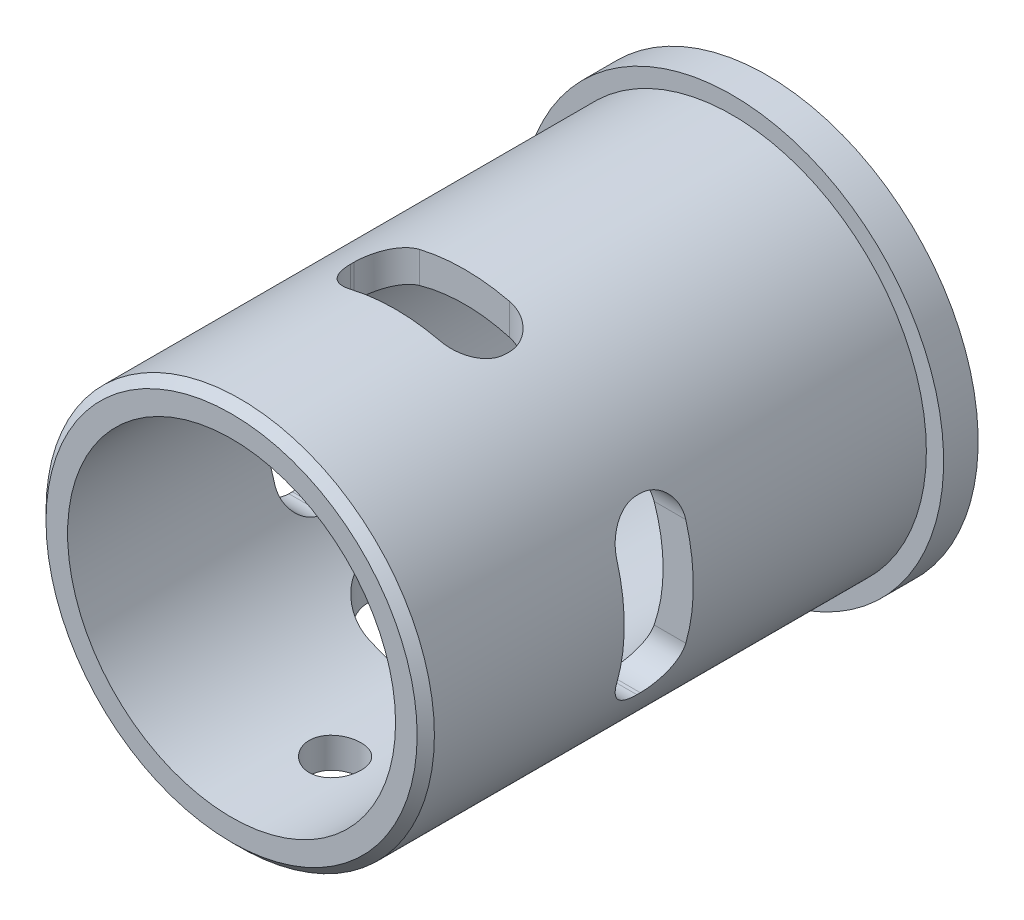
ISO-10303-21;
HEADER;
FILE_DESCRIPTION(('STEP AP214'),'2;1');
FILE_NAME('part.step','',(''),(''),'','','');
FILE_SCHEMA(('AUTOMOTIVE_DESIGN { 1 0 10303 214 1 1 1 1 }'));
ENDSEC;
DATA;
#1=APPLICATION_CONTEXT('core data for automotive mechanical design processes');
#2=APPLICATION_PROTOCOL_DEFINITION('international standard','automotive_design',2000,#1);
#3=PRODUCT_CONTEXT('',#1,'mechanical');
#4=PRODUCT('Part','Part','',(#3));
#5=PRODUCT_RELATED_PRODUCT_CATEGORY('part','',(#4));
#6=PRODUCT_DEFINITION_FORMATION('','',#4);
#7=PRODUCT_DEFINITION_CONTEXT('part definition',#1,'design');
#8=PRODUCT_DEFINITION('design','',#6,#7);
#9=PRODUCT_DEFINITION_SHAPE('','',#8);
#10=(LENGTH_UNIT() NAMED_UNIT(*) SI_UNIT(.MILLI.,.METRE.));
#11=(NAMED_UNIT(*) PLANE_ANGLE_UNIT() SI_UNIT($,.RADIAN.));
#12=(NAMED_UNIT(*) SI_UNIT($,.STERADIAN.) SOLID_ANGLE_UNIT());
#13=UNCERTAINTY_MEASURE_WITH_UNIT(LENGTH_MEASURE(1.E-05),#10,'distance_accuracy_value','');
#14=(GEOMETRIC_REPRESENTATION_CONTEXT(3) GLOBAL_UNCERTAINTY_ASSIGNED_CONTEXT((#13)) GLOBAL_UNIT_ASSIGNED_CONTEXT((#10,
#11,#12)) REPRESENTATION_CONTEXT('',''));
#15=CARTESIAN_POINT('',(0.,0.,0.));
#16=DIRECTION('',(0.,0.,1.));
#17=DIRECTION('',(1.,0.,0.));
#18=AXIS2_PLACEMENT_3D('',#15,#16,#17);
#19=CARTESIAN_POINT('',(0.,0.,31.));
#20=DIRECTION('',(0.,0.,-1.));
#21=DIRECTION('',(-1.,0.,0.));
#22=AXIS2_PLACEMENT_3D('',#19,#20,#21);
#23=CYLINDRICAL_SURFACE('',#22,11.25);
#24=CARTESIAN_POINT('',(0.,0.,2.));
#25=DIRECTION('',(0.,0.,-1.));
#26=DIRECTION('',(-1.,0.,0.));
#27=AXIS2_PLACEMENT_3D('',#24,#25,#26);
#28=CIRCLE('',#27,11.25);
#29=CARTESIAN_POINT('',(-11.25,0.,2.));
#30=VERTEX_POINT('',#29);
#31=EDGE_CURVE('E579',#30,#30,#28,.T.);
#32=ORIENTED_EDGE('',*,*,#31,.F.);
#33=EDGE_LOOP('',(#32));
#34=FACE_BOUND('',#33,.T.);
#35=CARTESIAN_POINT('',(0.,0.,30.5));
#36=DIRECTION('',(0.,0.,1.));
#37=DIRECTION('',(1.,0.,0.));
#38=AXIS2_PLACEMENT_3D('',#35,#36,#37);
#39=CIRCLE('',#38,11.25);
#40=CARTESIAN_POINT('',(11.25,0.,30.5));
#41=VERTEX_POINT('',#40);
#42=EDGE_CURVE('E583',#41,#41,#39,.F.);
#43=ORIENTED_EDGE('',*,*,#42,.T.);
#44=EDGE_LOOP('',(#43));
#45=FACE_BOUND('',#44,.T.);
#46=CARTESIAN_POINT('',(0.,0.,14.));
#47=DIRECTION('',(0.,0.,-1.));
#48=DIRECTION('',(-1.,0.,0.));
#49=AXIS2_PLACEMENT_3D('',#46,#47,#48);
#50=CIRCLE('',#49,11.25);
#51=CARTESIAN_POINT('',(4.09999999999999,-10.476282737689,14.));
#52=VERTEX_POINT('',#51);
#53=CARTESIAN_POINT('',(-4.09999999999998,-10.476282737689,14.));
#54=VERTEX_POINT('',#53);
#55=EDGE_CURVE('E588',#52,#54,#50,.T.);
#56=ORIENTED_EDGE('',*,*,#55,.T.);
#57=CARTESIAN_POINT('',(-4.09999999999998,-10.476282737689,14.));
#58=CARTESIAN_POINT('',(-4.17409673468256,-10.4472928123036,13.9999966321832));
#59=CARTESIAN_POINT('',(-4.24786314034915,-10.4175087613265,14.0034310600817));
#60=CARTESIAN_POINT('',(-4.39419972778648,-10.3566277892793,14.0169684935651));
#61=CARTESIAN_POINT('',(-4.46677039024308,-10.325531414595,14.02706874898));
#62=CARTESIAN_POINT('',(-4.61010451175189,-10.2623373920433,14.0537056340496));
#63=CARTESIAN_POINT('',(-4.68087116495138,-10.2302417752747,14.0702299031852));
#64=CARTESIAN_POINT('',(-4.82028777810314,-10.1652964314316,14.1094902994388));
#65=CARTESIAN_POINT('',(-4.88893752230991,-10.1324466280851,14.1322270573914));
#66=CARTESIAN_POINT('',(-5.09090452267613,-10.0333227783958,14.2093752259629));
#67=CARTESIAN_POINT('',(-5.22056066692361,-9.96633164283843,14.272785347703));
#68=CARTESIAN_POINT('',(-5.46696385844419,-9.8333355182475,14.4220688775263));
#69=CARTESIAN_POINT('',(-5.58369463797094,-9.76733186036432,14.5079701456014));
#70=CARTESIAN_POINT('',(-5.80431156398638,-9.63790780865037,14.7036271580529));
#71=CARTESIAN_POINT('',(-5.90773330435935,-9.57461579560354,14.8139963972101));
#72=CARTESIAN_POINT('',(-6.09371801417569,-9.45733539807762,15.0553094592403));
#73=CARTESIAN_POINT('',(-6.17631722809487,-9.40333090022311,15.1862168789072));
#74=CARTESIAN_POINT('',(-6.29753345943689,-9.32241417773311,15.4283975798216));
#75=CARTESIAN_POINT('',(-6.34200535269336,-9.29211662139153,15.5356289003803));
#76=CARTESIAN_POINT('',(-6.41531842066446,-9.24165498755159,15.7574536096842));
#77=CARTESIAN_POINT('',(-6.4441953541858,-9.22146773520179,15.8720294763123));
#78=CARTESIAN_POINT('',(-6.47624948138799,-9.19896165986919,16.0562661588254));
#79=CARTESIAN_POINT('',(-6.48512855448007,-9.19269794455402,16.1245112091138));
#80=CARTESIAN_POINT('',(-6.49701317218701,-9.18429844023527,16.2618216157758));
#81=CARTESIAN_POINT('',(-6.50001348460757,-9.1821663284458,16.3308876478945));
#82=CARTESIAN_POINT('',(-6.5,-9.18218383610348,16.4));
#83=B_SPLINE_CURVE_WITH_KNOTS('',3,(#57,#58,#59,#60,#61,#62,#63,#64,#65,#66,#67,#68,#69,#70,#71,
#72,#73,#74,#75,#76,#77,#78,#79,#80,#81,#82),.UNSPECIFIED.,.F.,.F.,(4,2,2,2,2,2,2,2,2,2,2,2,4),
(0.,0.238591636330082,0.477084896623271,0.715121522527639,0.953182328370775,1.42824699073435,
1.90390292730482,2.39320082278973,2.88164105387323,3.24013512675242,3.59780365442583,
3.80477269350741,4.01192585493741),.UNSPECIFIED.);
#84=CARTESIAN_POINT('',(-6.5,-9.18218383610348,16.4));
#85=VERTEX_POINT('',#84);
#86=EDGE_CURVE('E765',#54,#85,#83,.T.);
#87=ORIENTED_EDGE('',*,*,#86,.T.);
#88=DIRECTION('',(0.,0.,-1.));
#89=VECTOR('',#88,1.);
#90=CARTESIAN_POINT('',(-6.5,-9.18218383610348,31.));
#91=LINE('',#90,#89);
#92=CARTESIAN_POINT('',(-6.5,-9.18218383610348,16.6));
#93=VERTEX_POINT('',#92);
#94=EDGE_CURVE('E817',#85,#93,#91,.F.);
#95=ORIENTED_EDGE('',*,*,#94,.T.);
#96=CARTESIAN_POINT('',(-4.1,-10.476282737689,19.));
#97=CARTESIAN_POINT('',(-3.96691367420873,-10.5283712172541,19.0000028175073));
#98=CARTESIAN_POINT('',(-3.83284800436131,-10.5778883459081,18.9889152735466));
#99=CARTESIAN_POINT('',(-3.56642727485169,-10.6706580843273,18.9438259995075));
#100=CARTESIAN_POINT('',(-3.43407116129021,-10.7139147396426,18.9098391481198));
#101=CARTESIAN_POINT('',(-3.17486431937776,-10.7935716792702,18.818793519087));
#102=CARTESIAN_POINT('',(-3.04803034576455,-10.8299520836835,18.7616693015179));
#103=CARTESIAN_POINT('',(-2.80477714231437,-10.8954856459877,18.6252970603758));
#104=CARTESIAN_POINT('',(-2.68835748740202,-10.9246390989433,18.5460499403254));
#105=CARTESIAN_POINT('',(-2.47530343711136,-10.9748272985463,18.3715683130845));
#106=CARTESIAN_POINT('',(-2.37800877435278,-10.9961717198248,18.2772279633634));
#107=CARTESIAN_POINT('',(-2.20026272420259,-11.0331140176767,18.0728645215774));
#108=CARTESIAN_POINT('',(-2.11980898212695,-11.0487126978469,17.9628436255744));
#109=CARTESIAN_POINT('',(-1.98014647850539,-11.074586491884,17.7330819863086));
#110=CARTESIAN_POINT('',(-1.92048300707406,-11.0849780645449,17.6136303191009));
#111=CARTESIAN_POINT('',(-1.82170947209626,-11.1016394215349,17.3662438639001));
#112=CARTESIAN_POINT('',(-1.78259891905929,-11.1079093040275,17.2383092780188));
#113=CARTESIAN_POINT('',(-1.72619620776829,-11.1168146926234,16.9778584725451));
#114=CARTESIAN_POINT('',(-1.70886198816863,-11.1194572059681,16.8453515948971));
#115=CARTESIAN_POINT('',(-1.69639669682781,-11.1213659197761,16.579271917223));
#116=CARTESIAN_POINT('',(-1.70126587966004,-11.1206320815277,16.4456991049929));
#117=CARTESIAN_POINT('',(-1.73308438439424,-11.1157173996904,16.1810796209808));
#118=CARTESIAN_POINT('',(-1.76006520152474,-11.111531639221,16.0500368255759));
#119=CARTESIAN_POINT('',(-1.83532234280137,-11.0993483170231,15.7944027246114));
#120=CARTESIAN_POINT('',(-1.88359834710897,-11.091350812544,15.669811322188));
#121=CARTESIAN_POINT('',(-1.99989273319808,-11.0709707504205,15.4307242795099));
#122=CARTESIAN_POINT('',(-2.06789514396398,-11.0585917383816,15.3162205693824));
#123=CARTESIAN_POINT('',(-2.22147858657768,-11.0287637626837,15.1004357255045));
#124=CARTESIAN_POINT('',(-2.30705865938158,-11.0113150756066,14.9991538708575));
#125=CARTESIAN_POINT('',(-2.49293094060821,-10.9707253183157,14.8126416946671));
#126=CARTESIAN_POINT('',(-2.59321218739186,-10.9475884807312,14.7273995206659));
#127=CARTESIAN_POINT('',(-2.80523545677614,-10.8951852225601,14.5749980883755));
#128=CARTESIAN_POINT('',(-2.91697748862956,-10.8659187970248,14.5078388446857));
#129=CARTESIAN_POINT('',(-3.14973910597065,-10.8007595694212,14.3922652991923));
#130=CARTESIAN_POINT('',(-3.27085429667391,-10.7647911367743,14.3440867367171));
#131=CARTESIAN_POINT('',(-3.5174351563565,-10.6867618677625,14.2682043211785));
#132=CARTESIAN_POINT('',(-3.64290160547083,-10.6446999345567,14.2405041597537));
#133=CARTESIAN_POINT('',(-3.90025821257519,-10.5531955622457,14.2046464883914));
#134=CARTESIAN_POINT('',(-4.03218811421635,-10.5035098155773,14.1974024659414));
#135=CARTESIAN_POINT('',(-4.29357901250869,-10.3993991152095,14.2042454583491));
#136=CARTESIAN_POINT('',(-4.42303925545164,-10.3449727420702,14.2183388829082));
#137=CARTESIAN_POINT('',(-4.68639340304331,-10.2285137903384,14.2685909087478));
#138=CARTESIAN_POINT('',(-4.81986302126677,-10.1662181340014,14.3063625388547));
#139=CARTESIAN_POINT('',(-5.07773707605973,-10.0399074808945,14.4038541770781));
#140=CARTESIAN_POINT('',(-5.20213501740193,-9.97589129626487,14.4635897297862));
#141=CARTESIAN_POINT('',(-5.44749945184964,-9.84418367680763,14.6085313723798));
#142=CARTESIAN_POINT('',(-5.56762168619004,-9.77654726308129,14.6952231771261));
#143=CARTESIAN_POINT('',(-5.79123097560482,-9.64577150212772,14.8906863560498));
#144=CARTESIAN_POINT('',(-5.89472861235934,-9.58262930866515,14.9994435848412));
#145=CARTESIAN_POINT('',(-6.06419380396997,-9.47608447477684,15.2153813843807));
#146=CARTESIAN_POINT('',(-6.13356277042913,-9.43118815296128,15.319162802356));
#147=CARTESIAN_POINT('',(-6.25640251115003,-9.35015259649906,15.5390022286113));
#148=CARTESIAN_POINT('',(-6.30988369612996,-9.31400763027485,15.6550521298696));
#149=CARTESIAN_POINT('',(-6.37635856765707,-9.26851008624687,15.8368331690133));
#150=CARTESIAN_POINT('',(-6.39628523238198,-9.25475465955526,15.8990157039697));
#151=CARTESIAN_POINT('',(-6.43111807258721,-9.23058343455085,16.0253908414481));
#152=CARTESIAN_POINT('',(-6.44602690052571,-9.22016587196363,16.0895823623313));
#153=CARTESIAN_POINT('',(-6.47055170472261,-9.20297167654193,16.2194146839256));
#154=CARTESIAN_POINT('',(-6.48017074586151,-9.19619293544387,16.2850546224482));
#155=CARTESIAN_POINT('',(-6.49394823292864,-9.18646837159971,16.4171623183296));
#156=CARTESIAN_POINT('',(-6.49810751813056,-9.1835219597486,16.4836299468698));
#157=CARTESIAN_POINT('',(-6.50185820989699,-9.18087103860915,16.6651187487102));
#158=CARTESIAN_POINT('',(-6.49594677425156,-9.1850690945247,16.7803820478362));
#159=CARTESIAN_POINT('',(-6.46787704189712,-9.20485401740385,17.0078208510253));
#160=CARTESIAN_POINT('',(-6.44571833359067,-9.2204411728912,17.1199962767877));
#161=CARTESIAN_POINT('',(-6.38716164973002,-9.26109537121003,17.3355637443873));
#162=CARTESIAN_POINT('',(-6.35113749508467,-9.28591300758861,17.4391060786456));
#163=CARTESIAN_POINT('',(-6.26638940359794,-9.34331174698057,17.6385137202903));
#164=CARTESIAN_POINT('',(-6.21766141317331,-9.37589532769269,17.7343765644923));
#165=CARTESIAN_POINT('',(-6.10232763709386,-9.45142341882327,17.9285210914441));
#166=CARTESIAN_POINT('',(-6.03425215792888,-9.49515249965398,18.0256209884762));
#167=CARTESIAN_POINT('',(-5.88607709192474,-9.58771286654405,18.2073891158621));
#168=CARTESIAN_POINT('',(-5.80597103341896,-9.63654689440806,18.2920506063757));
#169=CARTESIAN_POINT('',(-5.62110348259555,-9.74571910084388,18.4613091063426));
#170=CARTESIAN_POINT('',(-5.51446110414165,-9.80661100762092,18.5435018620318));
#171=CARTESIAN_POINT('',(-5.28948871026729,-9.92976830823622,18.6887984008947));
#172=CARTESIAN_POINT('',(-5.17114664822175,-9.99203506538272,18.7518822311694));
#173=CARTESIAN_POINT('',(-4.90039176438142,-10.1279761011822,18.8683055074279));
#174=CARTESIAN_POINT('',(-4.74590669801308,-10.2014328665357,18.9171511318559));
#175=CARTESIAN_POINT('',(-4.42811106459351,-10.3433328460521,18.9829860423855));
#176=CARTESIAN_POINT('',(-4.26480644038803,-10.4117793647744,18.9999965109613));
#177=CARTESIAN_POINT('',(-4.1,-10.476282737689,19.));
#178=B_SPLINE_CURVE_WITH_KNOTS('',3,(#96,#97,#98,#99,#100,#101,#102,#103,#104,#105,#106,#107,
#108,#109,#110,#111,#112,#113,#114,#115,#116,#117,#118,#119,#120,#121,#122,#123,#124,#125,#126,
#127,#128,#129,#130,#131,#132,#133,#134,#135,#136,#137,#138,#139,#140,#141,#142,#143,#144,#145,
#146,#147,#148,#149,#150,#151,#152,#153,#154,#155,#156,#157,#158,#159,#160,#161,#162,#163,#164,
#165,#166,#167,#168,#169,#170,#171,#172,#173,#174,#175,#176,#177),.UNSPECIFIED.,.T.,.F.,(4,2,2,
2,2,2,2,2,2,2,2,2,2,2,2,2,2,2,2,2,2,2,2,2,2,2,2,2,2,2,2,2,2,2,2,2,2,2,2,2,4),(0.,
0.428207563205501,0.856137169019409,1.28528564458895,1.71441659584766,2.12397271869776,
2.5334715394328,2.93334987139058,3.33321867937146,3.73231394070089,4.1314137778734,
4.53108307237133,4.93074636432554,5.3300869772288,5.72940580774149,6.12842839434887,
6.52745130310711,6.93128461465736,7.3351907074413,7.75686836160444,8.17867271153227,
8.63290448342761,9.08745835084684,9.57371104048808,10.059652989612,10.456091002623,
10.8522686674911,11.0522080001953,11.252041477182,11.4517590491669,11.65144591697,
11.9959981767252,12.3405591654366,12.6764165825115,13.0123812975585,13.3901271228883,
13.7680768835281,14.2095743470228,14.651531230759,15.1821520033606,15.7124195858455),.UNSPECIFIED.);
#179=CARTESIAN_POINT('',(-4.09999999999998,-10.476282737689,19.));
#180=VERTEX_POINT('',#179);
#181=EDGE_CURVE('E831',#93,#180,#178,.T.);
#182=ORIENTED_EDGE('',*,*,#181,.T.);
#183=CARTESIAN_POINT('',(0.,0.,19.));
#184=DIRECTION('',(0.,0.,1.));
#185=DIRECTION('',(1.,0.,0.));
#186=AXIS2_PLACEMENT_3D('',#183,#184,#185);
#187=CIRCLE('',#186,11.25);
#188=CARTESIAN_POINT('',(4.09999999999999,-10.476282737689,19.));
#189=VERTEX_POINT('',#188);
#190=EDGE_CURVE('E837',#180,#189,#187,.T.);
#191=ORIENTED_EDGE('',*,*,#190,.T.);
#192=CARTESIAN_POINT('',(4.1,-10.476282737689,19.));
#193=CARTESIAN_POINT('',(4.24787948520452,-10.4184047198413,18.9999963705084));
#194=CARTESIAN_POINT('',(4.39456774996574,-10.3573519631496,18.9863027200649));
#195=CARTESIAN_POINT('',(4.68131229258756,-10.2309554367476,18.9331076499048));
#196=CARTESIAN_POINT('',(4.82136219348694,-10.1656076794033,18.8935819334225));
#197=CARTESIAN_POINT('',(5.0910355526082,-10.0332628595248,18.7905784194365));
#198=CARTESIAN_POINT('',(5.22068304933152,-9.96627009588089,18.7271578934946));
#199=CARTESIAN_POINT('',(5.4670339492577,-9.83329316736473,18.5778712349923));
#200=CARTESIAN_POINT('',(5.58373130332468,-9.7673094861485,18.4919946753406));
#201=CARTESIAN_POINT('',(5.80431570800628,-9.63790626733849,18.2963719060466));
#202=CARTESIAN_POINT('',(5.90773183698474,-9.5746170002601,18.1860044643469));
#203=CARTESIAN_POINT('',(6.09371389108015,-9.45733771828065,17.9446969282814));
#204=CARTESIAN_POINT('',(6.17631543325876,-9.4033318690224,17.8137926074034));
#205=CARTESIAN_POINT('',(6.29749981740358,-9.32243680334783,17.5716653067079));
#206=CARTESIAN_POINT('',(6.34194709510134,-9.29215669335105,17.4644965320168));
#207=CARTESIAN_POINT('',(6.41527848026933,-9.24168250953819,17.2427178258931));
#208=CARTESIAN_POINT('',(6.44417765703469,-9.22147867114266,17.1281152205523));
#209=CARTESIAN_POINT('',(6.48491854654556,-9.19287636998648,16.8938636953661));
#210=CARTESIAN_POINT('',(6.49667882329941,-9.18453427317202,16.7741934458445));
#211=CARTESIAN_POINT('',(6.50209642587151,-9.18070032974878,16.534232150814));
#212=CARTESIAN_POINT('',(6.49575577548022,-9.18520704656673,16.4139411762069));
#213=CARTESIAN_POINT('',(6.46657956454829,-9.2057654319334,16.1858575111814));
#214=CARTESIAN_POINT('',(6.44503806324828,-9.22091097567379,16.0778110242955));
#215=CARTESIAN_POINT('',(6.38801644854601,-9.26050433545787,15.8672762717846));
#216=CARTESIAN_POINT('',(6.35253323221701,-9.28495422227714,15.7647892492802));
#217=CARTESIAN_POINT('',(6.26661136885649,-9.34317496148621,15.5613903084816));
#218=CARTESIAN_POINT('',(6.21540346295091,-9.37741685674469,15.460941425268));
#219=CARTESIAN_POINT('',(6.10082223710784,-9.45236233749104,15.2699117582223));
#220=CARTESIAN_POINT('',(6.03744314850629,-9.4930689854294,15.1793356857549));
#221=CARTESIAN_POINT('',(5.8890982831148,-9.58591874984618,14.9952390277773));
#222=CARTESIAN_POINT('',(5.80229991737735,-9.63884800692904,14.9035917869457));
#223=CARTESIAN_POINT('',(5.61671266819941,-9.74816186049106,14.7357961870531));
#224=CARTESIAN_POINT('',(5.5179157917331,-9.80454874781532,14.6596582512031));
#225=CARTESIAN_POINT('',(5.29497074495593,-9.92694325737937,14.5137857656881));
#226=CARTESIAN_POINT('',(5.16923040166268,-9.99314748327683,14.4466343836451));
#227=CARTESIAN_POINT('',(4.90729821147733,-10.1243466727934,14.3353750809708));
#228=CARTESIAN_POINT('',(4.77110251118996,-10.1893411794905,14.291275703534));
#229=CARTESIAN_POINT('',(4.48570978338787,-10.3182540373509,14.226504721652));
#230=CARTESIAN_POINT('',(4.33620968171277,-10.3820224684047,14.2068531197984));
#231=CARTESIAN_POINT('',(4.03364966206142,-10.5032703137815,14.1961532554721));
#232=CARTESIAN_POINT('',(3.8805912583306,-10.5607523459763,14.2050930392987));
#233=CARTESIAN_POINT('',(3.58569936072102,-10.6643413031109,14.2513048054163));
#234=CARTESIAN_POINT('',(3.44375762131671,-10.7109321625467,14.2867883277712));
#235=CARTESIAN_POINT('',(3.16664361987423,-10.7961037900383,14.3840643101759));
#236=CARTESIAN_POINT('',(3.03146771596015,-10.8346889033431,14.4458424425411));
#237=CARTESIAN_POINT('',(2.78383790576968,-10.9008195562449,14.5884192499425));
#238=CARTESIAN_POINT('',(2.67043032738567,-10.9290066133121,14.6672690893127));
#239=CARTESIAN_POINT('',(2.45802975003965,-10.9787294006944,14.8441481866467));
#240=CARTESIAN_POINT('',(2.35903319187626,-11.0002667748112,14.9421726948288));
#241=CARTESIAN_POINT('',(2.18292071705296,-11.0365357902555,15.149977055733));
#242=CARTESIAN_POINT('',(2.10505006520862,-11.0515191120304,15.2590748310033));
#243=CARTESIAN_POINT('',(1.9683711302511,-11.0766809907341,15.489120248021));
#244=CARTESIAN_POINT('',(1.90956156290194,-11.0868598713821,15.610067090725));
#245=CARTESIAN_POINT('',(1.81333483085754,-11.1030036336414,15.8591687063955));
#246=CARTESIAN_POINT('',(1.77572694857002,-11.1090062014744,15.9872474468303));
#247=CARTESIAN_POINT('',(1.72222984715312,-11.1174262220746,16.2479781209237));
#248=CARTESIAN_POINT('',(1.70634075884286,-11.1198436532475,16.3806300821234));
#249=CARTESIAN_POINT('',(1.69675819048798,-11.1213100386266,16.6469160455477));
#250=CARTESIAN_POINT('',(1.70309217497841,-11.1203548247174,16.7805510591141));
#251=CARTESIAN_POINT('',(1.73782481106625,-11.1149794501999,17.0448519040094));
#252=CARTESIAN_POINT('',(1.76622348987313,-11.1105592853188,17.1755177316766));
#253=CARTESIAN_POINT('',(1.84423242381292,-11.0978762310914,17.4302152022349));
#254=CARTESIAN_POINT('',(1.89385058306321,-11.0896119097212,17.5542443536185));
#255=CARTESIAN_POINT('',(2.01274737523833,-11.0686482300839,17.7920778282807));
#256=CARTESIAN_POINT('',(2.08202510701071,-11.0559490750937,17.9058826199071));
#257=CARTESIAN_POINT('',(2.23789331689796,-11.0254527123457,18.1198857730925));
#258=CARTESIAN_POINT('',(2.3244557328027,-11.007663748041,18.2201057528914));
#259=CARTESIAN_POINT('',(2.51213430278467,-10.9663526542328,18.4044341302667));
#260=CARTESIAN_POINT('',(2.61325060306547,-10.9428304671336,18.4885423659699));
#261=CARTESIAN_POINT('',(2.82712315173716,-10.8895384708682,18.6388566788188));
#262=CARTESIAN_POINT('',(2.93992247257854,-10.8597450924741,18.7049930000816));
#263=CARTESIAN_POINT('',(3.17318689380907,-10.7938895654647,18.8176089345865));
#264=CARTESIAN_POINT('',(3.29365043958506,-10.7578286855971,18.8640925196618));
#265=CARTESIAN_POINT('',(3.52840003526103,-10.6830141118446,18.933881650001));
#266=CARTESIAN_POINT('',(3.64236520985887,-10.6447346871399,18.9587949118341));
#267=CARTESIAN_POINT('',(3.87112309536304,-10.5636950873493,18.9918578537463));
#268=CARTESIAN_POINT('',(3.98591603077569,-10.5209336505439,19.0000028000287));
#269=CARTESIAN_POINT('',(4.1,-10.476282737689,19.));
#270=B_SPLINE_CURVE_WITH_KNOTS('',3,(#192,#193,#194,#195,#196,#197,#198,#199,#200,#201,#202,
#203,#204,#205,#206,#207,#208,#209,#210,#211,#212,#213,#214,#215,#216,#217,#218,#219,#220,#221,
#222,#223,#224,#225,#226,#227,#228,#229,#230,#231,#232,#233,#234,#235,#236,#237,#238,#239,#240,
#241,#242,#243,#244,#245,#246,#247,#248,#249,#250,#251,#252,#253,#254,#255,#256,#257,#258,#259,
#260,#261,#262,#263,#264,#265,#266,#267,#268,#269),.UNSPECIFIED.,.T.,.F.,(4,2,2,2,2,2,2,2,2,2,2,
2,2,2,2,2,2,2,2,2,2,2,2,2,2,2,2,2,2,2,2,2,2,2,2,2,2,2,4),(0.,0.475936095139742,
0.952320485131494,1.4275702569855,1.90304109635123,2.39233167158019,2.88077921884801,
3.23903440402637,3.59694173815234,3.95654419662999,4.31610645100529,4.64826325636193,
4.98049402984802,5.33264848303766,5.68497025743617,6.09401031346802,6.50332436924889,
6.97275930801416,7.44236809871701,7.93097593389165,8.41937951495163,8.87754356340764,
9.33545828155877,9.75623703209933,10.1769116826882,10.5795943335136,10.9822498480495,
11.3812230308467,11.7801986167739,12.1796674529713,12.5791367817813,12.9787550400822,
13.3783549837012,13.7773113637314,14.1762717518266,14.5767592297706,14.9771657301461,
15.3442305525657,15.7113989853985),.UNSPECIFIED.);
#271=CARTESIAN_POINT('',(6.5,-9.18218383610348,16.6));
#272=VERTEX_POINT('',#271);
#273=EDGE_CURVE('E852',#189,#272,#270,.T.);
#274=ORIENTED_EDGE('',*,*,#273,.T.);
#275=DIRECTION('',(0.,0.,-1.));
#276=VECTOR('',#275,1.);
#277=CARTESIAN_POINT('',(6.5,-9.18218383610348,31.));
#278=LINE('',#277,#276);
#279=CARTESIAN_POINT('',(6.5,-9.18218383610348,16.4));
#280=VERTEX_POINT('',#279);
#281=EDGE_CURVE('E858',#272,#280,#278,.T.);
#282=ORIENTED_EDGE('',*,*,#281,.T.);
#283=CARTESIAN_POINT('',(4.1,-10.476282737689,18.8));
#284=CARTESIAN_POINT('',(4.24787948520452,-10.4184047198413,18.7999963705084));
#285=CARTESIAN_POINT('',(4.39456774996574,-10.3573519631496,18.7863027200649));
#286=CARTESIAN_POINT('',(4.68131229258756,-10.2309554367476,18.7331076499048));
#287=CARTESIAN_POINT('',(4.82136219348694,-10.1656076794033,18.6935819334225));
#288=CARTESIAN_POINT('',(5.0910355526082,-10.0332628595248,18.5905784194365));
#289=CARTESIAN_POINT('',(5.22068304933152,-9.96627009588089,18.5271578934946));
#290=CARTESIAN_POINT('',(5.4670339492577,-9.83329316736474,18.3778712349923));
#291=CARTESIAN_POINT('',(5.58373130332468,-9.7673094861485,18.2919946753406));
#292=CARTESIAN_POINT('',(5.80431570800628,-9.63790626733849,18.0963719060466));
#293=CARTESIAN_POINT('',(5.90773183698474,-9.5746170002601,17.9860044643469));
#294=CARTESIAN_POINT('',(6.09371389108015,-9.45733771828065,17.7446969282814));
#295=CARTESIAN_POINT('',(6.17631543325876,-9.4033318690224,17.6137926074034));
#296=CARTESIAN_POINT('',(6.29749981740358,-9.32243680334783,17.3716653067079));
#297=CARTESIAN_POINT('',(6.34194709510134,-9.29215669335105,17.2644965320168));
#298=CARTESIAN_POINT('',(6.41527848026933,-9.24168250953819,17.0427178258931));
#299=CARTESIAN_POINT('',(6.4441776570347,-9.22147867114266,16.9281152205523));
#300=CARTESIAN_POINT('',(6.48491854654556,-9.19287636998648,16.6938636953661));
#301=CARTESIAN_POINT('',(6.49667882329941,-9.18453427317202,16.5741934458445));
#302=CARTESIAN_POINT('',(6.50209642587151,-9.18070032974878,16.334232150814));
#303=CARTESIAN_POINT('',(6.49575577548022,-9.18520704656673,16.2139411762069));
#304=CARTESIAN_POINT('',(6.46657956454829,-9.2057654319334,15.9858575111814));
#305=CARTESIAN_POINT('',(6.44503806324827,-9.2209109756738,15.8778110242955));
#306=CARTESIAN_POINT('',(6.388016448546,-9.26050433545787,15.6672762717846));
#307=CARTESIAN_POINT('',(6.35253323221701,-9.28495422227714,15.5647892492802));
#308=CARTESIAN_POINT('',(6.26661136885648,-9.34317496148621,15.3613903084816));
#309=CARTESIAN_POINT('',(6.21540346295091,-9.3774168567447,15.260941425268));
#310=CARTESIAN_POINT('',(6.10082223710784,-9.45236233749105,15.0699117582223));
#311=CARTESIAN_POINT('',(6.03744314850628,-9.4930689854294,14.9793356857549));
#312=CARTESIAN_POINT('',(5.8890982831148,-9.58591874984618,14.7952390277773));
#313=CARTESIAN_POINT('',(5.80229991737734,-9.63884800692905,14.7035917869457));
#314=CARTESIAN_POINT('',(5.6167126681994,-9.74816186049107,14.5357961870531));
#315=CARTESIAN_POINT('',(5.51791579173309,-9.80454874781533,14.4596582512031));
#316=CARTESIAN_POINT('',(5.29497074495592,-9.92694325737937,14.3137857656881));
#317=CARTESIAN_POINT('',(5.16923040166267,-9.99314748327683,14.246634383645));
#318=CARTESIAN_POINT('',(4.90729821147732,-10.1243466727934,14.1353750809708));
#319=CARTESIAN_POINT('',(4.77110251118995,-10.1893411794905,14.091275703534));
#320=CARTESIAN_POINT('',(4.48570978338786,-10.3182540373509,14.026504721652));
#321=CARTESIAN_POINT('',(4.33620968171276,-10.3820224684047,14.0068531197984));
#322=CARTESIAN_POINT('',(4.03364966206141,-10.5032703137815,13.9961532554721));
#323=CARTESIAN_POINT('',(3.88059125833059,-10.5607523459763,14.0050930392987));
#324=CARTESIAN_POINT('',(3.58569936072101,-10.6643413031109,14.0513048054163));
#325=CARTESIAN_POINT('',(3.4437576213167,-10.7109321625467,14.0867883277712));
#326=CARTESIAN_POINT('',(3.16664361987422,-10.7961037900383,14.1840643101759));
#327=CARTESIAN_POINT('',(3.03146771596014,-10.8346889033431,14.2458424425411));
#328=CARTESIAN_POINT('',(2.78383790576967,-10.9008195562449,14.3884192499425));
#329=CARTESIAN_POINT('',(2.67043032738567,-10.9290066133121,14.4672690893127));
#330=CARTESIAN_POINT('',(2.45802975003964,-10.9787294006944,14.6441481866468));
#331=CARTESIAN_POINT('',(2.35903319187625,-11.0002667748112,14.7421726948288));
#332=CARTESIAN_POINT('',(2.18292071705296,-11.0365357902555,14.949977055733));
#333=CARTESIAN_POINT('',(2.10505006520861,-11.0515191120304,15.0590748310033));
#334=CARTESIAN_POINT('',(1.9683711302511,-11.0766809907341,15.289120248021));
#335=CARTESIAN_POINT('',(1.90956156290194,-11.0868598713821,15.410067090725));
#336=CARTESIAN_POINT('',(1.81333483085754,-11.1030036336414,15.6591687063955));
#337=CARTESIAN_POINT('',(1.77572694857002,-11.1090062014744,15.7872474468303));
#338=CARTESIAN_POINT('',(1.72222984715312,-11.1174262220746,16.0479781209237));
#339=CARTESIAN_POINT('',(1.70634075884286,-11.1198436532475,16.1806300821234));
#340=CARTESIAN_POINT('',(1.69675819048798,-11.1213100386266,16.4469160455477));
#341=CARTESIAN_POINT('',(1.70309217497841,-11.1203548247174,16.5805510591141));
#342=CARTESIAN_POINT('',(1.73782481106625,-11.1149794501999,16.8448519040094));
#343=CARTESIAN_POINT('',(1.76622348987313,-11.1105592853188,16.9755177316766));
#344=CARTESIAN_POINT('',(1.84423242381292,-11.0978762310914,17.2302152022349));
#345=CARTESIAN_POINT('',(1.89385058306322,-11.0896119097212,17.3542443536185));
#346=CARTESIAN_POINT('',(2.01274737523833,-11.0686482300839,17.5920778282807));
#347=CARTESIAN_POINT('',(2.08202510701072,-11.0559490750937,17.7058826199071));
#348=CARTESIAN_POINT('',(2.23789331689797,-11.0254527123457,17.9198857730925));
#349=CARTESIAN_POINT('',(2.32445573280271,-11.007663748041,18.0201057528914));
#350=CARTESIAN_POINT('',(2.51213430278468,-10.9663526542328,18.2044341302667));
#351=CARTESIAN_POINT('',(2.61325060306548,-10.9428304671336,18.2885423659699));
#352=CARTESIAN_POINT('',(2.82712315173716,-10.8895384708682,18.4388566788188));
#353=CARTESIAN_POINT('',(2.93992247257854,-10.8597450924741,18.5049930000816));
#354=CARTESIAN_POINT('',(3.17318689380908,-10.7938895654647,18.6176089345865));
#355=CARTESIAN_POINT('',(3.29365043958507,-10.7578286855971,18.6640925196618));
#356=CARTESIAN_POINT('',(3.52840003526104,-10.6830141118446,18.7338816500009));
#357=CARTESIAN_POINT('',(3.64236520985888,-10.6447346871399,18.7587949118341));
#358=CARTESIAN_POINT('',(3.87112309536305,-10.5636950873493,18.7918578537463));
#359=CARTESIAN_POINT('',(3.9859160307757,-10.5209336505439,18.8000028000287));
#360=CARTESIAN_POINT('',(4.1,-10.476282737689,18.8));
#361=B_SPLINE_CURVE_WITH_KNOTS('',3,(#283,#284,#285,#286,#287,#288,#289,#290,#291,#292,#293,
#294,#295,#296,#297,#298,#299,#300,#301,#302,#303,#304,#305,#306,#307,#308,#309,#310,#311,#312,
#313,#314,#315,#316,#317,#318,#319,#320,#321,#322,#323,#324,#325,#326,#327,#328,#329,#330,#331,
#332,#333,#334,#335,#336,#337,#338,#339,#340,#341,#342,#343,#344,#345,#346,#347,#348,#349,#350,
#351,#352,#353,#354,#355,#356,#357,#358,#359,#360),.UNSPECIFIED.,.T.,.F.,(4,2,2,2,2,2,2,2,2,2,2,
2,2,2,2,2,2,2,2,2,2,2,2,2,2,2,2,2,2,2,2,2,2,2,2,2,2,2,4),(0.,0.475936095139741,
0.952320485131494,1.42757025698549,1.90304109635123,2.39233167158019,2.88077921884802,
3.23903440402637,3.59694173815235,3.95654419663,4.3161064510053,4.64826325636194,
4.98049402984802,5.33264848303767,5.68497025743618,6.09401031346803,6.5033243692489,
6.97275930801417,7.44236809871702,7.93097593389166,8.41937951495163,8.87754356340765,
9.33545828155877,9.75623703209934,10.1769116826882,10.5795943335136,10.9822498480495,
11.3812230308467,11.7801986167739,12.1796674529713,12.5791367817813,12.9787550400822,
13.3783549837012,13.7773113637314,14.1762717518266,14.5767592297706,14.9771657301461,
15.3442305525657,15.7113989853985),.UNSPECIFIED.);
#362=EDGE_CURVE('E860',#280,#52,#361,.T.);
#363=ORIENTED_EDGE('',*,*,#362,.T.);
#364=EDGE_LOOP('',(#56,#87,#95,#182,#191,#274,#282,#363));
#365=FACE_BOUND('',#364,.T.);
#366=CARTESIAN_POINT('',(0.,-11.25,26.5));
#367=CARTESIAN_POINT('',(0.083856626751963,-11.2499987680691,26.4999964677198));
#368=CARTESIAN_POINT('',(0.167764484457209,-11.2490525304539,26.4929443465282));
#369=CARTESIAN_POINT('',(0.333242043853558,-11.2453688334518,26.4649252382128));
#370=CARTESIAN_POINT('',(0.414809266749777,-11.2426295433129,26.4439440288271));
#371=CARTESIAN_POINT('',(0.573186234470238,-11.235668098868,26.3886987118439));
#372=CARTESIAN_POINT('',(0.64999926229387,-11.2314469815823,26.3544438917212));
#373=CARTESIAN_POINT('',(0.796772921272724,-11.2219903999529,26.2736448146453));
#374=CARTESIAN_POINT('',(0.866734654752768,-11.2167550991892,26.2271025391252));
#375=CARTESIAN_POINT('',(0.998269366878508,-11.2058174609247,26.1227400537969));
#376=CARTESIAN_POINT('',(1.0597934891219,-11.2001126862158,26.0648585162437));
#377=CARTESIAN_POINT('',(1.17228551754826,-11.1888985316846,25.9395923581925));
#378=CARTESIAN_POINT('',(1.22325286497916,-11.1833891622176,25.8722072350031));
#379=CARTESIAN_POINT('',(1.31336926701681,-11.1731657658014,25.7295256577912));
#380=CARTESIAN_POINT('',(1.35247205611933,-11.1684548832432,25.654199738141));
#381=CARTESIAN_POINT('',(1.41745383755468,-11.1603944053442,25.4979766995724));
#382=CARTESIAN_POINT('',(1.44333339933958,-11.1570447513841,25.417079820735));
#383=CARTESIAN_POINT('',(1.4809845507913,-11.152109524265,25.2525206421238));
#384=CARTESIAN_POINT('',(1.4928390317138,-11.150513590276,25.1688776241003));
#385=CARTESIAN_POINT('',(1.50236010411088,-11.1492348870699,25.0007753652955));
#386=CARTESIAN_POINT('',(1.50002734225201,-11.149552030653,24.9163161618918));
#387=CARTESIAN_POINT('',(1.48130809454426,-11.1520541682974,24.7495591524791));
#388=CARTESIAN_POINT('',(1.46501323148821,-11.1542269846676,24.6672508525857));
#389=CARTESIAN_POINT('',(1.41897543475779,-11.1601766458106,24.5065473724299));
#390=CARTESIAN_POINT('',(1.38923219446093,-11.163953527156,24.4281522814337));
#391=CARTESIAN_POINT('',(1.31704446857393,-11.1726994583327,24.2772177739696));
#392=CARTESIAN_POINT('',(1.27456048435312,-11.1776722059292,24.2046974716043));
#393=CARTESIAN_POINT('',(1.17812545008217,-11.1882467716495,24.0677806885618));
#394=CARTESIAN_POINT('',(1.12417380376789,-11.1938486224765,24.0033846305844));
#395=CARTESIAN_POINT('',(1.00582867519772,-11.2051042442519,23.8840127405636));
#396=CARTESIAN_POINT('',(0.941356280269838,-11.210758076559,23.8291151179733));
#397=CARTESIAN_POINT('',(0.804070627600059,-11.221439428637,23.7309084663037));
#398=CARTESIAN_POINT('',(0.73125734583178,-11.2264669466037,23.6875994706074));
#399=CARTESIAN_POINT('',(0.579294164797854,-11.2353329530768,23.6137981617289));
#400=CARTESIAN_POINT('',(0.500141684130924,-11.2391709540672,23.5833111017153));
#401=CARTESIAN_POINT('',(0.337778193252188,-11.2452211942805,23.5360830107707));
#402=CARTESIAN_POINT('',(0.254567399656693,-11.2474335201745,23.5193412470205));
#403=CARTESIAN_POINT('',(0.0871251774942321,-11.2499718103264,23.5001811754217));
#404=CARTESIAN_POINT('',(0.00290627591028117,-11.2503119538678,23.4976551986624));
#405=CARTESIAN_POINT('',(-0.164753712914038,-11.2491059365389,23.5067137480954));
#406=CARTESIAN_POINT('',(-0.248194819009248,-11.2475598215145,23.5182979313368));
#407=CARTESIAN_POINT('',(-0.411610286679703,-11.2427638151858,23.555158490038));
#408=CARTESIAN_POINT('',(-0.491596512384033,-11.2395203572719,23.5803831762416));
#409=CARTESIAN_POINT('',(-0.64620382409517,-11.2316925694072,23.6437547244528));
#410=CARTESIAN_POINT('',(-0.720824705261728,-11.2271081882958,23.6819020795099));
#411=CARTESIAN_POINT('',(-0.863061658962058,-11.2170737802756,23.7702941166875));
#412=CARTESIAN_POINT('',(-0.930634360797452,-11.2116188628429,23.820608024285));
#413=CARTESIAN_POINT('',(-1.05641471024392,-11.2004679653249,23.9318074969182));
#414=CARTESIAN_POINT('',(-1.11462193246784,-11.1947719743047,23.9926935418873));
#415=CARTESIAN_POINT('',(-1.22040412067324,-11.1837367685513,24.1237848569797));
#416=CARTESIAN_POINT('',(-1.26790745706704,-11.1784001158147,24.1940481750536));
#417=CARTESIAN_POINT('',(-1.3504376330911,-11.1687309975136,24.3416195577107));
#418=CARTESIAN_POINT('',(-1.3854647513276,-11.1643985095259,24.4189274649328));
#419=CARTESIAN_POINT('',(-1.4419337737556,-11.1572460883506,24.5781679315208));
#420=CARTESIAN_POINT('',(-1.46341521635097,-11.1544217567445,24.6600862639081));
#421=CARTESIAN_POINT('',(-1.49231000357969,-11.1505931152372,24.8264077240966));
#422=CARTESIAN_POINT('',(-1.49972410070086,-11.1495887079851,24.9108107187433));
#423=CARTESIAN_POINT('',(-1.50025864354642,-11.1495167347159,25.0789926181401));
#424=CARTESIAN_POINT('',(-1.49349164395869,-11.1504339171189,25.1627711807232));
#425=CARTESIAN_POINT('',(-1.46609532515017,-11.1540688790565,25.3279884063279));
#426=CARTESIAN_POINT('',(-1.44546601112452,-11.1567866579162,25.4094270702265));
#427=CARTESIAN_POINT('',(-1.39096732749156,-11.1637116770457,25.5676327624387));
#428=CARTESIAN_POINT('',(-1.35710415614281,-11.1679182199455,25.6444019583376));
#429=CARTESIAN_POINT('',(-1.27711007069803,-11.1773478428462,25.7911869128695));
#430=CARTESIAN_POINT('',(-1.23097891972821,-11.1825709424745,25.861202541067));
#431=CARTESIAN_POINT('',(-1.12734336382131,-11.193494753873,25.9930672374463));
#432=CARTESIAN_POINT('',(-1.06975520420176,-11.1991987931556,26.0548502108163));
#433=CARTESIAN_POINT('',(-0.945016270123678,-11.2104128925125,26.1679174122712));
#434=CARTESIAN_POINT('',(-0.877863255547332,-11.2159229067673,26.2191991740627));
#435=CARTESIAN_POINT('',(-0.735564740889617,-11.2261547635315,26.3100003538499));
#436=CARTESIAN_POINT('',(-0.660385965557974,-11.2308730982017,26.3494679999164));
#437=CARTESIAN_POINT('',(-0.504444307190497,-11.2389549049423,26.4151604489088));
#438=CARTESIAN_POINT('',(-0.423687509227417,-11.2423198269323,26.4413994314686));
#439=CARTESIAN_POINT('',(-0.285441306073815,-11.2465179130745,26.4737110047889));
#440=CARTESIAN_POINT('',(-0.228818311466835,-11.2478172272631,26.4835549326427));
#441=CARTESIAN_POINT('',(-0.114804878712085,-11.2495586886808,26.4967006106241));
#442=CARTESIAN_POINT('',(-0.0574144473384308,-11.250000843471,26.5000024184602));
#443=CARTESIAN_POINT('',(0.,-11.25,26.5));
#444=B_SPLINE_CURVE_WITH_KNOTS('',3,(#366,#367,#368,#369,#370,#371,#372,#373,#374,#375,#376,
#377,#378,#379,#380,#381,#382,#383,#384,#385,#386,#387,#388,#389,#390,#391,#392,#393,#394,#395,
#396,#397,#398,#399,#400,#401,#402,#403,#404,#405,#406,#407,#408,#409,#410,#411,#412,#413,#414,
#415,#416,#417,#418,#419,#420,#421,#422,#423,#424,#425,#426,#427,#428,#429,#430,#431,#432,#433,
#434,#435,#436,#437,#438,#439,#440,#441,#442,#443),.UNSPECIFIED.,.T.,.F.,(4,2,2,2,2,2,2,2,2,2,2,
2,2,2,2,2,2,2,2,2,2,2,2,2,2,2,2,2,2,2,2,2,2,2,2,2,2,2,4),(0.,0.251360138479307,
0.502977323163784,0.754418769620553,1.00581969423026,1.25861983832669,1.51143335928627,
1.76522041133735,2.01899653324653,2.2712651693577,2.5235223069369,2.77413663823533,
3.02475668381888,3.27616187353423,3.52758013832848,3.78097908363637,4.03437875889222,
4.28788215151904,4.54137202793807,4.79293938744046,5.04450063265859,5.29511522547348,
5.5457393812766,5.79782456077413,6.04992118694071,6.30365778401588,6.55738871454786,
6.81037556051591,7.06334887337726,7.31432195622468,7.56529494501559,7.81615052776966,
8.06701095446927,8.3197775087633,8.5726033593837,8.82652145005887,9.08016678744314,
9.25226804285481,9.42436778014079),.UNSPECIFIED.);
#445=CARTESIAN_POINT('',(0.,-11.25,26.5));
#446=VERTEX_POINT('',#445);
#447=EDGE_CURVE('E592',#446,#446,#444,.T.);
#448=ORIENTED_EDGE('',*,*,#447,.T.);
#449=EDGE_LOOP('',(#448));
#450=FACE_BOUND('',#449,.T.);
#451=CARTESIAN_POINT('',(0.,0.,15.5));
#452=DIRECTION('',(0.,0.,-1.));
#453=DIRECTION('',(0.,1.,0.));
#454=AXIS2_PLACEMENT_3D('',#451,#452,#453);
#455=CIRCLE('',#454,11.25);
#456=CARTESIAN_POINT('',(-10.814457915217,-3.09999999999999,15.5));
#457=VERTEX_POINT('',#456);
#458=CARTESIAN_POINT('',(-10.814457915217,3.09999999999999,15.5));
#459=VERTEX_POINT('',#458);
#460=EDGE_CURVE('E338',#457,#459,#455,.T.);
#461=ORIENTED_EDGE('',*,*,#460,.T.);
#462=CARTESIAN_POINT('',(-10.814457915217,3.09999999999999,15.5));
#463=CARTESIAN_POINT('',(-10.798313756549,3.15632890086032,15.5000011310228));
#464=CARTESIAN_POINT('',(-10.7817331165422,3.2124982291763,15.5025059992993));
#465=CARTESIAN_POINT('',(-10.7478303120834,3.32415982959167,15.5124363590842));
#466=CARTESIAN_POINT('',(-10.730508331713,3.3796522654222,15.5198606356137));
#467=CARTESIAN_POINT('',(-10.6776865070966,3.54439669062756,15.5493444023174));
#468=CARTESIAN_POINT('',(-10.6412643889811,3.65214660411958,15.578615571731));
#469=CARTESIAN_POINT('',(-10.567466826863,3.86049076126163,15.655296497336));
#470=CARTESIAN_POINT('',(-10.5300918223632,3.96108822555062,15.7026980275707));
#471=CARTESIAN_POINT('',(-10.4559931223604,4.15274186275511,15.8144290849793));
#472=CARTESIAN_POINT('',(-10.4192696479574,4.24379484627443,15.8787642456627));
#473=CARTESIAN_POINT('',(-10.3479122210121,4.41496713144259,16.0239108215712));
#474=CARTESIAN_POINT('',(-10.3133122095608,4.49492641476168,16.1049283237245));
#475=CARTESIAN_POINT('',(-10.248930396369,4.63985212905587,16.2811381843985));
#476=CARTESIAN_POINT('',(-10.2191480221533,4.70482034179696,16.37632885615));
#477=CARTESIAN_POINT('',(-10.1680763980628,4.81416537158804,16.5731661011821));
#478=CARTESIAN_POINT('',(-10.1464265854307,4.859435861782,16.6742212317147));
#479=CARTESIAN_POINT('',(-10.1114065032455,4.93189695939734,16.8838734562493));
#480=CARTESIAN_POINT('',(-10.098018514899,4.95912626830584,16.9924538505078));
#481=CARTESIAN_POINT('',(-10.0855558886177,4.9843880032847,17.1518726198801));
#482=CARTESIAN_POINT('',(-10.0826613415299,4.99023708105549,17.2012935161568));
#483=CARTESIAN_POINT('',(-10.0787943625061,4.99804124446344,17.3004660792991));
#484=CARTESIAN_POINT('',(-10.077820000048,5.00000024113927,17.3502173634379));
#485=CARTESIAN_POINT('',(-10.0778221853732,5.,17.4));
#486=B_SPLINE_CURVE_WITH_KNOTS('',3,(#462,#463,#464,#465,#466,#467,#468,#469,#470,#471,#472,
#473,#474,#475,#476,#477,#478,#479,#480,#481,#482,#483,#484,#485),.UNSPECIFIED.,.F.,.F.,(4,2,2,
2,2,2,2,2,2,2,2,4),(0.,0.175672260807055,0.351301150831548,0.701847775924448,1.05223554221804,
1.40274002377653,1.75786666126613,2.1129510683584,2.44960713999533,2.78553866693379,
2.93492752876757,3.08416612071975),.UNSPECIFIED.);
#487=CARTESIAN_POINT('',(-10.0778221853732,5.,17.4));
#488=VERTEX_POINT('',#487);
#489=EDGE_CURVE('E342',#459,#488,#486,.T.);
#490=ORIENTED_EDGE('',*,*,#489,.T.);
#491=DIRECTION('',(0.,0.,-1.));
#492=VECTOR('',#491,1.);
#493=CARTESIAN_POINT('',(-10.0778221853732,5.,31.));
#494=LINE('',#493,#492);
#495=CARTESIAN_POINT('',(-10.0778221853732,5.,17.6));
#496=VERTEX_POINT('',#495);
#497=EDGE_CURVE('E605',#488,#496,#494,.F.);
#498=ORIENTED_EDGE('',*,*,#497,.T.);
#499=CARTESIAN_POINT('',(-10.0778221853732,5.,17.6));
#500=CARTESIAN_POINT('',(-10.0778153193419,5.00000787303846,17.6498971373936));
#501=CARTESIAN_POINT('',(-10.0787972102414,4.9980346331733,17.6997891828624));
#502=CARTESIAN_POINT('',(-10.0826866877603,4.99018678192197,17.7991732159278));
#503=CARTESIAN_POINT('',(-10.0855936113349,4.98431351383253,17.8486653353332));
#504=CARTESIAN_POINT('',(-10.0932658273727,4.96875796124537,17.9466955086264));
#505=CARTESIAN_POINT('',(-10.098023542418,4.95909120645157,17.9952366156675));
#506=CARTESIAN_POINT('',(-10.1092974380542,4.93606815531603,18.0912154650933));
#507=CARTESIAN_POINT('',(-10.1158137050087,4.92271167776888,18.138653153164));
#508=CARTESIAN_POINT('',(-10.1378123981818,4.87733541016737,18.2787368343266));
#509=CARTESIAN_POINT('',(-10.155759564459,4.83997939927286,18.3693352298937));
#510=CARTESIAN_POINT('',(-10.1970057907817,4.75246254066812,18.5427797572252));
#511=CARTESIAN_POINT('',(-10.2203093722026,4.7022908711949,18.625619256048));
#512=CARTESIAN_POINT('',(-10.2722322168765,4.58779784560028,18.7860262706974));
#513=CARTESIAN_POINT('',(-10.3010646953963,4.52287694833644,18.8630965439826));
#514=CARTESIAN_POINT('',(-10.3616093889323,4.38239675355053,19.0055162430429));
#515=CARTESIAN_POINT('',(-10.393322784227,4.30683308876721,19.0708608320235));
#516=CARTESIAN_POINT('',(-10.4611596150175,4.13950476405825,19.1941103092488));
#517=CARTESIAN_POINT('',(-10.4974211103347,4.04689044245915,19.2507881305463));
#518=CARTESIAN_POINT('',(-10.5699743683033,3.85341637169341,19.34758747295));
#519=CARTESIAN_POINT('',(-10.6062661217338,3.75255858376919,19.3877129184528));
#520=CARTESIAN_POINT('',(-10.6721407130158,3.56042168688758,19.4456786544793));
#521=CARTESIAN_POINT('',(-10.701921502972,3.46993428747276,19.4659383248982));
#522=CARTESIAN_POINT('',(-10.7597043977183,3.28644149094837,19.4931102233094));
#523=CARTESIAN_POINT('',(-10.7877066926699,3.19343636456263,19.5000238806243));
#524=CARTESIAN_POINT('',(-10.814457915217,3.09999999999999,19.5));
#525=B_SPLINE_CURVE_WITH_KNOTS('',3,(#499,#500,#501,#502,#503,#504,#505,#506,#507,#508,#509,
#510,#511,#512,#513,#514,#515,#516,#517,#518,#519,#520,#521,#522,#523,#524),.UNSPECIFIED.,.F.,
.F.,(4,2,2,2,2,2,2,2,2,2,2,2,4),(0.,0.149634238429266,0.299216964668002,0.448193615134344,
0.597177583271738,0.894598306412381,1.1922710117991,1.50540342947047,1.81866471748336,
2.16057734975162,2.50240887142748,2.79364654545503,3.08485302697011),.UNSPECIFIED.);
#526=CARTESIAN_POINT('',(-10.814457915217,3.09999999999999,19.5));
#527=VERTEX_POINT('',#526);
#528=EDGE_CURVE('E604',#496,#527,#525,.T.);
#529=ORIENTED_EDGE('',*,*,#528,.T.);
#530=CARTESIAN_POINT('',(0.,0.,19.5));
#531=DIRECTION('',(0.,0.,1.));
#532=DIRECTION('',(1.,0.,0.));
#533=AXIS2_PLACEMENT_3D('',#530,#531,#532);
#534=CIRCLE('',#533,11.25);
#535=CARTESIAN_POINT('',(-10.814457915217,-3.09999999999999,19.5));
#536=VERTEX_POINT('',#535);
#537=EDGE_CURVE('E652',#527,#536,#534,.T.);
#538=ORIENTED_EDGE('',*,*,#537,.T.);
#539=CARTESIAN_POINT('',(-10.814457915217,-3.09999999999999,19.5));
#540=CARTESIAN_POINT('',(-10.798313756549,-3.15632890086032,19.4999988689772));
#541=CARTESIAN_POINT('',(-10.7817331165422,-3.2124982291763,19.4974940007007));
#542=CARTESIAN_POINT('',(-10.7478303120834,-3.32415982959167,19.4875636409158));
#543=CARTESIAN_POINT('',(-10.730508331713,-3.3796522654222,19.4801393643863));
#544=CARTESIAN_POINT('',(-10.6776865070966,-3.54439669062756,19.4506555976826));
#545=CARTESIAN_POINT('',(-10.6412643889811,-3.65214660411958,19.421384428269));
#546=CARTESIAN_POINT('',(-10.567466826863,-3.86049076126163,19.344703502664));
#547=CARTESIAN_POINT('',(-10.5300918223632,-3.96108822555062,19.2973019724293));
#548=CARTESIAN_POINT('',(-10.4559931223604,-4.15274186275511,19.1855709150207));
#549=CARTESIAN_POINT('',(-10.4192696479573,-4.24379484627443,19.1212357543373));
#550=CARTESIAN_POINT('',(-10.3479122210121,-4.41496713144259,18.9760891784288));
#551=CARTESIAN_POINT('',(-10.3133122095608,-4.49492641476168,18.8950716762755));
#552=CARTESIAN_POINT('',(-10.248930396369,-4.63985212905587,18.7188618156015));
#553=CARTESIAN_POINT('',(-10.2191480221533,-4.70482034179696,18.62367114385));
#554=CARTESIAN_POINT('',(-10.1680763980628,-4.81416537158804,18.4268338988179));
#555=CARTESIAN_POINT('',(-10.1464265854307,-4.85943586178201,18.3257787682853));
#556=CARTESIAN_POINT('',(-10.1114065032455,-4.93189695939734,18.1161265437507));
#557=CARTESIAN_POINT('',(-10.098018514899,-4.95912626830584,18.0075461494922));
#558=CARTESIAN_POINT('',(-10.0855558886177,-4.9843880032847,17.8481273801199));
#559=CARTESIAN_POINT('',(-10.0826613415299,-4.99023708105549,17.7987064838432));
#560=CARTESIAN_POINT('',(-10.0787943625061,-4.99804124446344,17.6995339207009));
#561=CARTESIAN_POINT('',(-10.077820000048,-5.00000024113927,17.649782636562));
#562=CARTESIAN_POINT('',(-10.0778221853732,-5.,17.6));
#563=B_SPLINE_CURVE_WITH_KNOTS('',3,(#539,#540,#541,#542,#543,#544,#545,#546,#547,#548,#549,
#550,#551,#552,#553,#554,#555,#556,#557,#558,#559,#560,#561,#562),.UNSPECIFIED.,.F.,.F.,(4,2,2,
2,2,2,2,2,2,2,2,4),(0.,0.175672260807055,0.351301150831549,0.701847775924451,1.05223554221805,
1.40274002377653,1.75786666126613,2.1129510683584,2.44960713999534,2.7855386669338,
2.93492752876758,3.08416612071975),.UNSPECIFIED.);
#564=CARTESIAN_POINT('',(-10.0778221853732,-5.,17.6));
#565=VERTEX_POINT('',#564);
#566=EDGE_CURVE('E645',#536,#565,#563,.T.);
#567=ORIENTED_EDGE('',*,*,#566,.T.);
#568=DIRECTION('',(0.,0.,-1.));
#569=VECTOR('',#568,1.);
#570=CARTESIAN_POINT('',(-10.0778221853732,-5.,31.));
#571=LINE('',#570,#569);
#572=CARTESIAN_POINT('',(-10.0778221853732,-5.,17.4));
#573=VERTEX_POINT('',#572);
#574=EDGE_CURVE('E330',#565,#573,#571,.T.);
#575=ORIENTED_EDGE('',*,*,#574,.T.);
#576=CARTESIAN_POINT('',(-10.0778221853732,-5.,17.4));
#577=CARTESIAN_POINT('',(-10.0778153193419,-5.00000787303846,17.3501028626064));
#578=CARTESIAN_POINT('',(-10.0787972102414,-4.9980346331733,17.3002108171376));
#579=CARTESIAN_POINT('',(-10.0826866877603,-4.99018678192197,17.2008267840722));
#580=CARTESIAN_POINT('',(-10.0855936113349,-4.98431351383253,17.1513346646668));
#581=CARTESIAN_POINT('',(-10.0932658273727,-4.96875796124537,17.0533044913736));
#582=CARTESIAN_POINT('',(-10.098023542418,-4.95909120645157,17.0047633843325));
#583=CARTESIAN_POINT('',(-10.1092974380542,-4.93606815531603,16.9087845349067));
#584=CARTESIAN_POINT('',(-10.1158137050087,-4.92271167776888,16.8613468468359));
#585=CARTESIAN_POINT('',(-10.1378123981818,-4.87733541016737,16.7212631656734));
#586=CARTESIAN_POINT('',(-10.155759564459,-4.83997939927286,16.6306647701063));
#587=CARTESIAN_POINT('',(-10.1970057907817,-4.75246254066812,16.4572202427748));
#588=CARTESIAN_POINT('',(-10.2203093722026,-4.7022908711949,16.374380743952));
#589=CARTESIAN_POINT('',(-10.2722322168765,-4.58779784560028,16.2139737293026));
#590=CARTESIAN_POINT('',(-10.3010646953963,-4.52287694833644,16.1369034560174));
#591=CARTESIAN_POINT('',(-10.3616093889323,-4.38239675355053,15.9944837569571));
#592=CARTESIAN_POINT('',(-10.393322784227,-4.30683308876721,15.9291391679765));
#593=CARTESIAN_POINT('',(-10.4611596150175,-4.13950476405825,15.8058896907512));
#594=CARTESIAN_POINT('',(-10.4974211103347,-4.04689044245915,15.7492118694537));
#595=CARTESIAN_POINT('',(-10.5699743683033,-3.85341637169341,15.65241252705));
#596=CARTESIAN_POINT('',(-10.6062661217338,-3.75255858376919,15.6122870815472));
#597=CARTESIAN_POINT('',(-10.6721407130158,-3.56042168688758,15.5543213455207));
#598=CARTESIAN_POINT('',(-10.701921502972,-3.46993428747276,15.5340616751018));
#599=CARTESIAN_POINT('',(-10.7597043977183,-3.28644149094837,15.5068897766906));
#600=CARTESIAN_POINT('',(-10.7877066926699,-3.19343636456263,15.4999761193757));
#601=CARTESIAN_POINT('',(-10.814457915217,-3.09999999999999,15.5));
#602=B_SPLINE_CURVE_WITH_KNOTS('',3,(#576,#577,#578,#579,#580,#581,#582,#583,#584,#585,#586,
#587,#588,#589,#590,#591,#592,#593,#594,#595,#596,#597,#598,#599,#600,#601),.UNSPECIFIED.,.F.,
.F.,(4,2,2,2,2,2,2,2,2,2,2,2,4),(0.,0.14963423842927,0.299216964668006,0.448193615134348,
0.597177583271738,0.894598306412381,1.1922710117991,1.50540342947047,1.81866471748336,
2.16057734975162,2.50240887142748,2.79364654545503,3.08485302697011),.UNSPECIFIED.);
#603=EDGE_CURVE('E322',#573,#457,#602,.T.);
#604=ORIENTED_EDGE('',*,*,#603,.T.);
#605=EDGE_LOOP('',(#461,#490,#498,#529,#538,#567,#575,#604));
#606=FACE_BOUND('',#605,.T.);
#607=DIRECTION('',(0.,0.,-1.));
#608=VECTOR('',#607,1.);
#609=CARTESIAN_POINT('',(10.0778221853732,5.,31.));
#610=LINE('',#609,#608);
#611=CARTESIAN_POINT('',(10.0778221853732,5.,17.6));
#612=VERTEX_POINT('',#611);
#613=CARTESIAN_POINT('',(10.0778221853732,5.,17.4));
#614=VERTEX_POINT('',#613);
#615=EDGE_CURVE('E597',#612,#614,#610,.T.);
#616=ORIENTED_EDGE('',*,*,#615,.T.);
#617=CARTESIAN_POINT('',(10.0778221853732,5.,17.4));
#618=CARTESIAN_POINT('',(10.0778153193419,5.00000787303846,17.3501028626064));
#619=CARTESIAN_POINT('',(10.0787972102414,4.9980346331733,17.3002108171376));
#620=CARTESIAN_POINT('',(10.0826866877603,4.99018678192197,17.2008267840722));
#621=CARTESIAN_POINT('',(10.0855936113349,4.98431351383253,17.1513346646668));
#622=CARTESIAN_POINT('',(10.0932658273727,4.96875796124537,17.0533044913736));
#623=CARTESIAN_POINT('',(10.098023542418,4.95909120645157,17.0047633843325));
#624=CARTESIAN_POINT('',(10.1092974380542,4.93606815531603,16.9087845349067));
#625=CARTESIAN_POINT('',(10.1158137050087,4.92271167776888,16.8613468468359));
#626=CARTESIAN_POINT('',(10.1378123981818,4.87733541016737,16.7212631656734));
#627=CARTESIAN_POINT('',(10.155759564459,4.83997939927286,16.6306647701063));
#628=CARTESIAN_POINT('',(10.1970057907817,4.75246254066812,16.4572202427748));
#629=CARTESIAN_POINT('',(10.2203093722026,4.7022908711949,16.374380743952));
#630=CARTESIAN_POINT('',(10.2722322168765,4.58779784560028,16.2139737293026));
#631=CARTESIAN_POINT('',(10.3010646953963,4.52287694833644,16.1369034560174));
#632=CARTESIAN_POINT('',(10.3616093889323,4.38239675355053,15.9944837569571));
#633=CARTESIAN_POINT('',(10.393322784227,4.30683308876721,15.9291391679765));
#634=CARTESIAN_POINT('',(10.4611596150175,4.13950476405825,15.8058896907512));
#635=CARTESIAN_POINT('',(10.4974211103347,4.04689044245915,15.7492118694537));
#636=CARTESIAN_POINT('',(10.5699743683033,3.85341637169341,15.65241252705));
#637=CARTESIAN_POINT('',(10.6062661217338,3.75255858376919,15.6122870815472));
#638=CARTESIAN_POINT('',(10.6721407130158,3.56042168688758,15.5543213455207));
#639=CARTESIAN_POINT('',(10.701921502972,3.46993428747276,15.5340616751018));
#640=CARTESIAN_POINT('',(10.7597043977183,3.28644149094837,15.5068897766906));
#641=CARTESIAN_POINT('',(10.7877066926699,3.19343636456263,15.4999761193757));
#642=CARTESIAN_POINT('',(10.814457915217,3.09999999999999,15.5));
#643=B_SPLINE_CURVE_WITH_KNOTS('',3,(#617,#618,#619,#620,#621,#622,#623,#624,#625,#626,#627,
#628,#629,#630,#631,#632,#633,#634,#635,#636,#637,#638,#639,#640,#641,#642),.UNSPECIFIED.,.F.,
.F.,(4,2,2,2,2,2,2,2,2,2,2,2,4),(0.,0.149634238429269,0.299216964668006,0.448193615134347,
0.597177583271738,0.894598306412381,1.1922710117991,1.50540342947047,1.81866471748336,
2.16057734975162,2.50240887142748,2.79364654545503,3.08485302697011),.UNSPECIFIED.);
#644=CARTESIAN_POINT('',(10.814457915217,3.09999999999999,15.5));
#645=VERTEX_POINT('',#644);
#646=EDGE_CURVE('E350',#614,#645,#643,.T.);
#647=ORIENTED_EDGE('',*,*,#646,.T.);
#648=CARTESIAN_POINT('',(10.814457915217,-3.09999999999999,15.5));
#649=VERTEX_POINT('',#648);
#650=EDGE_CURVE('E341',#645,#649,#455,.T.);
#651=ORIENTED_EDGE('',*,*,#650,.T.);
#652=CARTESIAN_POINT('',(10.814457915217,-3.09999999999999,15.5));
#653=CARTESIAN_POINT('',(10.798313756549,-3.15632890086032,15.5000011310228));
#654=CARTESIAN_POINT('',(10.7817331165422,-3.2124982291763,15.5025059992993));
#655=CARTESIAN_POINT('',(10.7478303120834,-3.32415982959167,15.5124363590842));
#656=CARTESIAN_POINT('',(10.730508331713,-3.3796522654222,15.5198606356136));
#657=CARTESIAN_POINT('',(10.6776865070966,-3.54439669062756,15.5493444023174));
#658=CARTESIAN_POINT('',(10.6412643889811,-3.65214660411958,15.578615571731));
#659=CARTESIAN_POINT('',(10.567466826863,-3.86049076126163,15.655296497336));
#660=CARTESIAN_POINT('',(10.5300918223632,-3.96108822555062,15.7026980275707));
#661=CARTESIAN_POINT('',(10.4559931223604,-4.15274186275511,15.8144290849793));
#662=CARTESIAN_POINT('',(10.4192696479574,-4.24379484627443,15.8787642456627));
#663=CARTESIAN_POINT('',(10.3479122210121,-4.41496713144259,16.0239108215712));
#664=CARTESIAN_POINT('',(10.3133122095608,-4.49492641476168,16.1049283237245));
#665=CARTESIAN_POINT('',(10.248930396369,-4.63985212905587,16.2811381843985));
#666=CARTESIAN_POINT('',(10.2191480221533,-4.70482034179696,16.37632885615));
#667=CARTESIAN_POINT('',(10.1680763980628,-4.81416537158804,16.5731661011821));
#668=CARTESIAN_POINT('',(10.1464265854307,-4.85943586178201,16.6742212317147));
#669=CARTESIAN_POINT('',(10.1114065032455,-4.93189695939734,16.8838734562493));
#670=CARTESIAN_POINT('',(10.098018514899,-4.95912626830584,16.9924538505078));
#671=CARTESIAN_POINT('',(10.0855558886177,-4.9843880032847,17.1518726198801));
#672=CARTESIAN_POINT('',(10.0826613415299,-4.99023708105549,17.2012935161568));
#673=CARTESIAN_POINT('',(10.0787943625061,-4.99804124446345,17.3004660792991));
#674=CARTESIAN_POINT('',(10.077820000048,-5.00000024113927,17.350217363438));
#675=CARTESIAN_POINT('',(10.0778221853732,-5.,17.4));
#676=B_SPLINE_CURVE_WITH_KNOTS('',3,(#652,#653,#654,#655,#656,#657,#658,#659,#660,#661,#662,
#663,#664,#665,#666,#667,#668,#669,#670,#671,#672,#673,#674,#675),.UNSPECIFIED.,.F.,.F.,(4,2,2,
2,2,2,2,2,2,2,2,4),(0.,0.175672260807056,0.351301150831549,0.70184777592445,1.05223554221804,
1.40274002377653,1.75786666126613,2.1129510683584,2.44960713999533,2.7855386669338,
2.93492752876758,3.08416612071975),.UNSPECIFIED.);
#677=CARTESIAN_POINT('',(10.0778221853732,-5.,17.4));
#678=VERTEX_POINT('',#677);
#679=EDGE_CURVE('E329',#649,#678,#676,.T.);
#680=ORIENTED_EDGE('',*,*,#679,.T.);
#681=DIRECTION('',(0.,0.,-1.));
#682=VECTOR('',#681,1.);
#683=CARTESIAN_POINT('',(10.0778221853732,-5.,31.));
#684=LINE('',#683,#682);
#685=CARTESIAN_POINT('',(10.0778221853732,-5.,17.6));
#686=VERTEX_POINT('',#685);
#687=EDGE_CURVE('E659',#678,#686,#684,.F.);
#688=ORIENTED_EDGE('',*,*,#687,.T.);
#689=CARTESIAN_POINT('',(10.0778221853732,-5.,17.6));
#690=CARTESIAN_POINT('',(10.0778153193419,-5.00000787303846,17.6498971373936));
#691=CARTESIAN_POINT('',(10.0787972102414,-4.9980346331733,17.6997891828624));
#692=CARTESIAN_POINT('',(10.0826866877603,-4.99018678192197,17.7991732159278));
#693=CARTESIAN_POINT('',(10.0855936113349,-4.98431351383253,17.8486653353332));
#694=CARTESIAN_POINT('',(10.0932658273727,-4.96875796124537,17.9466955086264));
#695=CARTESIAN_POINT('',(10.098023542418,-4.95909120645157,17.9952366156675));
#696=CARTESIAN_POINT('',(10.1092974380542,-4.93606815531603,18.0912154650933));
#697=CARTESIAN_POINT('',(10.1158137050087,-4.92271167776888,18.138653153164));
#698=CARTESIAN_POINT('',(10.1378123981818,-4.87733541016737,18.2787368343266));
#699=CARTESIAN_POINT('',(10.155759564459,-4.83997939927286,18.3693352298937));
#700=CARTESIAN_POINT('',(10.1970057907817,-4.75246254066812,18.5427797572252));
#701=CARTESIAN_POINT('',(10.2203093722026,-4.7022908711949,18.625619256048));
#702=CARTESIAN_POINT('',(10.2722322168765,-4.58779784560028,18.7860262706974));
#703=CARTESIAN_POINT('',(10.3010646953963,-4.52287694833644,18.8630965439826));
#704=CARTESIAN_POINT('',(10.3616093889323,-4.38239675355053,19.0055162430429));
#705=CARTESIAN_POINT('',(10.393322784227,-4.30683308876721,19.0708608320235));
#706=CARTESIAN_POINT('',(10.4611596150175,-4.13950476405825,19.1941103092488));
#707=CARTESIAN_POINT('',(10.4974211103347,-4.04689044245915,19.2507881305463));
#708=CARTESIAN_POINT('',(10.5699743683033,-3.85341637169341,19.34758747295));
#709=CARTESIAN_POINT('',(10.6062661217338,-3.75255858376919,19.3877129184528));
#710=CARTESIAN_POINT('',(10.6721407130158,-3.56042168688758,19.4456786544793));
#711=CARTESIAN_POINT('',(10.701921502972,-3.46993428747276,19.4659383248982));
#712=CARTESIAN_POINT('',(10.7597043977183,-3.28644149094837,19.4931102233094));
#713=CARTESIAN_POINT('',(10.7877066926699,-3.19343636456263,19.5000238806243));
#714=CARTESIAN_POINT('',(10.814457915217,-3.09999999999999,19.5));
#715=B_SPLINE_CURVE_WITH_KNOTS('',3,(#689,#690,#691,#692,#693,#694,#695,#696,#697,#698,#699,
#700,#701,#702,#703,#704,#705,#706,#707,#708,#709,#710,#711,#712,#713,#714),.UNSPECIFIED.,.F.,
.F.,(4,2,2,2,2,2,2,2,2,2,2,2,4),(0.,0.149634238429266,0.299216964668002,0.448193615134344,
0.597177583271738,0.894598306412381,1.1922710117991,1.50540342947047,1.81866471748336,
2.16057734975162,2.50240887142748,2.79364654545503,3.08485302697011),.UNSPECIFIED.);
#716=CARTESIAN_POINT('',(10.814457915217,-3.09999999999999,19.5));
#717=VERTEX_POINT('',#716);
#718=EDGE_CURVE('E651',#686,#717,#715,.T.);
#719=ORIENTED_EDGE('',*,*,#718,.T.);
#720=CARTESIAN_POINT('',(10.814457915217,3.09999999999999,19.5));
#721=VERTEX_POINT('',#720);
#722=EDGE_CURVE('E653',#717,#721,#534,.T.);
#723=ORIENTED_EDGE('',*,*,#722,.T.);
#724=CARTESIAN_POINT('',(10.814457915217,3.09999999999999,19.5));
#725=CARTESIAN_POINT('',(10.798313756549,3.15632890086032,19.4999988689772));
#726=CARTESIAN_POINT('',(10.7817331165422,3.2124982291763,19.4974940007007));
#727=CARTESIAN_POINT('',(10.7478303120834,3.32415982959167,19.4875636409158));
#728=CARTESIAN_POINT('',(10.730508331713,3.3796522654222,19.4801393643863));
#729=CARTESIAN_POINT('',(10.6776865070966,3.54439669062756,19.4506555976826));
#730=CARTESIAN_POINT('',(10.6412643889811,3.65214660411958,19.421384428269));
#731=CARTESIAN_POINT('',(10.567466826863,3.86049076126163,19.344703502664));
#732=CARTESIAN_POINT('',(10.5300918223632,3.96108822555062,19.2973019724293));
#733=CARTESIAN_POINT('',(10.4559931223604,4.15274186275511,19.1855709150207));
#734=CARTESIAN_POINT('',(10.4192696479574,4.24379484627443,19.1212357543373));
#735=CARTESIAN_POINT('',(10.3479122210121,4.41496713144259,18.9760891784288));
#736=CARTESIAN_POINT('',(10.3133122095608,4.49492641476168,18.8950716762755));
#737=CARTESIAN_POINT('',(10.248930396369,4.63985212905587,18.7188618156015));
#738=CARTESIAN_POINT('',(10.2191480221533,4.70482034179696,18.62367114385));
#739=CARTESIAN_POINT('',(10.1680763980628,4.81416537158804,18.4268338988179));
#740=CARTESIAN_POINT('',(10.1464265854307,4.85943586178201,18.3257787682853));
#741=CARTESIAN_POINT('',(10.1114065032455,4.93189695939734,18.1161265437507));
#742=CARTESIAN_POINT('',(10.098018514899,4.95912626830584,18.0075461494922));
#743=CARTESIAN_POINT('',(10.0855558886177,4.9843880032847,17.8481273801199));
#744=CARTESIAN_POINT('',(10.0826613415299,4.99023708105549,17.7987064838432));
#745=CARTESIAN_POINT('',(10.0787943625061,4.99804124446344,17.6995339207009));
#746=CARTESIAN_POINT('',(10.077820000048,5.00000024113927,17.6497826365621));
#747=CARTESIAN_POINT('',(10.0778221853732,5.,17.6));
#748=B_SPLINE_CURVE_WITH_KNOTS('',3,(#724,#725,#726,#727,#728,#729,#730,#731,#732,#733,#734,
#735,#736,#737,#738,#739,#740,#741,#742,#743,#744,#745,#746,#747),.UNSPECIFIED.,.F.,.F.,(4,2,2,
2,2,2,2,2,2,2,2,4),(0.,0.175672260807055,0.351301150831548,0.701847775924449,1.05223554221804,
1.40274002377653,1.75786666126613,2.1129510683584,2.44960713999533,2.7855386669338,
2.93492752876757,3.08416612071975),.UNSPECIFIED.);
#749=EDGE_CURVE('E601',#721,#612,#748,.T.);
#750=ORIENTED_EDGE('',*,*,#749,.T.);
#751=EDGE_LOOP('',(#616,#647,#651,#680,#688,#719,#723,#750));
#752=FACE_BOUND('',#751,.T.);
#753=CARTESIAN_POINT('',(4.5,10.3107953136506,19.4));
#754=CARTESIAN_POINT('',(4.50000739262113,10.3107891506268,19.3493713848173));
#755=CARTESIAN_POINT('',(4.49797654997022,10.3116783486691,19.2987473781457));
#756=CARTESIAN_POINT('',(4.48989555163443,10.3152010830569,19.1978964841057));
#757=CARTESIAN_POINT('',(4.4838465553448,10.3178341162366,19.1476694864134));
#758=CARTESIAN_POINT('',(4.46781423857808,10.3247860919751,19.0481440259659));
#759=CARTESIAN_POINT('',(4.45784465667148,10.3290991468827,18.9988429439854));
#760=CARTESIAN_POINT('',(4.43408569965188,10.3393205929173,18.9013513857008));
#761=CARTESIAN_POINT('',(4.420296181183,10.3452290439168,18.8531609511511));
#762=CARTESIAN_POINT('',(4.37340839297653,10.3651804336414,18.7108163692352));
#763=CARTESIAN_POINT('',(4.33476505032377,10.3814609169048,18.6187310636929));
#764=CARTESIAN_POINT('',(4.24409389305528,10.4188558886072,18.4425014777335));
#765=CARTESIAN_POINT('',(4.19205702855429,10.4399736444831,18.3583626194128));
#766=CARTESIAN_POINT('',(4.07366988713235,10.4867500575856,18.1963454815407));
#767=CARTESIAN_POINT('',(4.00680076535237,10.5125648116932,18.1188914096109));
#768=CARTESIAN_POINT('',(3.86203960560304,10.5666038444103,17.9760594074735));
#769=CARTESIAN_POINT('',(3.78414328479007,10.5948290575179,17.9106861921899));
#770=CARTESIAN_POINT('',(3.61332277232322,10.6543481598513,17.7891211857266));
#771=CARTESIAN_POINT('',(3.51972386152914,10.6857175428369,17.7339127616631));
#772=CARTESIAN_POINT('',(3.32442491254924,10.7480788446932,17.6401895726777));
#773=CARTESIAN_POINT('',(3.22272802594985,10.7790709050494,17.6016683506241));
#774=CARTESIAN_POINT('',(3.0344642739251,10.8333795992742,17.5482899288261));
#775=CARTESIAN_POINT('',(2.94887258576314,10.8570038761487,17.5302628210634));
#776=CARTESIAN_POINT('',(2.77562749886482,10.902593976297,17.5061086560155));
#777=CARTESIAN_POINT('',(2.68797472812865,10.9245602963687,17.4999780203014));
#778=CARTESIAN_POINT('',(2.59999999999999,10.9454328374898,17.5));
#779=B_SPLINE_CURVE_WITH_KNOTS('',3,(#753,#754,#755,#756,#757,#758,#759,#760,#761,#762,#763,
#764,#765,#766,#767,#768,#769,#770,#771,#772,#773,#774,#775,#776,#777,#778),.UNSPECIFIED.,.F.,
.F.,(4,2,2,2,2,2,2,2,2,2,2,2,4),(0.,0.15182956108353,0.303615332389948,0.454873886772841,
0.606138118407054,0.908191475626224,1.21044946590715,1.52569178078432,1.8410568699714,
2.1788459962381,2.51650429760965,2.78752173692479,3.05845764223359),.UNSPECIFIED.);
#780=CARTESIAN_POINT('',(4.5,10.3107953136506,19.4));
#781=VERTEX_POINT('',#780);
#782=CARTESIAN_POINT('',(2.59999999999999,10.9454328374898,17.5));
#783=VERTEX_POINT('',#782);
#784=EDGE_CURVE('E257',#781,#783,#779,.T.);
#785=ORIENTED_EDGE('',*,*,#784,.F.);
#786=DIRECTION('',(0.,0.,-1.));
#787=VECTOR('',#786,1.);
#788=CARTESIAN_POINT('',(4.5,10.3107953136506,31.));
#789=LINE('',#788,#787);
#790=CARTESIAN_POINT('',(4.5,10.3107953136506,19.6));
#791=VERTEX_POINT('',#790);
#792=EDGE_CURVE('E246',#791,#781,#789,.T.);
#793=ORIENTED_EDGE('',*,*,#792,.F.);
#794=CARTESIAN_POINT('',(2.59999999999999,10.9454328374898,21.5));
#795=CARTESIAN_POINT('',(2.65552172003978,10.932246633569,21.4999992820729));
#796=CARTESIAN_POINT('',(2.71091123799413,10.9186399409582,21.4975651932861));
#797=CARTESIAN_POINT('',(2.82107219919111,10.8906965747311,21.487905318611));
#798=CARTESIAN_POINT('',(2.87584377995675,10.8763600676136,21.4806806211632));
#799=CARTESIAN_POINT('',(3.03850405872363,10.8324763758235,21.4519729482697));
#800=CARTESIAN_POINT('',(3.14498162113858,10.8019969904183,21.423455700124));
#801=CARTESIAN_POINT('',(3.35103191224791,10.7398647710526,21.3487073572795));
#802=CARTESIAN_POINT('',(3.45060711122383,10.7082123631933,21.3024826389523));
#803=CARTESIAN_POINT('',(3.64045202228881,10.6451686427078,21.193559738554));
#804=CARTESIAN_POINT('',(3.7307190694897,10.613777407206,21.1308568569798));
#805=CARTESIAN_POINT('',(3.900705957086,10.5525012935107,20.9894470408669));
#806=CARTESIAN_POINT('',(3.98025697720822,10.5226442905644,20.9105245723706));
#807=CARTESIAN_POINT('',(4.12481437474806,10.4668249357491,20.7390795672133));
#808=CARTESIAN_POINT('',(4.18982101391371,10.440862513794,20.6465572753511));
#809=CARTESIAN_POINT('',(4.30084924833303,10.395608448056,20.4538387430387));
#810=CARTESIAN_POINT('',(4.34746502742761,10.3761119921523,20.3540336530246));
#811=CARTESIAN_POINT('',(4.42289944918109,10.3441849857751,20.1469266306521));
#812=CARTESIAN_POINT('',(4.45174929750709,10.3317420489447,20.0396382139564));
#813=CARTESIAN_POINT('',(4.48066242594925,10.3192181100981,19.8760131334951));
#814=CARTESIAN_POINT('',(4.48790642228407,10.316066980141,19.8210853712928));
#815=CARTESIAN_POINT('',(4.49757418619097,10.3118543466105,19.7107829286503));
#816=CARTESIAN_POINT('',(4.50000269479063,10.3107907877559,19.655408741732));
#817=CARTESIAN_POINT('',(4.5,10.3107953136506,19.6));
#818=B_SPLINE_CURVE_WITH_KNOTS('',3,(#794,#795,#796,#797,#798,#799,#800,#801,#802,#803,#804,
#805,#806,#807,#808,#809,#810,#811,#812,#813,#814,#815,#816,#817),.UNSPECIFIED.,.F.,.F.,(4,2,2,
2,2,2,2,2,2,2,2,4),(0.,0.171084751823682,0.342130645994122,0.683481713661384,1.02470997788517,
1.36603566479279,1.71223025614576,2.05841861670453,2.39226571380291,2.72552472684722,
2.89178426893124,3.05788004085),.UNSPECIFIED.);
#819=CARTESIAN_POINT('',(2.59999999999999,10.9454328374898,21.5));
#820=VERTEX_POINT('',#819);
#821=EDGE_CURVE('E251',#820,#791,#818,.T.);
#822=ORIENTED_EDGE('',*,*,#821,.F.);
#823=CARTESIAN_POINT('',(0.,0.,21.5));
#824=DIRECTION('',(0.,0.,-1.));
#825=DIRECTION('',(-1.,0.,0.));
#826=AXIS2_PLACEMENT_3D('',#823,#824,#825);
#827=CIRCLE('',#826,11.25);
#828=CARTESIAN_POINT('',(-2.59999999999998,10.9454328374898,21.5));
#829=VERTEX_POINT('',#828);
#830=EDGE_CURVE('E514',#829,#820,#827,.T.);
#831=ORIENTED_EDGE('',*,*,#830,.F.);
#832=CARTESIAN_POINT('',(-4.5,10.3107953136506,19.6));
#833=CARTESIAN_POINT('',(-4.50000739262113,10.3107891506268,19.6506286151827));
#834=CARTESIAN_POINT('',(-4.49797654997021,10.3116783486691,19.7012526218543));
#835=CARTESIAN_POINT('',(-4.48989555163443,10.3152010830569,19.8021035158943));
#836=CARTESIAN_POINT('',(-4.48384655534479,10.3178341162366,19.8523305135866));
#837=CARTESIAN_POINT('',(-4.46781423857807,10.3247860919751,19.9518559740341));
#838=CARTESIAN_POINT('',(-4.45784465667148,10.3290991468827,20.0011570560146));
#839=CARTESIAN_POINT('',(-4.43408569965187,10.3393205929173,20.0986486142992));
#840=CARTESIAN_POINT('',(-4.420296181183,10.3452290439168,20.146839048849));
#841=CARTESIAN_POINT('',(-4.37340839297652,10.3651804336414,20.2891836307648));
#842=CARTESIAN_POINT('',(-4.33476505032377,10.3814609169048,20.3812689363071));
#843=CARTESIAN_POINT('',(-4.24409389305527,10.4188558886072,20.5574985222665));
#844=CARTESIAN_POINT('',(-4.19205702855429,10.4399736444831,20.6416373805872));
#845=CARTESIAN_POINT('',(-4.07366988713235,10.4867500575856,20.8036545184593));
#846=CARTESIAN_POINT('',(-4.00680076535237,10.5125648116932,20.8811085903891));
#847=CARTESIAN_POINT('',(-3.86203960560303,10.5666038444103,21.0239405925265));
#848=CARTESIAN_POINT('',(-3.78414328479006,10.5948290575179,21.0893138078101));
#849=CARTESIAN_POINT('',(-3.61332277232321,10.6543481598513,21.2108788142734));
#850=CARTESIAN_POINT('',(-3.51972386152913,10.6857175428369,21.2660872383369));
#851=CARTESIAN_POINT('',(-3.32442491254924,10.7480788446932,21.3598104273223));
#852=CARTESIAN_POINT('',(-3.22272802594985,10.7790709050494,21.3983316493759));
#853=CARTESIAN_POINT('',(-3.03446427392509,10.8333795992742,21.451710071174));
#854=CARTESIAN_POINT('',(-2.94887258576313,10.8570038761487,21.4697371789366));
#855=CARTESIAN_POINT('',(-2.77562749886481,10.902593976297,21.4938913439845));
#856=CARTESIAN_POINT('',(-2.68797472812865,10.9245602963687,21.5000219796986));
#857=CARTESIAN_POINT('',(-2.59999999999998,10.9454328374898,21.5));
#858=B_SPLINE_CURVE_WITH_KNOTS('',3,(#832,#833,#834,#835,#836,#837,#838,#839,#840,#841,#842,
#843,#844,#845,#846,#847,#848,#849,#850,#851,#852,#853,#854,#855,#856,#857),.UNSPECIFIED.,.F.,
.F.,(4,2,2,2,2,2,2,2,2,2,2,2,4),(0.,0.151829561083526,0.303615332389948,0.454873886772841,
0.606138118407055,0.90819147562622,1.21044946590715,1.52569178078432,1.8410568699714,
2.1788459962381,2.51650429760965,2.78752173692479,3.05845764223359),.UNSPECIFIED.);
#859=CARTESIAN_POINT('',(-4.5,10.3107953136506,19.6));
#860=VERTEX_POINT('',#859);
#861=EDGE_CURVE('E508',#860,#829,#858,.T.);
#862=ORIENTED_EDGE('',*,*,#861,.F.);
#863=DIRECTION('',(0.,0.,-1.));
#864=VECTOR('',#863,1.);
#865=CARTESIAN_POINT('',(-4.5,10.3107953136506,31.));
#866=LINE('',#865,#864);
#867=CARTESIAN_POINT('',(-4.5,10.3107953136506,19.4));
#868=VERTEX_POINT('',#867);
#869=EDGE_CURVE('E506',#868,#860,#866,.F.);
#870=ORIENTED_EDGE('',*,*,#869,.F.);
#871=CARTESIAN_POINT('',(-2.59999999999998,10.9454328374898,17.5));
#872=CARTESIAN_POINT('',(-2.65552172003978,10.932246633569,17.5000007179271));
#873=CARTESIAN_POINT('',(-2.71091123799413,10.9186399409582,17.5024348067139));
#874=CARTESIAN_POINT('',(-2.8210721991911,10.8906965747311,17.512094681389));
#875=CARTESIAN_POINT('',(-2.87584377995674,10.8763600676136,17.5193193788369));
#876=CARTESIAN_POINT('',(-3.03850405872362,10.8324763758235,17.5480270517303));
#877=CARTESIAN_POINT('',(-3.14498162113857,10.8019969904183,17.576544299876));
#878=CARTESIAN_POINT('',(-3.3510319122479,10.7398647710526,17.6512926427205));
#879=CARTESIAN_POINT('',(-3.45060711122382,10.7082123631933,17.6975173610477));
#880=CARTESIAN_POINT('',(-3.6404520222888,10.6451686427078,17.806440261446));
#881=CARTESIAN_POINT('',(-3.73071906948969,10.613777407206,17.8691431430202));
#882=CARTESIAN_POINT('',(-3.90070595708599,10.5525012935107,18.0105529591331));
#883=CARTESIAN_POINT('',(-3.98025697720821,10.5226442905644,18.0894754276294));
#884=CARTESIAN_POINT('',(-4.12481437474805,10.4668249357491,18.2609204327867));
#885=CARTESIAN_POINT('',(-4.18982101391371,10.440862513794,18.3534427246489));
#886=CARTESIAN_POINT('',(-4.30084924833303,10.395608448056,18.5461612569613));
#887=CARTESIAN_POINT('',(-4.34746502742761,10.3761119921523,18.6459663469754));
#888=CARTESIAN_POINT('',(-4.42289944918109,10.3441849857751,18.8530733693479));
#889=CARTESIAN_POINT('',(-4.45174929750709,10.3317420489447,18.9603617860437));
#890=CARTESIAN_POINT('',(-4.48066242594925,10.3192181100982,19.1239868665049));
#891=CARTESIAN_POINT('',(-4.48790642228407,10.316066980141,19.1789146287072));
#892=CARTESIAN_POINT('',(-4.49757418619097,10.3118543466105,19.2892170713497));
#893=CARTESIAN_POINT('',(-4.50000269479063,10.3107907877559,19.344591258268));
#894=CARTESIAN_POINT('',(-4.5,10.3107953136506,19.4));
#895=B_SPLINE_CURVE_WITH_KNOTS('',3,(#871,#872,#873,#874,#875,#876,#877,#878,#879,#880,#881,
#882,#883,#884,#885,#886,#887,#888,#889,#890,#891,#892,#893,#894),.UNSPECIFIED.,.F.,.F.,(4,2,2,
2,2,2,2,2,2,2,2,4),(0.,0.171084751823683,0.342130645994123,0.683481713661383,1.02470997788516,
1.36603566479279,1.71223025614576,2.05841861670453,2.39226571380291,2.72552472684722,
2.89178426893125,3.05788004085),.UNSPECIFIED.);
#896=CARTESIAN_POINT('',(-2.59999999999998,10.9454328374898,17.5));
#897=VERTEX_POINT('',#896);
#898=EDGE_CURVE('E268',#897,#868,#895,.T.);
#899=ORIENTED_EDGE('',*,*,#898,.F.);
#900=CARTESIAN_POINT('',(0.,0.,17.5));
#901=DIRECTION('',(0.,0.,1.));
#902=DIRECTION('',(1.,0.,0.));
#903=AXIS2_PLACEMENT_3D('',#900,#901,#902);
#904=CIRCLE('',#903,11.25);
#905=EDGE_CURVE('E263',#783,#897,#904,.T.);
#906=ORIENTED_EDGE('',*,*,#905,.F.);
#907=EDGE_LOOP('',(#785,#793,#822,#831,#862,#870,#899,#906));
#908=FACE_BOUND('',#907,.T.);
#909=ADVANCED_FACE('F34',(#34,#45,#365,#450,#606,#752,#908),#23,.T.);
#910=CARTESIAN_POINT('',(0.,0.,31.));
#911=DIRECTION('',(0.,0.,-1.));
#912=DIRECTION('',(-1.,0.,0.));
#913=AXIS2_PLACEMENT_3D('',#910,#911,#912);
#914=CYLINDRICAL_SURFACE('',#913,9.5);
#915=CARTESIAN_POINT('',(0.,0.,0.));
#916=DIRECTION('',(0.,0.,1.));
#917=DIRECTION('',(1.,0.,0.));
#918=AXIS2_PLACEMENT_3D('',#915,#916,#917);
#919=CIRCLE('',#918,9.5);
#920=CARTESIAN_POINT('',(9.5,0.,0.));
#921=VERTEX_POINT('',#920);
#922=EDGE_CURVE('E756',#921,#921,#919,.T.);
#923=ORIENTED_EDGE('',*,*,#922,.F.);
#924=EDGE_LOOP('',(#923));
#925=FACE_BOUND('',#924,.T.);
#926=CARTESIAN_POINT('',(0.,0.,31.));
#927=DIRECTION('',(0.,0.,1.));
#928=DIRECTION('',(1.,0.,0.));
#929=AXIS2_PLACEMENT_3D('',#926,#927,#928);
#930=CIRCLE('',#929,9.5);
#931=CARTESIAN_POINT('',(9.5,0.,31.));
#932=VERTEX_POINT('',#931);
#933=EDGE_CURVE('E753',#932,#932,#930,.T.);
#934=ORIENTED_EDGE('',*,*,#933,.T.);
#935=EDGE_LOOP('',(#934));
#936=FACE_BOUND('',#935,.T.);
#937=CARTESIAN_POINT('',(-4.09999999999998,-8.56971411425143,14.));
#938=CARTESIAN_POINT('',(-4.1770605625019,-8.53285793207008,13.9999987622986));
#939=CARTESIAN_POINT('',(-4.25358928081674,-8.49495568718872,14.0037107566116));
#940=CARTESIAN_POINT('',(-4.40502279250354,-8.41741957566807,14.0182483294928));
#941=CARTESIAN_POINT('',(-4.47992854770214,-8.3777867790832,14.0290695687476));
#942=CARTESIAN_POINT('',(-4.62750522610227,-8.29718398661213,14.0574854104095));
#943=CARTESIAN_POINT('',(-4.70018027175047,-8.2562167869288,14.0750665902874));
#944=CARTESIAN_POINT('',(-4.84302797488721,-8.17324383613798,14.116702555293));
#945=CARTESIAN_POINT('',(-4.91320024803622,-8.13123792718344,14.1407583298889));
#946=CARTESIAN_POINT('',(-5.11907496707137,-8.00443091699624,14.2221067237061));
#947=CARTESIAN_POINT('',(-5.25059742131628,-7.9185860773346,14.2886719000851));
#948=CARTESIAN_POINT('',(-5.49976776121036,-7.74760837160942,14.4449245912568));
#949=CARTESIAN_POINT('',(-5.61740387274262,-7.6624761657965,14.5346315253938));
#950=CARTESIAN_POINT('',(-5.82371922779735,-7.50660223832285,14.724831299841));
#951=CARTESIAN_POINT('',(-5.91416869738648,-7.43532184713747,14.8229572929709));
#952=CARTESIAN_POINT('',(-6.07952610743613,-7.30073206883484,15.0363149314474));
#953=CARTESIAN_POINT('',(-6.15445619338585,-7.23741137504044,15.1515217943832));
#954=CARTESIAN_POINT('',(-6.26986167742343,-7.13745298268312,15.3689541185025));
#955=CARTESIAN_POINT('',(-6.31429439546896,-7.09804709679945,15.4677973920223));
#956=CARTESIAN_POINT('',(-6.39006593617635,-7.02991200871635,15.6736676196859));
#957=CARTESIAN_POINT('',(-6.42144193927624,-7.00115251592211,15.780670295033));
#958=CARTESIAN_POINT('',(-6.46321810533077,-6.96257192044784,15.9730237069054));
#959=CARTESIAN_POINT('',(-6.47690648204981,-6.94980916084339,16.0570678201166));
#960=CARTESIAN_POINT('',(-6.49070722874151,-6.936912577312,16.1846710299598));
#961=CARTESIAN_POINT('',(-6.49418571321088,-6.93365470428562,16.2275805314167));
#962=CARTESIAN_POINT('',(-6.4988343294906,-6.92929700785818,16.3136553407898));
#963=CARTESIAN_POINT('',(-6.50000326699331,-6.92819830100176,16.356820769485));
#964=CARTESIAN_POINT('',(-6.5,-6.92820323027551,16.4));
#965=B_SPLINE_CURVE_WITH_KNOTS('',3,(#937,#938,#939,#940,#941,#942,#943,#944,#945,#946,#947,
#948,#949,#950,#951,#952,#953,#954,#955,#956,#957,#958,#959,#960,#961,#962,#963,#964),
.UNSPECIFIED.,.F.,.F.,(4,2,2,2,2,2,2,2,2,2,2,2,2,4),(0.,0.256131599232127,0.512107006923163,
0.76757675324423,1.0230855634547,1.53251572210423,2.04237476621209,2.49457752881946,
2.94613050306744,3.29079868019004,3.63447854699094,3.8918949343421,4.02130966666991,
4.15079130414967),.UNSPECIFIED.);
#966=CARTESIAN_POINT('',(-4.09999999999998,-8.56971411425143,14.));
#967=VERTEX_POINT('',#966);
#968=CARTESIAN_POINT('',(-6.5,-6.92820323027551,16.4));
#969=VERTEX_POINT('',#968);
#970=EDGE_CURVE('E424',#967,#969,#965,.T.);
#971=ORIENTED_EDGE('',*,*,#970,.F.);
#972=CARTESIAN_POINT('',(0.,0.,14.));
#973=DIRECTION('',(0.,0.,-1.));
#974=DIRECTION('',(-1.,0.,0.));
#975=AXIS2_PLACEMENT_3D('',#972,#973,#974);
#976=CIRCLE('',#975,9.5);
#977=CARTESIAN_POINT('',(4.09999999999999,-8.56971411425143,14.));
#978=VERTEX_POINT('',#977);
#979=EDGE_CURVE('E713',#978,#967,#976,.T.);
#980=ORIENTED_EDGE('',*,*,#979,.F.);
#981=CARTESIAN_POINT('',(4.1,-8.56971411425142,18.8));
#982=CARTESIAN_POINT('',(4.25368361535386,-8.49618053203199,18.7999956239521));
#983=CARTESIAN_POINT('',(4.40544270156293,-8.4184458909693,18.7852087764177));
#984=CARTESIAN_POINT('',(4.70072103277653,-8.25721848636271,18.7284805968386));
#985=CARTESIAN_POINT('',(4.84422629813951,-8.17371645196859,18.6864945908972));
#986=CARTESIAN_POINT('',(5.11922443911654,-8.00434430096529,18.5778353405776));
#987=CARTESIAN_POINT('',(5.25075778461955,-7.91848354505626,18.5112494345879));
#988=CARTESIAN_POINT('',(5.49987241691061,-7.74752904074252,18.3549878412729));
#989=CARTESIAN_POINT('',(5.61745675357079,-7.66243512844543,18.2653172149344));
#990=CARTESIAN_POINT('',(5.82372303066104,-7.50660032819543,18.0751674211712));
#991=CARTESIAN_POINT('',(5.91416860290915,-7.43532226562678,17.9770427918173));
#992=CARTESIAN_POINT('',(6.07952380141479,-7.30073360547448,17.7636880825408));
#993=CARTESIAN_POINT('',(6.15445534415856,-7.23741181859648,17.6484825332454));
#994=CARTESIAN_POINT('',(6.26981415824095,-7.13749436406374,17.4311333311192));
#995=CARTESIAN_POINT('',(6.31420965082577,-7.09812278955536,17.3323833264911));
#996=CARTESIAN_POINT('',(6.39000493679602,-7.02996737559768,17.1265473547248));
#997=CARTESIAN_POINT('',(6.42141710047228,-7.00117346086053,17.0194694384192));
#998=CARTESIAN_POINT('',(6.46944796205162,-6.95682061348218,16.7982660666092));
#999=CARTESIAN_POINT('',(6.48593449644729,-6.94137997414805,16.6840870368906));
#1000=CARTESIAN_POINT('',(6.50217736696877,-6.92617028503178,16.4535293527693));
#1001=CARTESIAN_POINT('',(6.5019462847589,-6.92638944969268,16.3371524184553));
#1002=CARTESIAN_POINT('',(6.48597078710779,-6.94134370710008,16.1221489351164));
#1003=CARTESIAN_POINT('',(6.4722917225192,-6.95414618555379,16.0232184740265));
#1004=CARTESIAN_POINT('',(6.43333835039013,-6.99019719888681,15.8296565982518));
#1005=CARTESIAN_POINT('',(6.40805792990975,-7.01345124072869,15.7350274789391));
#1006=CARTESIAN_POINT('',(6.33836023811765,-7.07657909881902,15.5252106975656));
#1007=CARTESIAN_POINT('',(6.29051813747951,-7.11931784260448,15.4120287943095));
#1008=CARTESIAN_POINT('',(6.18054158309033,-7.21500005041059,15.1975262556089));
#1009=CARTESIAN_POINT('',(6.11837957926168,-7.26796315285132,15.096229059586));
#1010=CARTESIAN_POINT('',(5.96267023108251,-7.39658062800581,14.8791364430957));
#1011=CARTESIAN_POINT('',(5.86522610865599,-7.474402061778,14.7674254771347));
#1012=CARTESIAN_POINT('',(5.65411812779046,-7.63535334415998,14.5653055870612));
#1013=CARTESIAN_POINT('',(5.54044346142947,-7.71848670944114,14.4749109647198));
#1014=CARTESIAN_POINT('',(5.29793112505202,-7.88694949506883,14.3152284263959));
#1015=CARTESIAN_POINT('',(5.16892710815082,-7.97229330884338,14.2462082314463));
#1016=CARTESIAN_POINT('',(4.89931657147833,-8.14075945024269,14.1322913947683));
#1017=CARTESIAN_POINT('',(4.75871074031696,-8.2238819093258,14.0873933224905));
#1018=CARTESIAN_POINT('',(4.46046575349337,-8.38957252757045,14.0220471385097));
#1019=CARTESIAN_POINT('',(4.30231252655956,-8.47183902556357,14.0031385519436));
#1020=CARTESIAN_POINT('',(3.98105238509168,-8.62745528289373,13.9975854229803));
#1021=CARTESIAN_POINT('',(3.81794871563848,-8.70081073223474,14.0109201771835));
#1022=CARTESIAN_POINT('',(3.51000707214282,-8.82920276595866,14.0689291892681));
#1023=CARTESIAN_POINT('',(3.36500522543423,-8.88534519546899,14.1102628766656));
#1024=CARTESIAN_POINT('',(3.08235271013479,-8.98730362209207,14.2211527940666));
#1025=CARTESIAN_POINT('',(2.9446956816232,-9.0331286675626,14.2906841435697));
#1026=CARTESIAN_POINT('',(2.69840162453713,-9.10951955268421,14.446981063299));
#1027=CARTESIAN_POINT('',(2.5882507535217,-9.14123909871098,14.5308099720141));
#1028=CARTESIAN_POINT('',(2.38302546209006,-9.1968745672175,14.7173816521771));
#1029=CARTESIAN_POINT('',(2.28794635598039,-9.22079291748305,14.8201185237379));
#1030=CARTESIAN_POINT('',(2.12128374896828,-9.26051410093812,15.035374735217));
#1031=CARTESIAN_POINT('',(2.04870155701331,-9.27668843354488,15.1470548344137));
#1032=CARTESIAN_POINT('',(1.92281690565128,-9.30359792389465,15.3813941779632));
#1033=CARTESIAN_POINT('',(1.86951284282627,-9.31433353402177,15.5040525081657));
#1034=CARTESIAN_POINT('',(1.78435476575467,-9.33102115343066,15.7555963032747));
#1035=CARTESIAN_POINT('',(1.75230204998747,-9.33701757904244,15.8844116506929));
#1036=CARTESIAN_POINT('',(1.70984496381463,-9.34488644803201,16.1456863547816));
#1037=CARTESIAN_POINT('',(1.69944087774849,-9.34675883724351,16.2781457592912));
#1038=CARTESIAN_POINT('',(1.70060675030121,-9.34654681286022,16.5432388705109));
#1039=CARTESIAN_POINT('',(1.71222212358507,-9.34445422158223,16.6758723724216));
#1040=CARTESIAN_POINT('',(1.75715550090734,-9.33610837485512,16.937277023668));
#1041=CARTESIAN_POINT('',(1.79047345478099,-9.32985512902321,17.0660481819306));
#1042=CARTESIAN_POINT('',(1.87776215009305,-9.31267816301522,17.316074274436));
#1043=CARTESIAN_POINT('',(1.93173471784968,-9.30175402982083,17.4373285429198));
#1044=CARTESIAN_POINT('',(2.0585667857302,-9.27450754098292,17.6688454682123));
#1045=CARTESIAN_POINT('',(2.1314249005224,-9.25818558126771,17.7791089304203));
#1046=CARTESIAN_POINT('',(2.29338391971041,-9.21939724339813,17.9853356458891));
#1047=CARTESIAN_POINT('',(2.38244802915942,-9.19694472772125,18.0813304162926));
#1048=CARTESIAN_POINT('',(2.5738575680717,-9.14522076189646,18.2568112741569));
#1049=CARTESIAN_POINT('',(2.67620345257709,-9.11594907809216,18.3362967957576));
#1050=CARTESIAN_POINT('',(2.89145375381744,-9.04998590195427,18.4775258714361));
#1051=CARTESIAN_POINT('',(3.00443143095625,-9.01324054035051,18.5391322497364));
#1052=CARTESIAN_POINT('',(3.23650480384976,-8.93253096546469,18.6428843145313));
#1053=CARTESIAN_POINT('',(3.35559893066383,-8.88856859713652,18.685034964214));
#1054=CARTESIAN_POINT('',(3.57938493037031,-8.80058970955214,18.7453037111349));
#1055=CARTESIAN_POINT('',(3.68375011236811,-8.75744814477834,18.7659658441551));
#1056=CARTESIAN_POINT('',(3.89236716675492,-8.66674328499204,18.7933167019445));
#1057=CARTESIAN_POINT('',(3.99661901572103,-8.61917920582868,18.8000029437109));
#1058=CARTESIAN_POINT('',(4.1,-8.56971411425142,18.8));
#1059=B_SPLINE_CURVE_WITH_KNOTS('',3,(#981,#982,#983,#984,#985,#986,#987,#988,#989,#990,#991,
#992,#993,#994,#995,#996,#997,#998,#999,#1000,#1001,#1002,#1003,#1004,#1005,#1006,#1007,#1008,
#1009,#1010,#1011,#1012,#1013,#1014,#1015,#1016,#1017,#1018,#1019,#1020,#1021,#1022,#1023,#1024,
#1025,#1026,#1027,#1028,#1029,#1030,#1031,#1032,#1033,#1034,#1035,#1036,#1037,#1038,#1039,#1040,
#1041,#1042,#1043,#1044,#1045,#1046,#1047,#1048,#1049,#1050,#1051,#1052,#1053,#1054,#1055,#1056,
#1057,#1058),.UNSPECIFIED.,.T.,.F.,(4,2,2,2,2,2,2,2,2,2,2,2,2,2,2,2,2,2,2,2,2,2,2,2,2,2,2,2,2,2,
2,2,2,2,2,2,2,2,4),(0.,0.510658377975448,1.02215763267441,1.53185806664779,2.0414468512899,
2.49364634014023,2.94520258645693,3.28954094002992,3.63355045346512,3.98057712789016,
4.32734263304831,4.62803307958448,4.92888214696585,5.31706000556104,5.70599101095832,
6.20566460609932,6.70567249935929,7.21171106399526,7.71771961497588,8.25257071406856,
8.78707847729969,9.266984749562,9.74646848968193,10.1703051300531,10.5940097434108,
10.9946034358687,11.3951638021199,11.7919240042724,12.1886894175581,12.5862740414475,
12.983857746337,13.3814766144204,13.7790663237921,14.1757643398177,14.5724759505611,
14.9721553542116,15.371732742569,15.715185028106,16.0586983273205),.UNSPECIFIED.);
#1060=CARTESIAN_POINT('',(6.5,-6.92820323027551,16.4));
#1061=VERTEX_POINT('',#1060);
#1062=EDGE_CURVE('E416',#1061,#978,#1059,.T.);
#1063=ORIENTED_EDGE('',*,*,#1062,.F.);
#1064=DIRECTION('',(0.,0.,-1.));
#1065=VECTOR('',#1064,1.);
#1066=CARTESIAN_POINT('',(6.5,-6.92820323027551,31.));
#1067=LINE('',#1066,#1065);
#1068=CARTESIAN_POINT('',(6.5,-6.92820323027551,16.6));
#1069=VERTEX_POINT('',#1068);
#1070=EDGE_CURVE('E723',#1069,#1061,#1067,.T.);
#1071=ORIENTED_EDGE('',*,*,#1070,.F.);
#1072=CARTESIAN_POINT('',(4.1,-8.56971411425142,19.));
#1073=CARTESIAN_POINT('',(4.25368361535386,-8.49618053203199,18.9999956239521));
#1074=CARTESIAN_POINT('',(4.40544270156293,-8.4184458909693,18.9852087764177));
#1075=CARTESIAN_POINT('',(4.70072103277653,-8.25721848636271,18.9284805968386));
#1076=CARTESIAN_POINT('',(4.84422629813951,-8.17371645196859,18.8864945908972));
#1077=CARTESIAN_POINT('',(5.11922443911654,-8.00434430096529,18.7778353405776));
#1078=CARTESIAN_POINT('',(5.25075778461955,-7.91848354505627,18.7112494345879));
#1079=CARTESIAN_POINT('',(5.49987241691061,-7.74752904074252,18.5549878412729));
#1080=CARTESIAN_POINT('',(5.61745675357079,-7.66243512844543,18.4653172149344));
#1081=CARTESIAN_POINT('',(5.82372303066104,-7.50660032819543,18.2751674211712));
#1082=CARTESIAN_POINT('',(5.91416860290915,-7.43532226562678,18.1770427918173));
#1083=CARTESIAN_POINT('',(6.07952380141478,-7.30073360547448,17.9636880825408));
#1084=CARTESIAN_POINT('',(6.15445534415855,-7.23741181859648,17.8484825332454));
#1085=CARTESIAN_POINT('',(6.26981415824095,-7.13749436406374,17.6311333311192));
#1086=CARTESIAN_POINT('',(6.31420965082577,-7.09812278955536,17.5323833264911));
#1087=CARTESIAN_POINT('',(6.39000493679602,-7.02996737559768,17.3265473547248));
#1088=CARTESIAN_POINT('',(6.42141710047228,-7.00117346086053,17.2194694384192));
#1089=CARTESIAN_POINT('',(6.46944796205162,-6.95682061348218,16.9982660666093));
#1090=CARTESIAN_POINT('',(6.48593449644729,-6.94137997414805,16.8840870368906));
#1091=CARTESIAN_POINT('',(6.50217736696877,-6.92617028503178,16.6535293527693));
#1092=CARTESIAN_POINT('',(6.5019462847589,-6.92638944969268,16.5371524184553));
#1093=CARTESIAN_POINT('',(6.48597078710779,-6.94134370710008,16.3221489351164));
#1094=CARTESIAN_POINT('',(6.4722917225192,-6.95414618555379,16.2232184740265));
#1095=CARTESIAN_POINT('',(6.43333835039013,-6.9901971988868,16.0296565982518));
#1096=CARTESIAN_POINT('',(6.40805792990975,-7.01345124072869,15.9350274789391));
#1097=CARTESIAN_POINT('',(6.33836023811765,-7.07657909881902,15.7252106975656));
#1098=CARTESIAN_POINT('',(6.29051813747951,-7.11931784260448,15.6120287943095));
#1099=CARTESIAN_POINT('',(6.18054158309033,-7.21500005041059,15.3975262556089));
#1100=CARTESIAN_POINT('',(6.11837957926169,-7.26796315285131,15.296229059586));
#1101=CARTESIAN_POINT('',(5.96267023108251,-7.3965806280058,15.0791364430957));
#1102=CARTESIAN_POINT('',(5.86522610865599,-7.474402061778,14.9674254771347));
#1103=CARTESIAN_POINT('',(5.65411812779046,-7.63535334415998,14.7653055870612));
#1104=CARTESIAN_POINT('',(5.54044346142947,-7.71848670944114,14.6749109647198));
#1105=CARTESIAN_POINT('',(5.29793112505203,-7.88694949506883,14.5152284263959));
#1106=CARTESIAN_POINT('',(5.16892710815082,-7.97229330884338,14.4462082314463));
#1107=CARTESIAN_POINT('',(4.89931657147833,-8.14075945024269,14.3322913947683));
#1108=CARTESIAN_POINT('',(4.75871074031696,-8.2238819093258,14.2873933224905));
#1109=CARTESIAN_POINT('',(4.46046575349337,-8.38957252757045,14.2220471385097));
#1110=CARTESIAN_POINT('',(4.30231252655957,-8.47183902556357,14.2031385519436));
#1111=CARTESIAN_POINT('',(3.98105238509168,-8.62745528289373,14.1975854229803));
#1112=CARTESIAN_POINT('',(3.81794871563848,-8.70081073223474,14.2109201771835));
#1113=CARTESIAN_POINT('',(3.51000707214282,-8.82920276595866,14.2689291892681));
#1114=CARTESIAN_POINT('',(3.36500522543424,-8.88534519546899,14.3102628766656));
#1115=CARTESIAN_POINT('',(3.08235271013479,-8.98730362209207,14.4211527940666));
#1116=CARTESIAN_POINT('',(2.9446956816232,-9.03312866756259,14.4906841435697));
#1117=CARTESIAN_POINT('',(2.69840162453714,-9.10951955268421,14.646981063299));
#1118=CARTESIAN_POINT('',(2.58825075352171,-9.14123909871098,14.7308099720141));
#1119=CARTESIAN_POINT('',(2.38302546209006,-9.1968745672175,14.9173816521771));
#1120=CARTESIAN_POINT('',(2.28794635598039,-9.22079291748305,15.0201185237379));
#1121=CARTESIAN_POINT('',(2.12128374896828,-9.26051410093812,15.235374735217));
#1122=CARTESIAN_POINT('',(2.04870155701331,-9.27668843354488,15.3470548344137));
#1123=CARTESIAN_POINT('',(1.92281690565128,-9.30359792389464,15.5813941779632));
#1124=CARTESIAN_POINT('',(1.86951284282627,-9.31433353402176,15.7040525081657));
#1125=CARTESIAN_POINT('',(1.78435476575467,-9.33102115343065,15.9555963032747));
#1126=CARTESIAN_POINT('',(1.75230204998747,-9.33701757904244,16.0844116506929));
#1127=CARTESIAN_POINT('',(1.70984496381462,-9.34488644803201,16.3456863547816));
#1128=CARTESIAN_POINT('',(1.69944087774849,-9.34675883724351,16.4781457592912));
#1129=CARTESIAN_POINT('',(1.7006067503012,-9.34654681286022,16.7432388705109));
#1130=CARTESIAN_POINT('',(1.71222212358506,-9.34445422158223,16.8758723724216));
#1131=CARTESIAN_POINT('',(1.75715550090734,-9.33610837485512,17.137277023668));
#1132=CARTESIAN_POINT('',(1.79047345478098,-9.32985512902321,17.2660481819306));
#1133=CARTESIAN_POINT('',(1.87776215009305,-9.31267816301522,17.516074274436));
#1134=CARTESIAN_POINT('',(1.93173471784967,-9.30175402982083,17.6373285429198));
#1135=CARTESIAN_POINT('',(2.0585667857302,-9.27450754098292,17.8688454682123));
#1136=CARTESIAN_POINT('',(2.13142490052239,-9.2581855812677,17.9791089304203));
#1137=CARTESIAN_POINT('',(2.29338391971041,-9.21939724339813,18.1853356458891));
#1138=CARTESIAN_POINT('',(2.38244802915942,-9.19694472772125,18.2813304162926));
#1139=CARTESIAN_POINT('',(2.57385756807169,-9.14522076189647,18.4568112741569));
#1140=CARTESIAN_POINT('',(2.67620345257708,-9.11594907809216,18.5362967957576));
#1141=CARTESIAN_POINT('',(2.89145375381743,-9.04998590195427,18.6775258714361));
#1142=CARTESIAN_POINT('',(3.00443143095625,-9.01324054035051,18.7391322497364));
#1143=CARTESIAN_POINT('',(3.23650480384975,-8.93253096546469,18.8428843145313));
#1144=CARTESIAN_POINT('',(3.35559893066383,-8.88856859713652,18.885034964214));
#1145=CARTESIAN_POINT('',(3.57938493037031,-8.80058970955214,18.9453037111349));
#1146=CARTESIAN_POINT('',(3.68375011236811,-8.75744814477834,18.9659658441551));
#1147=CARTESIAN_POINT('',(3.89236716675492,-8.66674328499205,18.9933167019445));
#1148=CARTESIAN_POINT('',(3.99661901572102,-8.61917920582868,19.0000029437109));
#1149=CARTESIAN_POINT('',(4.1,-8.56971411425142,19.));
#1150=B_SPLINE_CURVE_WITH_KNOTS('',3,(#1072,#1073,#1074,#1075,#1076,#1077,#1078,#1079,#1080,
#1081,#1082,#1083,#1084,#1085,#1086,#1087,#1088,#1089,#1090,#1091,#1092,#1093,#1094,#1095,#1096,
#1097,#1098,#1099,#1100,#1101,#1102,#1103,#1104,#1105,#1106,#1107,#1108,#1109,#1110,#1111,#1112,
#1113,#1114,#1115,#1116,#1117,#1118,#1119,#1120,#1121,#1122,#1123,#1124,#1125,#1126,#1127,#1128,
#1129,#1130,#1131,#1132,#1133,#1134,#1135,#1136,#1137,#1138,#1139,#1140,#1141,#1142,#1143,#1144,
#1145,#1146,#1147,#1148,#1149),.UNSPECIFIED.,.T.,.F.,(4,2,2,2,2,2,2,2,2,2,2,2,2,2,2,2,2,2,2,2,2,
2,2,2,2,2,2,2,2,2,2,2,2,2,2,2,2,2,4),(0.,0.510658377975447,1.02215763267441,1.53185806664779,
2.0414468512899,2.49364634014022,2.94520258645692,3.28954094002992,3.63355045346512,
3.98057712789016,4.3273426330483,4.62803307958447,4.92888214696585,5.31706000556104,
5.70599101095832,6.20566460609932,6.70567249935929,7.21171106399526,7.71771961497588,
8.25257071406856,8.78707847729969,9.26698474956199,9.74646848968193,10.1703051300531,
10.5940097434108,10.9946034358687,11.3951638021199,11.7919240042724,12.1886894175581,
12.5862740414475,12.983857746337,13.3814766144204,13.7790663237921,14.1757643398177,
14.5724759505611,14.9721553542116,15.371732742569,15.715185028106,16.0586983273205),.UNSPECIFIED.);
#1151=CARTESIAN_POINT('',(4.09999999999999,-8.56971411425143,19.));
#1152=VERTEX_POINT('',#1151);
#1153=EDGE_CURVE('E408',#1152,#1069,#1150,.T.);
#1154=ORIENTED_EDGE('',*,*,#1153,.F.);
#1155=CARTESIAN_POINT('',(0.,0.,19.));
#1156=DIRECTION('',(0.,0.,1.));
#1157=DIRECTION('',(1.,0.,0.));
#1158=AXIS2_PLACEMENT_3D('',#1155,#1156,#1157);
#1159=CIRCLE('',#1158,9.5);
#1160=CARTESIAN_POINT('',(-4.09999999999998,-8.56971411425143,19.));
#1161=VERTEX_POINT('',#1160);
#1162=EDGE_CURVE('E732',#1161,#1152,#1159,.T.);
#1163=ORIENTED_EDGE('',*,*,#1162,.F.);
#1164=CARTESIAN_POINT('',(-4.1,-8.56971411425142,19.));
#1165=CARTESIAN_POINT('',(-3.96811481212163,-8.63280824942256,18.9999962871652));
#1166=CARTESIAN_POINT('',(-3.83457003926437,-8.69292604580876,18.9890965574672));
#1167=CARTESIAN_POINT('',(-3.56796869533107,-8.80571448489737,18.9441957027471));
#1168=CARTESIAN_POINT('',(-3.43491331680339,-8.85837248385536,18.9101559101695));
#1169=CARTESIAN_POINT('',(-3.17346747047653,-8.95536669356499,18.818281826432));
#1170=CARTESIAN_POINT('',(-3.04509264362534,-8.99967675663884,18.7603745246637));
#1171=CARTESIAN_POINT('',(-2.79854123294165,-9.07937031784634,18.6214359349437));
#1172=CARTESIAN_POINT('',(-2.68035791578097,-9.1147597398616,18.5404200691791));
#1173=CARTESIAN_POINT('',(-2.466298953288,-9.17490875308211,18.3632513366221));
#1174=CARTESIAN_POINT('',(-2.36947089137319,-9.2002112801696,18.2684311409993));
#1175=CARTESIAN_POINT('',(-2.19256857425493,-9.2439692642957,18.0629013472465));
#1176=CARTESIAN_POINT('',(-2.11249279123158,-9.26242534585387,17.9521931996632));
#1177=CARTESIAN_POINT('',(-1.97433180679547,-9.29283991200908,17.7220354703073));
#1178=CARTESIAN_POINT('',(-1.91561111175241,-9.30499177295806,17.6029920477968));
#1179=CARTESIAN_POINT('',(-1.81850327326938,-9.32445775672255,17.3565151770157));
#1180=CARTESIAN_POINT('',(-1.78011516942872,-9.33177210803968,17.2290821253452));
#1181=CARTESIAN_POINT('',(-1.72496714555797,-9.34212405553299,16.9697912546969));
#1182=CARTESIAN_POINT('',(-1.70815310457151,-9.34517235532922,16.8379453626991));
#1183=CARTESIAN_POINT('',(-1.69649542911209,-9.34729587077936,16.5732519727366));
#1184=CARTESIAN_POINT('',(-1.7016521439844,-9.34637102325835,16.4404044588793));
#1185=CARTESIAN_POINT('',(-1.73381047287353,-9.34045847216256,16.1772008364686));
#1186=CARTESIAN_POINT('',(-1.76085573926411,-9.33546264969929,16.0468502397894));
#1187=CARTESIAN_POINT('',(-1.83599545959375,-9.3209748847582,15.792627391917));
#1188=CARTESIAN_POINT('',(-1.8840894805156,-9.3114830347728,15.6687550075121));
#1189=CARTESIAN_POINT('',(-1.99970427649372,-9.28733805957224,15.4311584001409));
#1190=CARTESIAN_POINT('',(-2.06720244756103,-9.2726909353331,15.3174225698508));
#1191=CARTESIAN_POINT('',(-2.21938618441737,-9.23744569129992,15.1031509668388));
#1192=CARTESIAN_POINT('',(-2.3040704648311,-9.21684801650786,15.0026142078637));
#1193=CARTESIAN_POINT('',(-2.48761689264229,-9.16900883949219,14.8175329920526));
#1194=CARTESIAN_POINT('',(-2.58646392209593,-9.14177440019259,14.7329717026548));
#1195=CARTESIAN_POINT('',(-2.79498045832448,-9.08019191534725,14.5817040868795));
#1196=CARTESIAN_POINT('',(-2.90465001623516,-9.04584383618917,14.5149978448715));
#1197=CARTESIAN_POINT('',(-3.13302229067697,-8.96933077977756,14.3996382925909));
#1198=CARTESIAN_POINT('',(-3.25184448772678,-8.92704581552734,14.3513021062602));
#1199=CARTESIAN_POINT('',(-3.49311965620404,-8.83542751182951,14.2745454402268));
#1200=CARTESIAN_POINT('',(-3.61557351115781,-8.78609244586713,14.2461298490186));
#1201=CARTESIAN_POINT('',(-3.86812023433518,-8.67799616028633,14.2076125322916));
#1202=CARTESIAN_POINT('',(-3.99822876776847,-8.61884606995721,14.1987175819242));
#1203=CARTESIAN_POINT('',(-4.25541072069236,-8.49481616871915,14.2015821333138));
#1204=CARTESIAN_POINT('',(-4.382483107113,-8.42993444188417,14.2133485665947));
#1205=CARTESIAN_POINT('',(-4.64449227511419,-8.28873608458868,14.25840672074));
#1206=CARTESIAN_POINT('',(-4.77879386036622,-8.2119415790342,14.2938882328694));
#1207=CARTESIAN_POINT('',(-5.03800774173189,-8.05552307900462,14.3866037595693));
#1208=CARTESIAN_POINT('',(-5.16291068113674,-7.97589637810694,14.4438591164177));
#1209=CARTESIAN_POINT('',(-5.41444059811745,-7.80763582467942,14.5861964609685));
#1210=CARTESIAN_POINT('',(-5.53971197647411,-7.71898594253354,14.6736664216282));
#1211=CARTESIAN_POINT('',(-5.77313916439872,-7.54598700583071,14.8725468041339));
#1212=CARTESIAN_POINT('',(-5.88130500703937,-7.46163544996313,14.9839431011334));
#1213=CARTESIAN_POINT('',(-6.05260316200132,-7.32290956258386,15.1995287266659));
#1214=CARTESIAN_POINT('',(-6.12025592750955,-7.26628225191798,15.2986808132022));
#1215=CARTESIAN_POINT('',(-6.24148688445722,-7.16241535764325,15.5096885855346));
#1216=CARTESIAN_POINT('',(-6.29508914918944,-7.1151597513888,15.6215220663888));
#1217=CARTESIAN_POINT('',(-6.37668532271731,-7.04203830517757,15.8338231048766));
#1218=CARTESIAN_POINT('',(-6.4076226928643,-7.0138059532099,15.9323335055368));
#1219=CARTESIAN_POINT('',(-6.45681424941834,-6.96854943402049,16.1349582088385));
#1220=CARTESIAN_POINT('',(-6.4750795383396,-6.95151545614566,16.2390675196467));
#1221=CARTESIAN_POINT('',(-6.49772014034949,-6.93036008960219,16.4506547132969));
#1222=CARTESIAN_POINT('',(-6.50202626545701,-6.92630302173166,16.5581467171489));
#1223=CARTESIAN_POINT('',(-6.4961984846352,-6.93176875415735,16.772387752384));
#1224=CARTESIAN_POINT('',(-6.48606366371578,-6.94129241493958,16.8791367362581));
#1225=CARTESIAN_POINT('',(-6.4534243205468,-6.97163889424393,17.0806739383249));
#1226=CARTESIAN_POINT('',(-6.43189372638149,-6.9915706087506,17.1757618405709));
#1227=CARTESIAN_POINT('',(-6.37836096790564,-7.04044188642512,17.3604835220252));
#1228=CARTESIAN_POINT('',(-6.34635329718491,-7.06938618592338,17.4501144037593));
#1229=CARTESIAN_POINT('',(-6.25815327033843,-7.14774421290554,17.6582357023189));
#1230=CARTESIAN_POINT('',(-6.19742625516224,-7.2006839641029,17.7734792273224));
#1231=CARTESIAN_POINT('',(-6.06099520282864,-7.31589633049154,17.9895688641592));
#1232=CARTESIAN_POINT('',(-5.98526016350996,-7.37818819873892,18.0903844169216));
#1233=CARTESIAN_POINT('',(-5.80122547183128,-7.52414004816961,18.2999191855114));
#1234=CARTESIAN_POINT('',(-5.68948835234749,-7.60930660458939,18.4045709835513));
#1235=CARTESIAN_POINT('',(-5.44984702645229,-7.78274353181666,18.5902027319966));
#1236=CARTESIAN_POINT('',(-5.32192672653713,-7.87101692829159,18.6711588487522));
#1237=CARTESIAN_POINT('',(-5.05168293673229,-8.04715583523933,18.8084932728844));
#1238=CARTESIAN_POINT('',(-4.90926157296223,-8.1350137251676,18.8646887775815));
#1239=CARTESIAN_POINT('',(-4.61409572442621,-8.30596151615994,18.9492819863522));
#1240=CARTESIAN_POINT('',(-4.46138807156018,-8.38906664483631,18.9777737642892));
#1241=CARTESIAN_POINT('',(-4.2716671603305,-8.48553684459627,18.9940967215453));
#1242=CARTESIAN_POINT('',(-4.23751499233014,-8.50264245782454,18.99630267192));
#1243=CARTESIAN_POINT('',(-4.1689465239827,-8.53647150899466,18.9992550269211));
#1244=CARTESIAN_POINT('',(-4.13453014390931,-8.5531948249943,19.0000009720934));
#1245=CARTESIAN_POINT('',(-4.1,-8.56971411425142,19.));
#1246=B_SPLINE_CURVE_WITH_KNOTS('',3,(#1164,#1165,#1166,#1167,#1168,#1169,#1170,#1171,#1172,
#1173,#1174,#1175,#1176,#1177,#1178,#1179,#1180,#1181,#1182,#1183,#1184,#1185,#1186,#1187,#1188,
#1189,#1190,#1191,#1192,#1193,#1194,#1195,#1196,#1197,#1198,#1199,#1200,#1201,#1202,#1203,#1204,
#1205,#1206,#1207,#1208,#1209,#1210,#1211,#1212,#1213,#1214,#1215,#1216,#1217,#1218,#1219,#1220,
#1221,#1222,#1223,#1224,#1225,#1226,#1227,#1228,#1229,#1230,#1231,#1232,#1233,#1234,#1235,#1236,
#1237,#1238,#1239,#1240,#1241,#1242,#1243,#1244,#1245),.UNSPECIFIED.,.T.,.F.,(4,2,2,2,2,2,2,2,2,
2,2,2,2,2,2,2,2,2,2,2,2,2,2,2,2,2,2,2,2,2,2,2,2,2,2,2,2,2,2,2,4),(0.,0.438463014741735,
0.877660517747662,1.31821161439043,1.75846938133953,2.16999944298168,2.5814919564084,
2.97947887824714,3.37744699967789,3.77441480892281,4.17138893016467,4.5691566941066,
4.96691627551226,5.36421436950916,5.76148275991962,6.15833020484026,6.55517952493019,
6.95859820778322,7.3621158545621,7.78994941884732,8.21792654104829,8.69217713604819,
9.16689378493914,9.6944505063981,10.2216966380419,10.6184796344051,11.014578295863,
11.3344158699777,11.6539728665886,11.9751113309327,12.2962701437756,12.5935920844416,
12.8910705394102,13.3105974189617,13.7310001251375,14.2539175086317,14.7773590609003,
15.3046028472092,15.8300499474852,15.9448121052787,16.0596103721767),.UNSPECIFIED.);
#1247=CARTESIAN_POINT('',(-6.5,-6.92820323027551,16.6));
#1248=VERTEX_POINT('',#1247);
#1249=EDGE_CURVE('E398',#1248,#1161,#1246,.T.);
#1250=ORIENTED_EDGE('',*,*,#1249,.F.);
#1251=DIRECTION('',(0.,0.,-1.));
#1252=VECTOR('',#1251,1.);
#1253=CARTESIAN_POINT('',(-6.5,-6.92820323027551,31.));
#1254=LINE('',#1253,#1252);
#1255=EDGE_CURVE('E741',#969,#1248,#1254,.F.);
#1256=ORIENTED_EDGE('',*,*,#1255,.F.);
#1257=EDGE_LOOP('',(#971,#980,#1063,#1071,#1154,#1163,#1250,#1256));
#1258=FACE_BOUND('',#1257,.T.);
#1259=CARTESIAN_POINT('',(0.,-9.5,26.5));
#1260=CARTESIAN_POINT('',(0.0836976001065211,-9.49999861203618,26.4999965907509));
#1261=CARTESIAN_POINT('',(0.167442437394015,-9.49888234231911,26.4929710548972));
#1262=CARTESIAN_POINT('',(0.332587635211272,-9.49453678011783,26.4650637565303));
#1263=CARTESIAN_POINT('',(0.41398569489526,-9.49130548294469,26.4441688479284));
#1264=CARTESIAN_POINT('',(0.572023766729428,-9.48309267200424,26.389165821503));
#1265=CARTESIAN_POINT('',(0.6486674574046,-9.47811253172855,26.3550680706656));
#1266=CARTESIAN_POINT('',(0.795134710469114,-9.46695108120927,26.2746534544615));
#1267=CARTESIAN_POINT('',(0.864959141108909,-9.46076992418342,26.2283381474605));
#1268=CARTESIAN_POINT('',(0.996418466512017,-9.44783324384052,26.1243781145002));
#1269=CARTESIAN_POINT('',(1.05798606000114,-9.44107365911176,26.0666487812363));
#1270=CARTESIAN_POINT('',(1.17060304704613,-9.42777343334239,25.9416815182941));
#1271=CARTESIAN_POINT('',(1.22165180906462,-9.42123280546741,25.8744430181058));
#1272=CARTESIAN_POINT('',(1.31204764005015,-9.40907168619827,25.7319091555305));
#1273=CARTESIAN_POINT('',(1.35132892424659,-9.40345644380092,25.6565715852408));
#1274=CARTESIAN_POINT('',(1.41665421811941,-9.39383775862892,25.500264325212));
#1275=CARTESIAN_POINT('',(1.44269902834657,-9.38983421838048,25.4192949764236));
#1276=CARTESIAN_POINT('',(1.4806016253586,-9.38393240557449,25.2547330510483));
#1277=CARTESIAN_POINT('',(1.49257509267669,-9.38201697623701,25.1711677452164));
#1278=CARTESIAN_POINT('',(1.50235362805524,-9.38045626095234,25.0031938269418));
#1279=CARTESIAN_POINT('',(1.50015959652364,-9.38081083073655,24.9187852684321));
#1280=CARTESIAN_POINT('',(1.48175980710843,-9.38373437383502,24.7523420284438));
#1281=CARTESIAN_POINT('',(1.46568339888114,-9.38628290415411,24.6702926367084));
#1282=CARTESIAN_POINT('',(1.4201779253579,-9.39327524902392,24.5100706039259));
#1283=CARTESIAN_POINT('',(1.39074844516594,-9.39771912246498,24.4318980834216));
#1284=CARTESIAN_POINT('',(1.3192392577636,-9.40802379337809,24.2812581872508));
#1285=CARTESIAN_POINT('',(1.27710525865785,-9.41389065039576,24.208817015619));
#1286=CARTESIAN_POINT('',(1.1814216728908,-9.42637594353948,24.0719839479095));
#1287=CARTESIAN_POINT('',(1.12787125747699,-9.43299443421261,24.0075926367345));
#1288=CARTESIAN_POINT('',(1.01016734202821,-9.44632735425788,23.8879378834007));
#1289=CARTESIAN_POINT('',(0.945902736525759,-9.45304203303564,23.8327837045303));
#1290=CARTESIAN_POINT('',(0.808972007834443,-9.46574266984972,23.7340260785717));
#1291=CARTESIAN_POINT('',(0.73630584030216,-9.47172862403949,23.6904226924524));
#1292=CARTESIAN_POINT('',(0.584536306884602,-9.48230461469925,23.6159967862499));
#1293=CARTESIAN_POINT('',(0.505428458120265,-9.48689366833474,23.5851832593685));
#1294=CARTESIAN_POINT('',(0.343072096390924,-9.49415073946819,23.5373096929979));
#1295=CARTESIAN_POINT('',(0.259823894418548,-9.49681890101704,23.5202486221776));
#1296=CARTESIAN_POINT('',(0.0924923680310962,-9.49991434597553,23.5005108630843));
#1297=CARTESIAN_POINT('',(0.0084271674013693,-9.50036501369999,23.4976840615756));
#1298=CARTESIAN_POINT('',(-0.158976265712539,-9.49903852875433,23.5060958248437));
#1299=CARTESIAN_POINT('',(-0.242314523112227,-9.4972614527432,23.5173339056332));
#1300=CARTESIAN_POINT('',(-0.405439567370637,-9.49169362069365,23.5534315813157));
#1301=CARTESIAN_POINT('',(-0.48524306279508,-9.48791376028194,23.5782174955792));
#1302=CARTESIAN_POINT('',(-0.639561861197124,-9.47876264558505,23.640629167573));
#1303=CARTESIAN_POINT('',(-0.714076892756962,-9.4733913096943,23.6782555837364));
#1304=CARTESIAN_POINT('',(-0.856359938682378,-9.4615955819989,23.7656284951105));
#1305=CARTESIAN_POINT('',(-0.924069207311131,-9.45516310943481,23.8154695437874));
#1306=CARTESIAN_POINT('',(-1.05021609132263,-9.44198475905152,23.9257260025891));
#1307=CARTESIAN_POINT('',(-1.10865310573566,-9.43523886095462,23.9861420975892));
#1308=CARTESIAN_POINT('',(-1.21514760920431,-9.42211913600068,24.1165042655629));
#1309=CARTESIAN_POINT('',(-1.26310409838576,-9.41574932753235,24.186533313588));
#1310=CARTESIAN_POINT('',(-1.34657266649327,-9.40417594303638,24.3337413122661));
#1311=CARTESIAN_POINT('',(-1.38208510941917,-9.39897233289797,24.4109200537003));
#1312=CARTESIAN_POINT('',(-1.43950349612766,-9.39035010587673,24.5699441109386));
#1313=CARTESIAN_POINT('',(-1.46146126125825,-9.38692469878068,24.6517703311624));
#1314=CARTESIAN_POINT('',(-1.49131110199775,-9.38222912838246,24.8180076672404));
#1315=CARTESIAN_POINT('',(-1.49920426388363,-9.38095879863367,24.9024185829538));
#1316=CARTESIAN_POINT('',(-1.5006729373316,-9.38072387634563,25.0704216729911));
#1317=CARTESIAN_POINT('',(-1.49440732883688,-9.38173369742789,25.1540124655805));
#1318=CARTESIAN_POINT('',(-1.46807821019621,-9.38588947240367,25.3189351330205));
#1319=CARTESIAN_POINT('',(-1.44801473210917,-9.38903542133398,25.4002670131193));
#1320=CARTESIAN_POINT('',(-1.39471776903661,-9.39709967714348,25.5583110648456));
#1321=CARTESIAN_POINT('',(-1.3614965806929,-9.40201632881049,25.6350274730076));
#1322=CARTESIAN_POINT('',(-1.28284324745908,-9.41306982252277,25.7818235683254));
#1323=CARTESIAN_POINT('',(-1.23741059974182,-9.41920671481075,25.8519029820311));
#1324=CARTESIAN_POINT('',(-1.13505145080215,-9.4320909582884,25.9842409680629));
#1325=CARTESIAN_POINT('',(-1.07800762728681,-9.43884411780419,26.0464082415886));
#1326=CARTESIAN_POINT('',(-0.954293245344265,-9.45215249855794,26.1603434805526));
#1327=CARTESIAN_POINT('',(-0.88762046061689,-9.45870767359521,26.212109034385));
#1328=CARTESIAN_POINT('',(-0.746056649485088,-9.47092780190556,26.3040585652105));
#1329=CARTESIAN_POINT('',(-0.67111768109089,-9.47658704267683,26.3441694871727));
#1330=CARTESIAN_POINT('',(-0.515509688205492,-9.48632189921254,26.4111735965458));
#1331=CARTESIAN_POINT('',(-0.434846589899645,-9.49039912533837,26.4380802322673));
#1332=CARTESIAN_POINT('',(-0.294869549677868,-9.4955986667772,26.4719290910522));
#1333=CARTESIAN_POINT('',(-0.236411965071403,-9.49724053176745,26.4824392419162));
#1334=CARTESIAN_POINT('',(-0.118644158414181,-9.49944168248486,26.4964758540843));
#1335=CARTESIAN_POINT('',(-0.0593339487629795,-9.50000098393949,26.500002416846));
#1336=CARTESIAN_POINT('',(0.,-9.5,26.5));
#1337=B_SPLINE_CURVE_WITH_KNOTS('',3,(#1259,#1260,#1261,#1262,#1263,#1264,#1265,#1266,#1267,
#1268,#1269,#1270,#1271,#1272,#1273,#1274,#1275,#1276,#1277,#1278,#1279,#1280,#1281,#1282,#1283,
#1284,#1285,#1286,#1287,#1288,#1289,#1290,#1291,#1292,#1293,#1294,#1295,#1296,#1297,#1298,#1299,
#1300,#1301,#1302,#1303,#1304,#1305,#1306,#1307,#1308,#1309,#1310,#1311,#1312,#1313,#1314,#1315,
#1316,#1317,#1318,#1319,#1320,#1321,#1322,#1323,#1324,#1325,#1326,#1327,#1328,#1329,#1330,#1331,
#1332,#1333,#1334,#1335,#1336),.UNSPECIFIED.,.T.,.F.,(4,2,2,2,2,2,2,2,2,2,2,2,2,2,2,2,2,2,2,2,2,
2,2,2,2,2,2,2,2,2,2,2,2,2,2,2,2,2,4),(0.,0.250875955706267,0.501990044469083,0.752907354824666,
1.00379267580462,1.25661257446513,1.50944764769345,1.76367086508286,2.0178787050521,
2.26998174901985,2.52206877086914,2.77183199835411,3.02160298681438,3.27245685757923,
3.52332894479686,3.77698595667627,4.03064430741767,4.28448071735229,4.53829808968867,
4.78943303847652,5.0405593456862,5.2903332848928,5.54012003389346,5.79190509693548,
6.04370647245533,6.29783677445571,6.55195964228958,6.80510484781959,7.0582305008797,
7.30852987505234,7.55882866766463,7.80889409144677,8.05896981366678,8.31171040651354,
8.56450952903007,8.81886068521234,9.07295224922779,9.25080295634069,9.42865107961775),.UNSPECIFIED.);
#1338=CARTESIAN_POINT('',(0.,-9.5,26.5));
#1339=VERTEX_POINT('',#1338);
#1340=EDGE_CURVE('E432',#1339,#1339,#1337,.T.);
#1341=ORIENTED_EDGE('',*,*,#1340,.F.);
#1342=EDGE_LOOP('',(#1341));
#1343=FACE_BOUND('',#1342,.T.);
#1344=CARTESIAN_POINT('',(-8.97997772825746,3.09999999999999,15.5));
#1345=CARTESIAN_POINT('',(-8.96010121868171,3.15758787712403,15.5000015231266));
#1346=CARTESIAN_POINT('',(-8.93967587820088,3.21494718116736,15.5026190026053));
#1347=CARTESIAN_POINT('',(-8.89789314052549,3.32883853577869,15.5129640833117));
#1348=CARTESIAN_POINT('',(-8.87653606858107,3.38537086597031,15.5206899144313));
#1349=CARTESIAN_POINT('',(-8.81139812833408,3.55296496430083,15.5513013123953));
#1350=CARTESIAN_POINT('',(-8.76645405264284,3.66230229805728,15.5816220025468));
#1351=CARTESIAN_POINT('',(-8.67531845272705,3.87325155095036,15.6608091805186));
#1352=CARTESIAN_POINT('',(-8.62912810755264,3.97487044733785,15.7096586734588));
#1353=CARTESIAN_POINT('',(-8.53740625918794,4.16823079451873,15.8247085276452));
#1354=CARTESIAN_POINT('',(-8.4918752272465,4.25996545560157,15.8909207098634));
#1355=CARTESIAN_POINT('',(-8.40286744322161,4.43300153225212,16.0411319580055));
#1356=CARTESIAN_POINT('',(-8.35945953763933,4.51402326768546,16.1254961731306));
#1357=CARTESIAN_POINT('',(-8.2787864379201,4.66033070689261,16.3095052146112));
#1358=CARTESIAN_POINT('',(-8.24151938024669,4.72562118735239,16.4091453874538));
#1359=CARTESIAN_POINT('',(-8.1789228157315,4.83309713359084,16.6134688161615));
#1360=CARTESIAN_POINT('',(-8.1529042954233,4.87665519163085,16.7172028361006));
#1361=CARTESIAN_POINT('',(-8.12194628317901,4.92791810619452,16.8785490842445));
#1362=CARTESIAN_POINT('',(-8.1129754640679,4.94265449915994,16.9332473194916));
#1363=CARTESIAN_POINT('',(-8.09795108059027,4.96723251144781,17.0441115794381));
#1364=CARTESIAN_POINT('',(-8.09189542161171,4.97707764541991,17.1002765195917));
#1365=CARTESIAN_POINT('',(-8.0841943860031,4.98957297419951,17.1971163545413));
#1366=CARTESIAN_POINT('',(-8.08178007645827,4.99348045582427,17.2375743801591));
#1367=CARTESIAN_POINT('',(-8.07855532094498,4.99869447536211,17.3186854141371));
#1368=CARTESIAN_POINT('',(-8.07774347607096,5.00000328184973,17.3593382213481));
#1369=CARTESIAN_POINT('',(-8.07774721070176,5.,17.4));
#1370=B_SPLINE_CURVE_WITH_KNOTS('',3,(#1344,#1345,#1346,#1347,#1348,#1349,#1350,#1351,#1352,
#1353,#1354,#1355,#1356,#1357,#1358,#1359,#1360,#1361,#1362,#1363,#1364,#1365,#1366,#1367,#1368,
#1369),.UNSPECIFIED.,.F.,.F.,(4,2,2,2,2,2,2,2,2,2,2,2,4),(0.,0.182637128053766,
0.365211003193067,0.729486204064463,1.09342809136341,1.45761840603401,1.82996524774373,
2.20219888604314,2.54631944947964,2.71813286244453,2.88982263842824,3.01186838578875,
3.1338075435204),.UNSPECIFIED.);
#1371=CARTESIAN_POINT('',(-8.97997772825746,3.09999999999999,15.5));
#1372=VERTEX_POINT('',#1371);
#1373=CARTESIAN_POINT('',(-8.07774721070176,5.,17.4));
#1374=VERTEX_POINT('',#1373);
#1375=EDGE_CURVE('E369',#1372,#1374,#1370,.T.);
#1376=ORIENTED_EDGE('',*,*,#1375,.F.);
#1377=CARTESIAN_POINT('',(0.,0.,15.5));
#1378=DIRECTION('',(0.,0.,-1.));
#1379=DIRECTION('',(0.,1.,0.));
#1380=AXIS2_PLACEMENT_3D('',#1377,#1378,#1379);
#1381=CIRCLE('',#1380,9.5);
#1382=CARTESIAN_POINT('',(-8.97997772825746,-3.09999999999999,15.5));
#1383=VERTEX_POINT('',#1382);
#1384=EDGE_CURVE('E707',#1383,#1372,#1381,.T.);
#1385=ORIENTED_EDGE('',*,*,#1384,.F.);
#1386=CARTESIAN_POINT('',(-8.07774721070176,-5.,17.4));
#1387=CARTESIAN_POINT('',(-8.07773810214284,-5.00000889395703,17.3516038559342));
#1388=CARTESIAN_POINT('',(-8.07889152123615,-4.99815117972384,17.303214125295));
#1389=CARTESIAN_POINT('',(-8.08345439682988,-4.99077140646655,17.2068451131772));
#1390=CARTESIAN_POINT('',(-8.08686274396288,-4.98525114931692,17.1588656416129));
#1391=CARTESIAN_POINT('',(-8.09584229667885,-4.97065451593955,17.0639232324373));
#1392=CARTESIAN_POINT('',(-8.10140173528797,-4.96159748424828,17.01695620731));
#1393=CARTESIAN_POINT('',(-8.11455484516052,-4.94005652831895,16.9241156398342));
#1394=CARTESIAN_POINT('',(-8.12214868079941,-4.92757232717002,16.8782421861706));
#1395=CARTESIAN_POINT('',(-8.14772962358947,-4.88524270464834,16.7428729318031));
#1396=CARTESIAN_POINT('',(-8.1685401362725,-4.85048224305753,16.6553868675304));
#1397=CARTESIAN_POINT('',(-8.21620436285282,-4.76929673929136,16.4877752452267));
#1398=CARTESIAN_POINT('',(-8.2430656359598,-4.72285709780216,16.407659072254));
#1399=CARTESIAN_POINT('',(-8.30336372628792,-4.61607712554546,16.2505811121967));
#1400=CARTESIAN_POINT('',(-8.33713582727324,-4.5549737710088,16.1742677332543));
#1401=CARTESIAN_POINT('',(-8.40801020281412,-4.42278120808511,16.032649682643));
#1402=CARTESIAN_POINT('',(-8.44511395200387,-4.35168756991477,15.9673499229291));
#1403=CARTESIAN_POINT('',(-8.52617380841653,-4.19088323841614,15.8405726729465));
#1404=CARTESIAN_POINT('',(-8.57037985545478,-4.09995473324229,15.7807938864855));
#1405=CARTESIAN_POINT('',(-8.65897739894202,-3.90936787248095,15.6775969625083));
#1406=CARTESIAN_POINT('',(-8.70336887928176,-3.80971026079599,15.6341774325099));
#1407=CARTESIAN_POINT('',(-8.78798931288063,-3.61002265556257,15.5668926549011));
#1408=CARTESIAN_POINT('',(-8.82830777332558,-3.51037832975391,15.5420051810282));
#1409=CARTESIAN_POINT('',(-8.88681856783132,-3.35818856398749,15.5169196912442));
#1410=CARTESIAN_POINT('',(-8.90600531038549,-3.3069730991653,15.510598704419));
#1411=CARTESIAN_POINT('',(-8.94360363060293,-3.20389939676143,15.5021386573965));
#1412=CARTESIAN_POINT('',(-8.96201497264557,-3.15204096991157,15.5000008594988));
#1413=CARTESIAN_POINT('',(-8.97997772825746,-3.09999999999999,15.5));
#1414=B_SPLINE_CURVE_WITH_KNOTS('',3,(#1386,#1387,#1388,#1389,#1390,#1391,#1392,#1393,#1394,
#1395,#1396,#1397,#1398,#1399,#1400,#1401,#1402,#1403,#1404,#1405,#1406,#1407,#1408,#1409,#1410,
#1411,#1412,#1413),.UNSPECIFIED.,.F.,.F.,(4,2,2,2,2,2,2,2,2,2,2,2,2,4),(0.,0.1451284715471,
0.290185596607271,0.434460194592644,0.578746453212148,0.866591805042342,1.15479877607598,
1.46387351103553,1.77308572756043,2.12393495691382,2.47475431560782,2.8043952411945,
2.96941457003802,3.1344836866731),.UNSPECIFIED.);
#1415=CARTESIAN_POINT('',(-8.07774721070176,-5.,17.4));
#1416=VERTEX_POINT('',#1415);
#1417=EDGE_CURVE('E304',#1416,#1383,#1414,.T.);
#1418=ORIENTED_EDGE('',*,*,#1417,.F.);
#1419=DIRECTION('',(0.,0.,-1.));
#1420=VECTOR('',#1419,1.);
#1421=CARTESIAN_POINT('',(-8.07774721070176,-5.,31.));
#1422=LINE('',#1421,#1420);
#1423=CARTESIAN_POINT('',(-8.07774721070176,-5.,17.6));
#1424=VERTEX_POINT('',#1423);
#1425=EDGE_CURVE('E908',#1424,#1416,#1422,.T.);
#1426=ORIENTED_EDGE('',*,*,#1425,.F.);
#1427=CARTESIAN_POINT('',(-8.97997772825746,-3.09999999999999,19.5));
#1428=CARTESIAN_POINT('',(-8.96010121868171,-3.15758787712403,19.4999984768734));
#1429=CARTESIAN_POINT('',(-8.93967587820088,-3.21494718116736,19.4973809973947));
#1430=CARTESIAN_POINT('',(-8.89789314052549,-3.32883853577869,19.4870359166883));
#1431=CARTESIAN_POINT('',(-8.87653606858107,-3.38537086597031,19.4793100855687));
#1432=CARTESIAN_POINT('',(-8.81139812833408,-3.55296496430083,19.4486986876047));
#1433=CARTESIAN_POINT('',(-8.76645405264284,-3.66230229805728,19.4183779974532));
#1434=CARTESIAN_POINT('',(-8.67531845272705,-3.87325155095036,19.3391908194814));
#1435=CARTESIAN_POINT('',(-8.62912810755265,-3.97487044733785,19.2903413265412));
#1436=CARTESIAN_POINT('',(-8.53740625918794,-4.16823079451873,19.1752914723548));
#1437=CARTESIAN_POINT('',(-8.4918752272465,-4.25996545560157,19.1090792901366));
#1438=CARTESIAN_POINT('',(-8.40286744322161,-4.43300153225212,18.9588680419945));
#1439=CARTESIAN_POINT('',(-8.35945953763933,-4.51402326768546,18.8745038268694));
#1440=CARTESIAN_POINT('',(-8.2787864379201,-4.66033070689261,18.6904947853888));
#1441=CARTESIAN_POINT('',(-8.24151938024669,-4.72562118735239,18.5908546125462));
#1442=CARTESIAN_POINT('',(-8.1789228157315,-4.83309713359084,18.3865311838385));
#1443=CARTESIAN_POINT('',(-8.1529042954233,-4.87665519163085,18.2827971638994));
#1444=CARTESIAN_POINT('',(-8.12194628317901,-4.92791810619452,18.1214509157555));
#1445=CARTESIAN_POINT('',(-8.1129754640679,-4.94265449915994,18.0667526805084));
#1446=CARTESIAN_POINT('',(-8.09795108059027,-4.96723251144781,17.9558884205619));
#1447=CARTESIAN_POINT('',(-8.09189542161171,-4.97707764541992,17.8997234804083));
#1448=CARTESIAN_POINT('',(-8.0841943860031,-4.98957297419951,17.8028836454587));
#1449=CARTESIAN_POINT('',(-8.08178007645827,-4.99348045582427,17.7624256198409));
#1450=CARTESIAN_POINT('',(-8.07855532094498,-4.99869447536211,17.6813145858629));
#1451=CARTESIAN_POINT('',(-8.07774347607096,-5.00000328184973,17.6406617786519));
#1452=CARTESIAN_POINT('',(-8.07774721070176,-5.,17.6));
#1453=B_SPLINE_CURVE_WITH_KNOTS('',3,(#1427,#1428,#1429,#1430,#1431,#1432,#1433,#1434,#1435,
#1436,#1437,#1438,#1439,#1440,#1441,#1442,#1443,#1444,#1445,#1446,#1447,#1448,#1449,#1450,#1451,
#1452),.UNSPECIFIED.,.F.,.F.,(4,2,2,2,2,2,2,2,2,2,2,2,4),(0.,0.182637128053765,
0.365211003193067,0.729486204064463,1.09342809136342,1.45761840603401,1.82996524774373,
2.20219888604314,2.54631944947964,2.71813286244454,2.88982263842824,3.01186838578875,
3.1338075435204),.UNSPECIFIED.);
#1454=CARTESIAN_POINT('',(-8.97997772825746,-3.09999999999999,19.5));
#1455=VERTEX_POINT('',#1454);
#1456=EDGE_CURVE('E447',#1455,#1424,#1453,.T.);
#1457=ORIENTED_EDGE('',*,*,#1456,.F.);
#1458=CARTESIAN_POINT('',(0.,0.,19.5));
#1459=DIRECTION('',(0.,0.,1.));
#1460=DIRECTION('',(1.,0.,0.));
#1461=AXIS2_PLACEMENT_3D('',#1458,#1459,#1460);
#1462=CIRCLE('',#1461,9.5);
#1463=CARTESIAN_POINT('',(-8.97997772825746,3.09999999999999,19.5));
#1464=VERTEX_POINT('',#1463);
#1465=EDGE_CURVE('E711',#1464,#1455,#1462,.T.);
#1466=ORIENTED_EDGE('',*,*,#1465,.F.);
#1467=CARTESIAN_POINT('',(-8.07774721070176,5.,17.6));
#1468=CARTESIAN_POINT('',(-8.07773810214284,5.00000889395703,17.6483961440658));
#1469=CARTESIAN_POINT('',(-8.07889152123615,4.99815117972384,17.696785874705));
#1470=CARTESIAN_POINT('',(-8.08345439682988,4.99077140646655,17.7931548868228));
#1471=CARTESIAN_POINT('',(-8.08686274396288,4.98525114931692,17.8411343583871));
#1472=CARTESIAN_POINT('',(-8.09584229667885,4.97065451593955,17.9360767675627));
#1473=CARTESIAN_POINT('',(-8.10140173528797,4.96159748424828,17.98304379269));
#1474=CARTESIAN_POINT('',(-8.11455484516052,4.94005652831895,18.0758843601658));
#1475=CARTESIAN_POINT('',(-8.12214868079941,4.92757232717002,18.1217578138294));
#1476=CARTESIAN_POINT('',(-8.14772962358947,4.88524270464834,18.2571270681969));
#1477=CARTESIAN_POINT('',(-8.1685401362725,4.85048224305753,18.3446131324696));
#1478=CARTESIAN_POINT('',(-8.21620436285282,4.76929673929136,18.5122247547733));
#1479=CARTESIAN_POINT('',(-8.2430656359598,4.72285709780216,18.592340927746));
#1480=CARTESIAN_POINT('',(-8.30336372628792,4.61607712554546,18.7494188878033));
#1481=CARTESIAN_POINT('',(-8.33713582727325,4.5549737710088,18.8257322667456));
#1482=CARTESIAN_POINT('',(-8.40801020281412,4.42278120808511,18.967350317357));
#1483=CARTESIAN_POINT('',(-8.44511395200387,4.35168756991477,19.0326500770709));
#1484=CARTESIAN_POINT('',(-8.52617380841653,4.19088323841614,19.1594273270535));
#1485=CARTESIAN_POINT('',(-8.57037985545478,4.09995473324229,19.2192061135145));
#1486=CARTESIAN_POINT('',(-8.65897739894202,3.90936787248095,19.3224030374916));
#1487=CARTESIAN_POINT('',(-8.70336887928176,3.80971026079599,19.3658225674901));
#1488=CARTESIAN_POINT('',(-8.78798931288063,3.61002265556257,19.4331073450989));
#1489=CARTESIAN_POINT('',(-8.82830777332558,3.51037832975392,19.4579948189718));
#1490=CARTESIAN_POINT('',(-8.88681856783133,3.35818856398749,19.4830803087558));
#1491=CARTESIAN_POINT('',(-8.90600531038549,3.3069730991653,19.489401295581));
#1492=CARTESIAN_POINT('',(-8.94360363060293,3.20389939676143,19.4978613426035));
#1493=CARTESIAN_POINT('',(-8.96201497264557,3.15204096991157,19.4999991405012));
#1494=CARTESIAN_POINT('',(-8.97997772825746,3.09999999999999,19.5));
#1495=B_SPLINE_CURVE_WITH_KNOTS('',3,(#1467,#1468,#1469,#1470,#1471,#1472,#1473,#1474,#1475,
#1476,#1477,#1478,#1479,#1480,#1481,#1482,#1483,#1484,#1485,#1486,#1487,#1488,#1489,#1490,#1491,
#1492,#1493,#1494),.UNSPECIFIED.,.F.,.F.,(4,2,2,2,2,2,2,2,2,2,2,2,2,4),(0.,0.145128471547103,
0.290185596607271,0.434460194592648,0.578746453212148,0.866591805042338,1.15479877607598,
1.46387351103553,1.77308572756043,2.12393495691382,2.47475431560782,2.8043952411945,
2.96941457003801,3.13448368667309),.UNSPECIFIED.);
#1496=CARTESIAN_POINT('',(-8.07774721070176,5.,17.6));
#1497=VERTEX_POINT('',#1496);
#1498=EDGE_CURVE('E439',#1497,#1464,#1495,.T.);
#1499=ORIENTED_EDGE('',*,*,#1498,.F.);
#1500=DIRECTION('',(0.,0.,-1.));
#1501=VECTOR('',#1500,1.);
#1502=CARTESIAN_POINT('',(-8.07774721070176,5.,31.));
#1503=LINE('',#1502,#1501);
#1504=EDGE_CURVE('E699',#1374,#1497,#1503,.F.);
#1505=ORIENTED_EDGE('',*,*,#1504,.F.);
#1506=EDGE_LOOP('',(#1376,#1385,#1418,#1426,#1457,#1466,#1499,#1505));
#1507=FACE_BOUND('',#1506,.T.);
#1508=CARTESIAN_POINT('',(8.07774721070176,5.,17.4));
#1509=CARTESIAN_POINT('',(8.07773810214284,5.00000889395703,17.3516038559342));
#1510=CARTESIAN_POINT('',(8.07889152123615,4.99815117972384,17.303214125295));
#1511=CARTESIAN_POINT('',(8.08345439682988,4.99077140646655,17.2068451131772));
#1512=CARTESIAN_POINT('',(8.08686274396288,4.98525114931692,17.1588656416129));
#1513=CARTESIAN_POINT('',(8.09584229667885,4.97065451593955,17.0639232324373));
#1514=CARTESIAN_POINT('',(8.10140173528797,4.96159748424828,17.01695620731));
#1515=CARTESIAN_POINT('',(8.11455484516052,4.94005652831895,16.9241156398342));
#1516=CARTESIAN_POINT('',(8.12214868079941,4.92757232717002,16.8782421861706));
#1517=CARTESIAN_POINT('',(8.14772962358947,4.88524270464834,16.7428729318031));
#1518=CARTESIAN_POINT('',(8.1685401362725,4.85048224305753,16.6553868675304));
#1519=CARTESIAN_POINT('',(8.21620436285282,4.76929673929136,16.4877752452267));
#1520=CARTESIAN_POINT('',(8.2430656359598,4.72285709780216,16.407659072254));
#1521=CARTESIAN_POINT('',(8.30336372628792,4.61607712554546,16.2505811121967));
#1522=CARTESIAN_POINT('',(8.33713582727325,4.5549737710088,16.1742677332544));
#1523=CARTESIAN_POINT('',(8.40801020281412,4.42278120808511,16.032649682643));
#1524=CARTESIAN_POINT('',(8.44511395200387,4.35168756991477,15.9673499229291));
#1525=CARTESIAN_POINT('',(8.52617380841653,4.19088323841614,15.8405726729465));
#1526=CARTESIAN_POINT('',(8.57037985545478,4.09995473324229,15.7807938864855));
#1527=CARTESIAN_POINT('',(8.65897739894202,3.90936787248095,15.6775969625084));
#1528=CARTESIAN_POINT('',(8.70336887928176,3.80971026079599,15.6341774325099));
#1529=CARTESIAN_POINT('',(8.78798931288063,3.61002265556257,15.5668926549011));
#1530=CARTESIAN_POINT('',(8.82830777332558,3.51037832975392,15.5420051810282));
#1531=CARTESIAN_POINT('',(8.88681856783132,3.35818856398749,15.5169196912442));
#1532=CARTESIAN_POINT('',(8.90600531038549,3.3069730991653,15.510598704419));
#1533=CARTESIAN_POINT('',(8.94360363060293,3.20389939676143,15.5021386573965));
#1534=CARTESIAN_POINT('',(8.96201497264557,3.15204096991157,15.5000008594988));
#1535=CARTESIAN_POINT('',(8.97997772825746,3.09999999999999,15.5));
#1536=B_SPLINE_CURVE_WITH_KNOTS('',3,(#1508,#1509,#1510,#1511,#1512,#1513,#1514,#1515,#1516,
#1517,#1518,#1519,#1520,#1521,#1522,#1523,#1524,#1525,#1526,#1527,#1528,#1529,#1530,#1531,#1532,
#1533,#1534,#1535),.UNSPECIFIED.,.F.,.F.,(4,2,2,2,2,2,2,2,2,2,2,2,2,4),(0.,0.1451284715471,
0.290185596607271,0.434460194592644,0.578746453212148,0.866591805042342,1.15479877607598,
1.46387351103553,1.77308572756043,2.12393495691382,2.47475431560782,2.8043952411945,
2.96941457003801,3.1344836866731),.UNSPECIFIED.);
#1537=CARTESIAN_POINT('',(8.07774721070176,5.,17.4));
#1538=VERTEX_POINT('',#1537);
#1539=CARTESIAN_POINT('',(8.97997772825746,3.09999999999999,15.5));
#1540=VERTEX_POINT('',#1539);
#1541=EDGE_CURVE('E376',#1538,#1540,#1536,.T.);
#1542=ORIENTED_EDGE('',*,*,#1541,.F.);
#1543=DIRECTION('',(0.,0.,-1.));
#1544=VECTOR('',#1543,1.);
#1545=CARTESIAN_POINT('',(8.07774721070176,5.,31.));
#1546=LINE('',#1545,#1544);
#1547=CARTESIAN_POINT('',(8.07774721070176,5.,17.6));
#1548=VERTEX_POINT('',#1547);
#1549=EDGE_CURVE('E706',#1548,#1538,#1546,.T.);
#1550=ORIENTED_EDGE('',*,*,#1549,.F.);
#1551=CARTESIAN_POINT('',(8.97997772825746,3.09999999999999,19.5));
#1552=CARTESIAN_POINT('',(8.96010121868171,3.15758787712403,19.4999984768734));
#1553=CARTESIAN_POINT('',(8.93967587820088,3.21494718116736,19.4973809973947));
#1554=CARTESIAN_POINT('',(8.89789314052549,3.32883853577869,19.4870359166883));
#1555=CARTESIAN_POINT('',(8.87653606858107,3.38537086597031,19.4793100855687));
#1556=CARTESIAN_POINT('',(8.81139812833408,3.55296496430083,19.4486986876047));
#1557=CARTESIAN_POINT('',(8.76645405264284,3.66230229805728,19.4183779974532));
#1558=CARTESIAN_POINT('',(8.67531845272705,3.87325155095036,19.3391908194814));
#1559=CARTESIAN_POINT('',(8.62912810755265,3.97487044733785,19.2903413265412));
#1560=CARTESIAN_POINT('',(8.53740625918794,4.16823079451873,19.1752914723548));
#1561=CARTESIAN_POINT('',(8.4918752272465,4.25996545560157,19.1090792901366));
#1562=CARTESIAN_POINT('',(8.40286744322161,4.43300153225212,18.9588680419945));
#1563=CARTESIAN_POINT('',(8.35945953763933,4.51402326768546,18.8745038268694));
#1564=CARTESIAN_POINT('',(8.2787864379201,4.66033070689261,18.6904947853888));
#1565=CARTESIAN_POINT('',(8.24151938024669,4.72562118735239,18.5908546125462));
#1566=CARTESIAN_POINT('',(8.1789228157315,4.83309713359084,18.3865311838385));
#1567=CARTESIAN_POINT('',(8.1529042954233,4.87665519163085,18.2827971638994));
#1568=CARTESIAN_POINT('',(8.12194628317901,4.92791810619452,18.1214509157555));
#1569=CARTESIAN_POINT('',(8.1129754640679,4.94265449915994,18.0667526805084));
#1570=CARTESIAN_POINT('',(8.09795108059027,4.96723251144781,17.9558884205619));
#1571=CARTESIAN_POINT('',(8.09189542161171,4.97707764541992,17.8997234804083));
#1572=CARTESIAN_POINT('',(8.0841943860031,4.98957297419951,17.8028836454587));
#1573=CARTESIAN_POINT('',(8.08178007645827,4.99348045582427,17.7624256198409));
#1574=CARTESIAN_POINT('',(8.07855532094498,4.99869447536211,17.6813145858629));
#1575=CARTESIAN_POINT('',(8.07774347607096,5.00000328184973,17.6406617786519));
#1576=CARTESIAN_POINT('',(8.07774721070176,5.,17.6));
#1577=B_SPLINE_CURVE_WITH_KNOTS('',3,(#1551,#1552,#1553,#1554,#1555,#1556,#1557,#1558,#1559,
#1560,#1561,#1562,#1563,#1564,#1565,#1566,#1567,#1568,#1569,#1570,#1571,#1572,#1573,#1574,#1575,
#1576),.UNSPECIFIED.,.F.,.F.,(4,2,2,2,2,2,2,2,2,2,2,2,4),(0.,0.182637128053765,
0.365211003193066,0.729486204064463,1.09342809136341,1.45761840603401,1.82996524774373,
2.20219888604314,2.54631944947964,2.71813286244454,2.88982263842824,3.01186838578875,
3.1338075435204),.UNSPECIFIED.);
#1578=CARTESIAN_POINT('',(8.97997772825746,3.09999999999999,19.5));
#1579=VERTEX_POINT('',#1578);
#1580=EDGE_CURVE('E456',#1579,#1548,#1577,.T.);
#1581=ORIENTED_EDGE('',*,*,#1580,.F.);
#1582=CARTESIAN_POINT('',(8.97997772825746,-3.09999999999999,19.5));
#1583=VERTEX_POINT('',#1582);
#1584=EDGE_CURVE('E893',#1583,#1579,#1462,.T.);
#1585=ORIENTED_EDGE('',*,*,#1584,.F.);
#1586=CARTESIAN_POINT('',(8.07774721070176,-5.,17.6));
#1587=CARTESIAN_POINT('',(8.07773810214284,-5.00000889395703,17.6483961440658));
#1588=CARTESIAN_POINT('',(8.07889152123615,-4.99815117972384,17.696785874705));
#1589=CARTESIAN_POINT('',(8.08345439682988,-4.99077140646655,17.7931548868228));
#1590=CARTESIAN_POINT('',(8.08686274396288,-4.98525114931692,17.8411343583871));
#1591=CARTESIAN_POINT('',(8.09584229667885,-4.97065451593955,17.9360767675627));
#1592=CARTESIAN_POINT('',(8.10140173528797,-4.96159748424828,17.98304379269));
#1593=CARTESIAN_POINT('',(8.11455484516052,-4.94005652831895,18.0758843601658));
#1594=CARTESIAN_POINT('',(8.12214868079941,-4.92757232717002,18.1217578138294));
#1595=CARTESIAN_POINT('',(8.14772962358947,-4.88524270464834,18.2571270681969));
#1596=CARTESIAN_POINT('',(8.1685401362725,-4.85048224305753,18.3446131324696));
#1597=CARTESIAN_POINT('',(8.21620436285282,-4.76929673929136,18.5122247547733));
#1598=CARTESIAN_POINT('',(8.2430656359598,-4.72285709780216,18.592340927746));
#1599=CARTESIAN_POINT('',(8.30336372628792,-4.61607712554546,18.7494188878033));
#1600=CARTESIAN_POINT('',(8.33713582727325,-4.5549737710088,18.8257322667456));
#1601=CARTESIAN_POINT('',(8.40801020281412,-4.42278120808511,18.967350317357));
#1602=CARTESIAN_POINT('',(8.44511395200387,-4.35168756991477,19.0326500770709));
#1603=CARTESIAN_POINT('',(8.52617380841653,-4.19088323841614,19.1594273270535));
#1604=CARTESIAN_POINT('',(8.57037985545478,-4.09995473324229,19.2192061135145));
#1605=CARTESIAN_POINT('',(8.65897739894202,-3.90936787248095,19.3224030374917));
#1606=CARTESIAN_POINT('',(8.70336887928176,-3.80971026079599,19.3658225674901));
#1607=CARTESIAN_POINT('',(8.78798931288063,-3.61002265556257,19.4331073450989));
#1608=CARTESIAN_POINT('',(8.82830777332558,-3.51037832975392,19.4579948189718));
#1609=CARTESIAN_POINT('',(8.88681856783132,-3.35818856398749,19.4830803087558));
#1610=CARTESIAN_POINT('',(8.90600531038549,-3.3069730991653,19.489401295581));
#1611=CARTESIAN_POINT('',(8.94360363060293,-3.20389939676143,19.4978613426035));
#1612=CARTESIAN_POINT('',(8.96201497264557,-3.15204096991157,19.4999991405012));
#1613=CARTESIAN_POINT('',(8.97997772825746,-3.09999999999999,19.5));
#1614=B_SPLINE_CURVE_WITH_KNOTS('',3,(#1586,#1587,#1588,#1589,#1590,#1591,#1592,#1593,#1594,
#1595,#1596,#1597,#1598,#1599,#1600,#1601,#1602,#1603,#1604,#1605,#1606,#1607,#1608,#1609,#1610,
#1611,#1612,#1613),.UNSPECIFIED.,.F.,.F.,(4,2,2,2,2,2,2,2,2,2,2,2,2,4),(0.,0.145128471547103,
0.290185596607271,0.434460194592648,0.578746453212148,0.866591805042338,1.15479877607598,
1.46387351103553,1.77308572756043,2.12393495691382,2.47475431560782,2.8043952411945,
2.96941457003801,3.1344836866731),.UNSPECIFIED.);
#1615=CARTESIAN_POINT('',(8.07774721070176,-5.,17.6));
#1616=VERTEX_POINT('',#1615);
#1617=EDGE_CURVE('E463',#1616,#1583,#1614,.T.);
#1618=ORIENTED_EDGE('',*,*,#1617,.F.);
#1619=DIRECTION('',(0.,0.,-1.));
#1620=VECTOR('',#1619,1.);
#1621=CARTESIAN_POINT('',(8.07774721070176,-5.,31.));
#1622=LINE('',#1621,#1620);
#1623=CARTESIAN_POINT('',(8.07774721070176,-5.,17.4));
#1624=VERTEX_POINT('',#1623);
#1625=EDGE_CURVE('E912',#1624,#1616,#1622,.F.);
#1626=ORIENTED_EDGE('',*,*,#1625,.F.);
#1627=CARTESIAN_POINT('',(8.97997772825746,-3.09999999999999,15.5));
#1628=CARTESIAN_POINT('',(8.96010121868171,-3.15758787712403,15.5000015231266));
#1629=CARTESIAN_POINT('',(8.93967587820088,-3.21494718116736,15.5026190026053));
#1630=CARTESIAN_POINT('',(8.89789314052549,-3.32883853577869,15.5129640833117));
#1631=CARTESIAN_POINT('',(8.87653606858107,-3.38537086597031,15.5206899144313));
#1632=CARTESIAN_POINT('',(8.81139812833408,-3.55296496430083,15.5513013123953));
#1633=CARTESIAN_POINT('',(8.76645405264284,-3.66230229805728,15.5816220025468));
#1634=CARTESIAN_POINT('',(8.67531845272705,-3.87325155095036,15.6608091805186));
#1635=CARTESIAN_POINT('',(8.62912810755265,-3.97487044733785,15.7096586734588));
#1636=CARTESIAN_POINT('',(8.53740625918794,-4.16823079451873,15.8247085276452));
#1637=CARTESIAN_POINT('',(8.4918752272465,-4.25996545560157,15.8909207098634));
#1638=CARTESIAN_POINT('',(8.40286744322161,-4.43300153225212,16.0411319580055));
#1639=CARTESIAN_POINT('',(8.35945953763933,-4.51402326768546,16.1254961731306));
#1640=CARTESIAN_POINT('',(8.2787864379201,-4.66033070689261,16.3095052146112));
#1641=CARTESIAN_POINT('',(8.24151938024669,-4.72562118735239,16.4091453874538));
#1642=CARTESIAN_POINT('',(8.1789228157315,-4.83309713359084,16.6134688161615));
#1643=CARTESIAN_POINT('',(8.1529042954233,-4.87665519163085,16.7172028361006));
#1644=CARTESIAN_POINT('',(8.12194628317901,-4.92791810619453,16.8785490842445));
#1645=CARTESIAN_POINT('',(8.1129754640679,-4.94265449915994,16.9332473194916));
#1646=CARTESIAN_POINT('',(8.09795108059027,-4.96723251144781,17.0441115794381));
#1647=CARTESIAN_POINT('',(8.09189542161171,-4.97707764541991,17.1002765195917));
#1648=CARTESIAN_POINT('',(8.0841943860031,-4.98957297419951,17.1971163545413));
#1649=CARTESIAN_POINT('',(8.08178007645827,-4.99348045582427,17.2375743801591));
#1650=CARTESIAN_POINT('',(8.07855532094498,-4.99869447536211,17.3186854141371));
#1651=CARTESIAN_POINT('',(8.07774347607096,-5.00000328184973,17.3593382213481));
#1652=CARTESIAN_POINT('',(8.07774721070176,-5.,17.4));
#1653=B_SPLINE_CURVE_WITH_KNOTS('',3,(#1627,#1628,#1629,#1630,#1631,#1632,#1633,#1634,#1635,
#1636,#1637,#1638,#1639,#1640,#1641,#1642,#1643,#1644,#1645,#1646,#1647,#1648,#1649,#1650,#1651,
#1652),.UNSPECIFIED.,.F.,.F.,(4,2,2,2,2,2,2,2,2,2,2,2,4),(0.,0.182637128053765,
0.365211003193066,0.729486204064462,1.09342809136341,1.45761840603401,1.82996524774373,
2.20219888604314,2.54631944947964,2.71813286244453,2.88982263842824,3.01186838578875,
3.1338075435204),.UNSPECIFIED.);
#1654=CARTESIAN_POINT('',(8.97997772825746,-3.09999999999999,15.5));
#1655=VERTEX_POINT('',#1654);
#1656=EDGE_CURVE('E314',#1655,#1624,#1653,.T.);
#1657=ORIENTED_EDGE('',*,*,#1656,.F.);
#1658=EDGE_CURVE('E383',#1540,#1655,#1381,.T.);
#1659=ORIENTED_EDGE('',*,*,#1658,.F.);
#1660=EDGE_LOOP('',(#1542,#1550,#1581,#1585,#1618,#1626,#1657,#1659));
#1661=FACE_BOUND('',#1660,.T.);
#1662=DIRECTION('',(0.,0.,-1.));
#1663=VECTOR('',#1662,1.);
#1664=CARTESIAN_POINT('',(4.5,8.36660026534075,31.));
#1665=LINE('',#1664,#1663);
#1666=CARTESIAN_POINT('',(4.5,8.36660026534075,19.6));
#1667=VERTEX_POINT('',#1666);
#1668=CARTESIAN_POINT('',(4.5,8.36660026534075,19.4));
#1669=VERTEX_POINT('',#1668);
#1670=EDGE_CURVE('E382',#1667,#1669,#1665,.T.);
#1671=ORIENTED_EDGE('',*,*,#1670,.T.);
#1672=CARTESIAN_POINT('',(4.5,8.36660026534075,19.4));
#1673=CARTESIAN_POINT('',(4.50000824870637,8.36659228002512,19.350549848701));
#1674=CARTESIAN_POINT('',(4.49806971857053,8.36763839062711,19.3011053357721));
#1675=CARTESIAN_POINT('',(4.49036295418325,8.37177850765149,19.2026213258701));
#1676=CARTESIAN_POINT('',(4.48459625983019,8.37487169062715,19.1535816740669));
#1677=CARTESIAN_POINT('',(4.46933183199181,8.3830270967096,19.0564828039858));
#1678=CARTESIAN_POINT('',(4.4598512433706,8.38808027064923,19.0084201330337));
#1679=CARTESIAN_POINT('',(4.43728193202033,8.40004116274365,18.9133963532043));
#1680=CARTESIAN_POINT('',(4.42419298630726,8.40694899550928,18.8664353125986));
#1681=CARTESIAN_POINT('',(4.37975505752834,8.43023568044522,18.7277946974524));
#1682=CARTESIAN_POINT('',(4.3432019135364,8.449195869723,18.6381515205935));
#1683=CARTESIAN_POINT('',(4.25763828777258,8.49263247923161,18.466476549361));
#1684=CARTESIAN_POINT('',(4.20861524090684,8.51711446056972,18.3844525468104));
#1685=CARTESIAN_POINT('',(4.09634896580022,8.5717000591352,18.2248332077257));
#1686=CARTESIAN_POINT('',(4.03242834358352,8.60205305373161,18.1478000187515));
#1687=CARTESIAN_POINT('',(3.89403438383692,8.66558108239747,18.005239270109));
#1688=CARTESIAN_POINT('',(3.81955642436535,8.69875734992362,17.9397167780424));
#1689=CARTESIAN_POINT('',(3.65351199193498,8.76988094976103,17.8150798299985));
#1690=CARTESIAN_POINT('',(3.5609743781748,8.80796630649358,17.7573341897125));
#1691=CARTESIAN_POINT('',(3.36732593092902,8.88380168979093,17.6584409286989));
#1692=CARTESIAN_POINT('',(3.2662177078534,8.92155181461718,17.6172882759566));
#1693=CARTESIAN_POINT('',(3.07180783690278,8.99016689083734,17.557092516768));
#1694=CARTESIAN_POINT('',(2.97927757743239,9.02127628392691,17.535824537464));
#1695=CARTESIAN_POINT('',(2.79134369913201,9.08120780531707,17.5072629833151));
#1696=CARTESIAN_POINT('',(2.6959392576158,9.11002926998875,17.4999734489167));
#1697=CARTESIAN_POINT('',(2.59999999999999,9.13728624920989,17.5));
#1698=B_SPLINE_CURVE_WITH_KNOTS('',3,(#1672,#1673,#1674,#1675,#1676,#1677,#1678,#1679,#1680,
#1681,#1682,#1683,#1684,#1685,#1686,#1687,#1688,#1689,#1690,#1691,#1692,#1693,#1694,#1695,#1696,
#1697),.UNSPECIFIED.,.F.,.F.,(4,2,2,2,2,2,2,2,2,2,2,2,4),(0.,0.148292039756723,0.29652446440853,
0.444080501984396,0.591645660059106,0.886155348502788,1.18096297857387,1.4934826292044,
1.80613952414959,2.15121415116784,2.49618405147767,2.79489277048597,3.0936878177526),.UNSPECIFIED.);
#1699=CARTESIAN_POINT('',(2.59999999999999,9.13728624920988,17.5));
#1700=VERTEX_POINT('',#1699);
#1701=EDGE_CURVE('E11',#1669,#1700,#1698,.T.);
#1702=ORIENTED_EDGE('',*,*,#1701,.T.);
#1703=CARTESIAN_POINT('',(0.,0.,17.5));
#1704=DIRECTION('',(0.,0.,1.));
#1705=DIRECTION('',(1.,0.,0.));
#1706=AXIS2_PLACEMENT_3D('',#1703,#1704,#1705);
#1707=CIRCLE('',#1706,9.5);
#1708=CARTESIAN_POINT('',(-2.59999999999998,9.13728624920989,17.5));
#1709=VERTEX_POINT('',#1708);
#1710=EDGE_CURVE('E48',#1700,#1709,#1707,.T.);
#1711=ORIENTED_EDGE('',*,*,#1710,.T.);
#1712=CARTESIAN_POINT('',(-2.59999999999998,9.13728624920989,17.5));
#1713=CARTESIAN_POINT('',(-2.65639461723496,9.12124247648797,17.5000008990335));
#1714=CARTESIAN_POINT('',(-2.71260587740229,9.10467942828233,17.5025117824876));
#1715=CARTESIAN_POINT('',(-2.82429817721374,9.07065257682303,17.5124524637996));
#1716=CARTESIAN_POINT('',(-2.87977943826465,9.05318905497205,17.5198807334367));
#1717=CARTESIAN_POINT('',(-3.04436116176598,8.99972807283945,17.5493433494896));
#1718=CARTESIAN_POINT('',(-3.15188479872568,8.9625786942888,17.5785565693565));
#1719=CARTESIAN_POINT('',(-3.35960457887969,8.88680521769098,17.65493314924));
#1720=CARTESIAN_POINT('',(-3.45980613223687,8.84818224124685,17.7020830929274));
#1721=CARTESIAN_POINT('',(-3.65067669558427,8.77115469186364,17.813094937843));
#1722=CARTESIAN_POINT('',(-3.74134046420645,8.73275024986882,17.8769659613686));
#1723=CARTESIAN_POINT('',(-3.91265647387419,8.65737153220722,18.0216713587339));
#1724=CARTESIAN_POINT('',(-3.99303712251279,8.62044897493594,18.1028555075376));
#1725=CARTESIAN_POINT('',(-4.1387666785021,8.55143988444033,18.2795989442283));
#1726=CARTESIAN_POINT('',(-4.20411733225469,8.51935278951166,18.375156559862));
#1727=CARTESIAN_POINT('',(-4.31418006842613,8.46412794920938,18.573104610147));
#1728=CARTESIAN_POINT('',(-4.35977471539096,8.44061725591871,18.6748980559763));
#1729=CARTESIAN_POINT('',(-4.43263615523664,8.40258644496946,18.8863184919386));
#1730=CARTESIAN_POINT('',(-4.45994707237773,8.38804468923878,18.9959259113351));
#1731=CARTESIAN_POINT('',(-4.48486456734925,8.37472676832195,19.1556756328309));
#1732=CARTESIAN_POINT('',(-4.49053404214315,8.3716861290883,19.2043331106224));
#1733=CARTESIAN_POINT('',(-4.49810026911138,8.36762249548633,19.3019832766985));
#1734=CARTESIAN_POINT('',(-4.5000001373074,8.36659783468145,19.3509756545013));
#1735=CARTESIAN_POINT('',(-4.5,8.36660026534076,19.4));
#1736=B_SPLINE_CURVE_WITH_KNOTS('',3,(#1712,#1713,#1714,#1715,#1716,#1717,#1718,#1719,#1720,
#1721,#1722,#1723,#1724,#1725,#1726,#1727,#1728,#1729,#1730,#1731,#1732,#1733,#1734,#1735),
.UNSPECIFIED.,.F.,.F.,(4,2,2,2,2,2,2,2,2,2,2,4),(0.,0.175776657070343,0.351498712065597,
0.702064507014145,1.05236859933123,1.40286420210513,1.76125676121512,2.1196076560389,
2.45968331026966,2.79893527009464,2.94602011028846,3.09298331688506),.UNSPECIFIED.);
#1737=CARTESIAN_POINT('',(-4.5,8.36660026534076,19.4));
#1738=VERTEX_POINT('',#1737);
#1739=EDGE_CURVE('E487',#1709,#1738,#1736,.T.);
#1740=ORIENTED_EDGE('',*,*,#1739,.T.);
#1741=DIRECTION('',(0.,0.,-1.));
#1742=VECTOR('',#1741,1.);
#1743=CARTESIAN_POINT('',(-4.5,8.36660026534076,31.));
#1744=LINE('',#1743,#1742);
#1745=CARTESIAN_POINT('',(-4.5,8.36660026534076,19.6));
#1746=VERTEX_POINT('',#1745);
#1747=EDGE_CURVE('E493',#1738,#1746,#1744,.F.);
#1748=ORIENTED_EDGE('',*,*,#1747,.T.);
#1749=CARTESIAN_POINT('',(-4.5,8.36660026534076,19.6));
#1750=CARTESIAN_POINT('',(-4.50000824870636,8.36659228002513,19.649450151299));
#1751=CARTESIAN_POINT('',(-4.49806971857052,8.36763839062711,19.6988946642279));
#1752=CARTESIAN_POINT('',(-4.49036295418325,8.37177850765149,19.7973786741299));
#1753=CARTESIAN_POINT('',(-4.48459625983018,8.37487169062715,19.8464183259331));
#1754=CARTESIAN_POINT('',(-4.4693318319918,8.3830270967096,19.9435171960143));
#1755=CARTESIAN_POINT('',(-4.45985124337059,8.38808027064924,19.9915798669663));
#1756=CARTESIAN_POINT('',(-4.43728193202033,8.40004116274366,20.0866036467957));
#1757=CARTESIAN_POINT('',(-4.42419298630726,8.40694899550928,20.1335646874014));
#1758=CARTESIAN_POINT('',(-4.37975505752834,8.43023568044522,20.2722053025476));
#1759=CARTESIAN_POINT('',(-4.3432019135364,8.449195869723,20.3618484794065));
#1760=CARTESIAN_POINT('',(-4.25763828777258,8.49263247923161,20.533523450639));
#1761=CARTESIAN_POINT('',(-4.20861524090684,8.51711446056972,20.6155474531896));
#1762=CARTESIAN_POINT('',(-4.09634896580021,8.5717000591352,20.7751667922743));
#1763=CARTESIAN_POINT('',(-4.03242834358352,8.60205305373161,20.8521999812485));
#1764=CARTESIAN_POINT('',(-3.89403438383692,8.66558108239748,20.994760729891));
#1765=CARTESIAN_POINT('',(-3.81955642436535,8.69875734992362,21.0602832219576));
#1766=CARTESIAN_POINT('',(-3.65351199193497,8.76988094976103,21.1849201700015));
#1767=CARTESIAN_POINT('',(-3.5609743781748,8.80796630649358,21.2426658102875));
#1768=CARTESIAN_POINT('',(-3.36732593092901,8.88380168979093,21.3415590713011));
#1769=CARTESIAN_POINT('',(-3.2662177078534,8.92155181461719,21.3827117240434));
#1770=CARTESIAN_POINT('',(-3.07180783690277,8.99016689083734,21.442907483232));
#1771=CARTESIAN_POINT('',(-2.97927757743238,9.02127628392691,21.464175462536));
#1772=CARTESIAN_POINT('',(-2.791343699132,9.08120780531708,21.4927370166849));
#1773=CARTESIAN_POINT('',(-2.69593925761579,9.11002926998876,21.5000265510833));
#1774=CARTESIAN_POINT('',(-2.59999999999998,9.13728624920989,21.5));
#1775=B_SPLINE_CURVE_WITH_KNOTS('',3,(#1749,#1750,#1751,#1752,#1753,#1754,#1755,#1756,#1757,
#1758,#1759,#1760,#1761,#1762,#1763,#1764,#1765,#1766,#1767,#1768,#1769,#1770,#1771,#1772,#1773,
#1774),.UNSPECIFIED.,.F.,.F.,(4,2,2,2,2,2,2,2,2,2,2,2,4),(0.,0.148292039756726,
0.296524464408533,0.4440805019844,0.591645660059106,0.886155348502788,1.18096297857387,
1.4934826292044,1.80613952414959,2.15121415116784,2.49618405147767,2.79489277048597,
3.0936878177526),.UNSPECIFIED.);
#1776=CARTESIAN_POINT('',(-2.59999999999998,9.13728624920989,21.5));
#1777=VERTEX_POINT('',#1776);
#1778=EDGE_CURVE('E479',#1746,#1777,#1775,.T.);
#1779=ORIENTED_EDGE('',*,*,#1778,.T.);
#1780=CARTESIAN_POINT('',(0.,0.,21.5));
#1781=DIRECTION('',(0.,0.,-1.));
#1782=DIRECTION('',(-1.,0.,0.));
#1783=AXIS2_PLACEMENT_3D('',#1780,#1781,#1782);
#1784=CIRCLE('',#1783,9.5);
#1785=CARTESIAN_POINT('',(2.59999999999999,9.13728624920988,21.5));
#1786=VERTEX_POINT('',#1785);
#1787=EDGE_CURVE('E557',#1777,#1786,#1784,.T.);
#1788=ORIENTED_EDGE('',*,*,#1787,.T.);
#1789=CARTESIAN_POINT('',(2.59999999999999,9.13728624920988,21.5));
#1790=CARTESIAN_POINT('',(2.65639461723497,9.12124247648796,21.4999991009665));
#1791=CARTESIAN_POINT('',(2.71260587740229,9.10467942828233,21.4974882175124));
#1792=CARTESIAN_POINT('',(2.82429817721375,9.07065257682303,21.4875475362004));
#1793=CARTESIAN_POINT('',(2.87977943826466,9.05318905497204,21.4801192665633));
#1794=CARTESIAN_POINT('',(3.04436116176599,8.99972807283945,21.4506566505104));
#1795=CARTESIAN_POINT('',(3.15188479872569,8.96257869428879,21.4214434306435));
#1796=CARTESIAN_POINT('',(3.35960457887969,8.88680521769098,21.34506685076));
#1797=CARTESIAN_POINT('',(3.45980613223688,8.84818224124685,21.2979169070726));
#1798=CARTESIAN_POINT('',(3.65067669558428,8.77115469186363,21.186905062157));
#1799=CARTESIAN_POINT('',(3.74134046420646,8.73275024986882,21.1230340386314));
#1800=CARTESIAN_POINT('',(3.91265647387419,8.65737153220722,20.9783286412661));
#1801=CARTESIAN_POINT('',(3.9930371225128,8.62044897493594,20.8971444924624));
#1802=CARTESIAN_POINT('',(4.13876667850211,8.55143988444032,20.7204010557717));
#1803=CARTESIAN_POINT('',(4.2041173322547,8.51935278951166,20.624843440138));
#1804=CARTESIAN_POINT('',(4.31418006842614,8.46412794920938,20.426895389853));
#1805=CARTESIAN_POINT('',(4.35977471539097,8.4406172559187,20.3251019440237));
#1806=CARTESIAN_POINT('',(4.43263615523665,8.40258644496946,20.1136815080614));
#1807=CARTESIAN_POINT('',(4.45994707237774,8.38804468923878,20.0040740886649));
#1808=CARTESIAN_POINT('',(4.48486456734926,8.37472676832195,19.8443243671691));
#1809=CARTESIAN_POINT('',(4.49053404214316,8.37168612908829,19.7956668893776));
#1810=CARTESIAN_POINT('',(4.49810026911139,8.36762249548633,19.6980167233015));
#1811=CARTESIAN_POINT('',(4.50000013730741,8.36659783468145,19.6490243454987));
#1812=CARTESIAN_POINT('',(4.5,8.36660026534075,19.6));
#1813=B_SPLINE_CURVE_WITH_KNOTS('',3,(#1789,#1790,#1791,#1792,#1793,#1794,#1795,#1796,#1797,
#1798,#1799,#1800,#1801,#1802,#1803,#1804,#1805,#1806,#1807,#1808,#1809,#1810,#1811,#1812),
.UNSPECIFIED.,.F.,.F.,(4,2,2,2,2,2,2,2,2,2,2,4),(0.,0.175776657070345,0.351498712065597,
0.702064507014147,1.05236859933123,1.40286420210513,1.76125676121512,2.1196076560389,
2.45968331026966,2.79893527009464,2.94602011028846,3.09298331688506),.UNSPECIFIED.);
#1814=EDGE_CURVE('E471',#1786,#1667,#1813,.T.);
#1815=ORIENTED_EDGE('',*,*,#1814,.T.);
#1816=EDGE_LOOP('',(#1671,#1702,#1711,#1740,#1748,#1779,#1788,#1815));
#1817=FACE_BOUND('',#1816,.T.);
#1818=ADVANCED_FACE('F385',(#925,#936,#1258,#1343,#1507,#1661,#1817),#914,.F.);
#1819=CARTESIAN_POINT('',(0.,0.,31.));
#1820=DIRECTION('',(0.,0.,1.));
#1821=DIRECTION('',(1.,0.,0.));
#1822=AXIS2_PLACEMENT_3D('',#1819,#1820,#1821);
#1823=PLANE('',#1822);
#1824=CARTESIAN_POINT('',(0.,0.,31.));
#1825=DIRECTION('',(0.,0.,1.));
#1826=DIRECTION('',(1.,0.,0.));
#1827=AXIS2_PLACEMENT_3D('',#1824,#1825,#1826);
#1828=CIRCLE('',#1827,10.75);
#1829=CARTESIAN_POINT('',(10.75,0.,31.));
#1830=VERTEX_POINT('',#1829);
#1831=EDGE_CURVE('E750',#1830,#1830,#1828,.T.);
#1832=ORIENTED_EDGE('',*,*,#1831,.T.);
#1833=EDGE_LOOP('',(#1832));
#1834=FACE_BOUND('',#1833,.T.);
#1835=ORIENTED_EDGE('',*,*,#933,.F.);
#1836=EDGE_LOOP('',(#1835));
#1837=FACE_BOUND('',#1836,.T.);
#1838=ADVANCED_FACE('F390',(#1834,#1837),#1823,.T.);
#1839=CARTESIAN_POINT('',(0.,0.,0.));
#1840=DIRECTION('',(0.,0.,1.));
#1841=DIRECTION('',(1.,0.,0.));
#1842=AXIS2_PLACEMENT_3D('',#1839,#1840,#1841);
#1843=PLANE('',#1842);
#1844=ORIENTED_EDGE('',*,*,#922,.T.);
#1845=EDGE_LOOP('',(#1844));
#1846=FACE_BOUND('',#1845,.T.);
#1847=CARTESIAN_POINT('',(0.,0.,0.));
#1848=DIRECTION('',(0.,0.,-1.));
#1849=DIRECTION('',(-1.,0.,0.));
#1850=AXIS2_PLACEMENT_3D('',#1847,#1848,#1849);
#1851=CIRCLE('',#1850,12.25);
#1852=CARTESIAN_POINT('',(-12.25,0.,0.));
#1853=VERTEX_POINT('',#1852);
#1854=EDGE_CURVE('E762',#1853,#1853,#1851,.T.);
#1855=ORIENTED_EDGE('',*,*,#1854,.T.);
#1856=EDGE_LOOP('',(#1855));
#1857=FACE_BOUND('',#1856,.T.);
#1858=ADVANCED_FACE('F394',(#1846,#1857),#1843,.F.);
#1859=CARTESIAN_POINT('',(0.,0.,31.));
#1860=DIRECTION('',(0.,0.,-1.));
#1861=DIRECTION('',(-1.,0.,0.));
#1862=AXIS2_PLACEMENT_3D('',#1859,#1860,#1861);
#1863=CONICAL_SURFACE('',#1862,10.75,0.785398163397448);
#1864=ORIENTED_EDGE('',*,*,#42,.F.);
#1865=EDGE_LOOP('',(#1864));
#1866=FACE_BOUND('',#1865,.T.);
#1867=ORIENTED_EDGE('',*,*,#1831,.F.);
#1868=EDGE_LOOP('',(#1867));
#1869=FACE_BOUND('',#1868,.T.);
#1870=ADVANCED_FACE('F392',(#1866,#1869),#1863,.T.);
#1871=CARTESIAN_POINT('',(0.,0.,2.));
#1872=DIRECTION('',(0.,0.,-1.));
#1873=DIRECTION('',(-1.,0.,0.));
#1874=AXIS2_PLACEMENT_3D('',#1871,#1872,#1873);
#1875=CYLINDRICAL_SURFACE('',#1874,12.25);
#1876=CARTESIAN_POINT('',(0.,0.,2.));
#1877=DIRECTION('',(0.,0.,-1.));
#1878=DIRECTION('',(-1.,0.,0.));
#1879=AXIS2_PLACEMENT_3D('',#1876,#1877,#1878);
#1880=CIRCLE('',#1879,12.25);
#1881=CARTESIAN_POINT('',(-12.25,0.,2.));
#1882=VERTEX_POINT('',#1881);
#1883=EDGE_CURVE('E759',#1882,#1882,#1880,.T.);
#1884=ORIENTED_EDGE('',*,*,#1883,.T.);
#1885=EDGE_LOOP('',(#1884));
#1886=FACE_BOUND('',#1885,.T.);
#1887=ORIENTED_EDGE('',*,*,#1854,.F.);
#1888=EDGE_LOOP('',(#1887));
#1889=FACE_BOUND('',#1888,.T.);
#1890=ADVANCED_FACE('F782',(#1886,#1889),#1875,.T.);
#1891=CARTESIAN_POINT('',(0.,0.,2.));
#1892=DIRECTION('',(0.,0.,-1.));
#1893=DIRECTION('',(-1.,0.,0.));
#1894=AXIS2_PLACEMENT_3D('',#1891,#1892,#1893);
#1895=PLANE('',#1894);
#1896=ORIENTED_EDGE('',*,*,#31,.T.);
#1897=EDGE_LOOP('',(#1896));
#1898=FACE_BOUND('',#1897,.T.);
#1899=ORIENTED_EDGE('',*,*,#1883,.F.);
#1900=EDGE_LOOP('',(#1899));
#1901=FACE_BOUND('',#1900,.T.);
#1902=ADVANCED_FACE('F778',(#1898,#1901),#1895,.F.);
#1903=CARTESIAN_POINT('',(-4.1,-12.25,16.4));
#1904=DIRECTION('',(0.,1.,0.));
#1905=DIRECTION('',(0.,0.,1.));
#1906=AXIS2_PLACEMENT_3D('',#1903,#1904,#1905);
#1907=CYLINDRICAL_SURFACE('',#1906,2.4);
#1908=DIRECTION('',(0.,1.,0.));
#1909=VECTOR('',#1908,1.);
#1910=CARTESIAN_POINT('',(-4.09999999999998,-12.25,14.));
#1911=LINE('',#1910,#1909);
#1912=EDGE_CURVE('E815',#54,#967,#1911,.T.);
#1913=ORIENTED_EDGE('',*,*,#1912,.T.);
#1914=ORIENTED_EDGE('',*,*,#970,.T.);
#1915=DIRECTION('',(0.,1.,0.));
#1916=VECTOR('',#1915,1.);
#1917=CARTESIAN_POINT('',(-6.5,-12.25,16.4));
#1918=LINE('',#1917,#1916);
#1919=EDGE_CURVE('E808',#85,#969,#1918,.T.);
#1920=ORIENTED_EDGE('',*,*,#1919,.F.);
#1921=ORIENTED_EDGE('',*,*,#86,.F.);
#1922=EDGE_LOOP('',(#1913,#1914,#1920,#1921));
#1923=FACE_BOUND('',#1922,.T.);
#1924=ADVANCED_FACE('F772',(#1923),#1907,.F.);
#1925=CARTESIAN_POINT('',(-4.09999999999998,-12.25,14.));
#1926=DIRECTION('',(0.,0.,-1.));
#1927=DIRECTION('',(-1.,0.,0.));
#1928=AXIS2_PLACEMENT_3D('',#1925,#1926,#1927);
#1929=PLANE('',#1928);
#1930=DIRECTION('',(0.,1.,0.));
#1931=VECTOR('',#1930,1.);
#1932=CARTESIAN_POINT('',(4.09999999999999,-12.25,14.));
#1933=LINE('',#1932,#1931);
#1934=EDGE_CURVE('E818',#52,#978,#1933,.T.);
#1935=ORIENTED_EDGE('',*,*,#1934,.T.);
#1936=ORIENTED_EDGE('',*,*,#979,.T.);
#1937=ORIENTED_EDGE('',*,*,#1912,.F.);
#1938=ORIENTED_EDGE('',*,*,#55,.F.);
#1939=EDGE_LOOP('',(#1935,#1936,#1937,#1938));
#1940=FACE_BOUND('',#1939,.T.);
#1941=ADVANCED_FACE('F777',(#1940),#1929,.F.);
#1942=CARTESIAN_POINT('',(4.1,-12.25,16.4));
#1943=DIRECTION('',(0.,1.,0.));
#1944=DIRECTION('',(0.,0.,1.));
#1945=AXIS2_PLACEMENT_3D('',#1942,#1943,#1944);
#1946=CYLINDRICAL_SURFACE('',#1945,2.4);
#1947=DIRECTION('',(0.,1.,0.));
#1948=VECTOR('',#1947,1.);
#1949=CARTESIAN_POINT('',(6.5,-12.25,16.4));
#1950=LINE('',#1949,#1948);
#1951=EDGE_CURVE('E820',#280,#1061,#1950,.T.);
#1952=ORIENTED_EDGE('',*,*,#1951,.T.);
#1953=ORIENTED_EDGE('',*,*,#1062,.T.);
#1954=ORIENTED_EDGE('',*,*,#1934,.F.);
#1955=ORIENTED_EDGE('',*,*,#362,.F.);
#1956=EDGE_LOOP('',(#1952,#1953,#1954,#1955));
#1957=FACE_BOUND('',#1956,.T.);
#1958=ADVANCED_FACE('F864',(#1957),#1946,.F.);
#1959=CARTESIAN_POINT('',(6.5,-12.25,16.4));
#1960=DIRECTION('',(1.,0.,0.));
#1961=DIRECTION('',(0.,0.,-1.));
#1962=AXIS2_PLACEMENT_3D('',#1959,#1960,#1961);
#1963=PLANE('',#1962);
#1964=DIRECTION('',(0.,1.,0.));
#1965=VECTOR('',#1964,1.);
#1966=CARTESIAN_POINT('',(6.5,-12.25,16.6));
#1967=LINE('',#1966,#1965);
#1968=EDGE_CURVE('E822',#272,#1069,#1967,.T.);
#1969=ORIENTED_EDGE('',*,*,#1968,.T.);
#1970=ORIENTED_EDGE('',*,*,#1070,.T.);
#1971=ORIENTED_EDGE('',*,*,#1951,.F.);
#1972=ORIENTED_EDGE('',*,*,#281,.F.);
#1973=EDGE_LOOP('',(#1969,#1970,#1971,#1972));
#1974=FACE_BOUND('',#1973,.T.);
#1975=ADVANCED_FACE('F850',(#1974),#1963,.F.);
#1976=CARTESIAN_POINT('',(4.1,-12.25,16.6));
#1977=DIRECTION('',(0.,1.,0.));
#1978=DIRECTION('',(0.,0.,1.));
#1979=AXIS2_PLACEMENT_3D('',#1976,#1977,#1978);
#1980=CYLINDRICAL_SURFACE('',#1979,2.4);
#1981=DIRECTION('',(0.,1.,0.));
#1982=VECTOR('',#1981,1.);
#1983=CARTESIAN_POINT('',(4.09999999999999,-12.25,19.));
#1984=LINE('',#1983,#1982);
#1985=EDGE_CURVE('E824',#189,#1152,#1984,.T.);
#1986=ORIENTED_EDGE('',*,*,#1985,.T.);
#1987=ORIENTED_EDGE('',*,*,#1153,.T.);
#1988=ORIENTED_EDGE('',*,*,#1968,.F.);
#1989=ORIENTED_EDGE('',*,*,#273,.F.);
#1990=EDGE_LOOP('',(#1986,#1987,#1988,#1989));
#1991=FACE_BOUND('',#1990,.T.);
#1992=ADVANCED_FACE('F846',(#1991),#1980,.F.);
#1993=CARTESIAN_POINT('',(-4.09999999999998,-12.25,19.));
#1994=DIRECTION('',(0.,0.,1.));
#1995=DIRECTION('',(1.,0.,0.));
#1996=AXIS2_PLACEMENT_3D('',#1993,#1994,#1995);
#1997=PLANE('',#1996);
#1998=DIRECTION('',(0.,1.,0.));
#1999=VECTOR('',#1998,1.);
#2000=CARTESIAN_POINT('',(-4.09999999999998,-12.25,19.));
#2001=LINE('',#2000,#1999);
#2002=EDGE_CURVE('E826',#180,#1161,#2001,.T.);
#2003=ORIENTED_EDGE('',*,*,#2002,.T.);
#2004=ORIENTED_EDGE('',*,*,#1162,.T.);
#2005=ORIENTED_EDGE('',*,*,#1985,.F.);
#2006=ORIENTED_EDGE('',*,*,#190,.F.);
#2007=EDGE_LOOP('',(#2003,#2004,#2005,#2006));
#2008=FACE_BOUND('',#2007,.T.);
#2009=ADVANCED_FACE('F843',(#2008),#1997,.F.);
#2010=CARTESIAN_POINT('',(-4.1,-12.25,16.6));
#2011=DIRECTION('',(0.,1.,0.));
#2012=DIRECTION('',(0.,0.,1.));
#2013=AXIS2_PLACEMENT_3D('',#2010,#2011,#2012);
#2014=CYLINDRICAL_SURFACE('',#2013,2.4);
#2015=DIRECTION('',(0.,1.,0.));
#2016=VECTOR('',#2015,1.);
#2017=CARTESIAN_POINT('',(-6.5,-12.25,16.6));
#2018=LINE('',#2017,#2016);
#2019=EDGE_CURVE('E809',#93,#1248,#2018,.T.);
#2020=ORIENTED_EDGE('',*,*,#2019,.T.);
#2021=ORIENTED_EDGE('',*,*,#1249,.T.);
#2022=ORIENTED_EDGE('',*,*,#2002,.F.);
#2023=ORIENTED_EDGE('',*,*,#181,.F.);
#2024=EDGE_LOOP('',(#2020,#2021,#2022,#2023));
#2025=FACE_BOUND('',#2024,.T.);
#2026=ADVANCED_FACE('F839',(#2025),#2014,.F.);
#2027=CARTESIAN_POINT('',(-6.5,-12.25,16.4));
#2028=DIRECTION('',(-1.,0.,0.));
#2029=DIRECTION('',(0.,0.,1.));
#2030=AXIS2_PLACEMENT_3D('',#2027,#2028,#2029);
#2031=PLANE('',#2030);
#2032=ORIENTED_EDGE('',*,*,#1919,.T.);
#2033=ORIENTED_EDGE('',*,*,#1255,.T.);
#2034=ORIENTED_EDGE('',*,*,#2019,.F.);
#2035=ORIENTED_EDGE('',*,*,#94,.F.);
#2036=EDGE_LOOP('',(#2032,#2033,#2034,#2035));
#2037=FACE_BOUND('',#2036,.T.);
#2038=ADVANCED_FACE('F779',(#2037),#2031,.F.);
#2039=CARTESIAN_POINT('',(0.,-12.25,25.));
#2040=DIRECTION('',(0.,1.,0.));
#2041=DIRECTION('',(0.,0.,1.));
#2042=AXIS2_PLACEMENT_3D('',#2039,#2040,#2041);
#2043=CYLINDRICAL_SURFACE('',#2042,1.5);
#2044=ORIENTED_EDGE('',*,*,#1340,.T.);
#2045=EDGE_LOOP('',(#2044));
#2046=FACE_BOUND('',#2045,.T.);
#2047=ORIENTED_EDGE('',*,*,#447,.F.);
#2048=EDGE_LOOP('',(#2047));
#2049=FACE_BOUND('',#2048,.T.);
#2050=ADVANCED_FACE('F363',(#2046,#2049),#2043,.F.);
#2051=CARTESIAN_POINT('',(-25.,5.,17.6));
#2052=DIRECTION('',(0.,1.,0.));
#2053=DIRECTION('',(0.,0.,1.));
#2054=AXIS2_PLACEMENT_3D('',#2051,#2052,#2053);
#2055=PLANE('',#2054);
#2056=DIRECTION('',(1.,0.,0.));
#2057=VECTOR('',#2056,1.);
#2058=CARTESIAN_POINT('',(-25.,5.,17.4));
#2059=LINE('',#2058,#2057);
#2060=EDGE_CURVE('E266',#488,#1374,#2059,.T.);
#2061=ORIENTED_EDGE('',*,*,#2060,.T.);
#2062=ORIENTED_EDGE('',*,*,#1504,.T.);
#2063=DIRECTION('',(1.,0.,0.));
#2064=VECTOR('',#2063,1.);
#2065=CARTESIAN_POINT('',(-25.,5.,17.6));
#2066=LINE('',#2065,#2064);
#2067=EDGE_CURVE('E690',#496,#1497,#2066,.T.);
#2068=ORIENTED_EDGE('',*,*,#2067,.F.);
#2069=ORIENTED_EDGE('',*,*,#497,.F.);
#2070=EDGE_LOOP('',(#2061,#2062,#2068,#2069));
#2071=FACE_BOUND('',#2070,.T.);
#2072=ADVANCED_FACE('F697',(#2071),#2055,.F.);
#2073=CARTESIAN_POINT('',(-25.,3.1,17.6));
#2074=DIRECTION('',(1.,0.,0.));
#2075=DIRECTION('',(0.,0.,-1.));
#2076=AXIS2_PLACEMENT_3D('',#2073,#2074,#2075);
#2077=CYLINDRICAL_SURFACE('',#2076,1.9);
#2078=ORIENTED_EDGE('',*,*,#2067,.T.);
#2079=ORIENTED_EDGE('',*,*,#1498,.T.);
#2080=DIRECTION('',(1.,0.,0.));
#2081=VECTOR('',#2080,1.);
#2082=CARTESIAN_POINT('',(-25.,3.09999999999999,19.5));
#2083=LINE('',#2082,#2081);
#2084=EDGE_CURVE('E686',#527,#1464,#2083,.T.);
#2085=ORIENTED_EDGE('',*,*,#2084,.F.);
#2086=ORIENTED_EDGE('',*,*,#528,.F.);
#2087=EDGE_LOOP('',(#2078,#2079,#2085,#2086));
#2088=FACE_BOUND('',#2087,.T.);
#2089=ADVANCED_FACE('F628',(#2088),#2077,.F.);
#2090=CARTESIAN_POINT('',(-25.,3.09999999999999,19.5));
#2091=DIRECTION('',(0.,0.,1.));
#2092=DIRECTION('',(1.,0.,0.));
#2093=AXIS2_PLACEMENT_3D('',#2090,#2091,#2092);
#2094=PLANE('',#2093);
#2095=ORIENTED_EDGE('',*,*,#2084,.T.);
#2096=ORIENTED_EDGE('',*,*,#1465,.T.);
#2097=DIRECTION('',(1.,0.,0.));
#2098=VECTOR('',#2097,1.);
#2099=CARTESIAN_POINT('',(-25.,-3.09999999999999,19.5));
#2100=LINE('',#2099,#2098);
#2101=EDGE_CURVE('E681',#536,#1455,#2100,.T.);
#2102=ORIENTED_EDGE('',*,*,#2101,.F.);
#2103=ORIENTED_EDGE('',*,*,#537,.F.);
#2104=EDGE_LOOP('',(#2095,#2096,#2102,#2103));
#2105=FACE_BOUND('',#2104,.T.);
#2106=ADVANCED_FACE('F629',(#2105),#2094,.F.);
#2107=CARTESIAN_POINT('',(-25.,-3.1,17.6));
#2108=DIRECTION('',(1.,0.,0.));
#2109=DIRECTION('',(0.,0.,-1.));
#2110=AXIS2_PLACEMENT_3D('',#2107,#2108,#2109);
#2111=CYLINDRICAL_SURFACE('',#2110,1.9);
#2112=ORIENTED_EDGE('',*,*,#2101,.T.);
#2113=ORIENTED_EDGE('',*,*,#1456,.T.);
#2114=DIRECTION('',(1.,0.,0.));
#2115=VECTOR('',#2114,1.);
#2116=CARTESIAN_POINT('',(-25.,-5.,17.6));
#2117=LINE('',#2116,#2115);
#2118=EDGE_CURVE('E667',#565,#1424,#2117,.T.);
#2119=ORIENTED_EDGE('',*,*,#2118,.F.);
#2120=ORIENTED_EDGE('',*,*,#566,.F.);
#2121=EDGE_LOOP('',(#2112,#2113,#2119,#2120));
#2122=FACE_BOUND('',#2121,.T.);
#2123=ADVANCED_FACE('F634',(#2122),#2111,.F.);
#2124=CARTESIAN_POINT('',(-25.,-5.,17.6));
#2125=DIRECTION('',(0.,-1.,0.));
#2126=DIRECTION('',(0.,0.,-1.));
#2127=AXIS2_PLACEMENT_3D('',#2124,#2125,#2126);
#2128=PLANE('',#2127);
#2129=ORIENTED_EDGE('',*,*,#2118,.T.);
#2130=ORIENTED_EDGE('',*,*,#1425,.T.);
#2131=DIRECTION('',(1.,0.,0.));
#2132=VECTOR('',#2131,1.);
#2133=CARTESIAN_POINT('',(-25.,-5.,17.4));
#2134=LINE('',#2133,#2132);
#2135=EDGE_CURVE('E670',#573,#1416,#2134,.T.);
#2136=ORIENTED_EDGE('',*,*,#2135,.F.);
#2137=ORIENTED_EDGE('',*,*,#574,.F.);
#2138=EDGE_LOOP('',(#2129,#2130,#2136,#2137));
#2139=FACE_BOUND('',#2138,.T.);
#2140=ADVANCED_FACE('F299',(#2139),#2128,.F.);
#2141=CARTESIAN_POINT('',(-25.,-3.1,17.4));
#2142=DIRECTION('',(1.,0.,0.));
#2143=DIRECTION('',(0.,0.,-1.));
#2144=AXIS2_PLACEMENT_3D('',#2141,#2142,#2143);
#2145=CYLINDRICAL_SURFACE('',#2144,1.9);
#2146=ORIENTED_EDGE('',*,*,#2135,.T.);
#2147=ORIENTED_EDGE('',*,*,#1417,.T.);
#2148=DIRECTION('',(1.,0.,0.));
#2149=VECTOR('',#2148,1.);
#2150=CARTESIAN_POINT('',(-25.,-3.09999999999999,15.5));
#2151=LINE('',#2150,#2149);
#2152=EDGE_CURVE('E901',#457,#1383,#2151,.T.);
#2153=ORIENTED_EDGE('',*,*,#2152,.F.);
#2154=ORIENTED_EDGE('',*,*,#603,.F.);
#2155=EDGE_LOOP('',(#2146,#2147,#2153,#2154));
#2156=FACE_BOUND('',#2155,.T.);
#2157=ADVANCED_FACE('F298',(#2156),#2145,.F.);
#2158=CARTESIAN_POINT('',(-25.,3.09999999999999,15.5));
#2159=DIRECTION('',(0.,0.,-1.));
#2160=DIRECTION('',(0.,1.,0.));
#2161=AXIS2_PLACEMENT_3D('',#2158,#2159,#2160);
#2162=PLANE('',#2161);
#2163=ORIENTED_EDGE('',*,*,#2152,.T.);
#2164=ORIENTED_EDGE('',*,*,#1384,.T.);
#2165=DIRECTION('',(1.,0.,0.));
#2166=VECTOR('',#2165,1.);
#2167=CARTESIAN_POINT('',(-25.,3.09999999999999,15.5));
#2168=LINE('',#2167,#2166);
#2169=EDGE_CURVE('E610',#459,#1372,#2168,.T.);
#2170=ORIENTED_EDGE('',*,*,#2169,.F.);
#2171=ORIENTED_EDGE('',*,*,#460,.F.);
#2172=EDGE_LOOP('',(#2163,#2164,#2170,#2171));
#2173=FACE_BOUND('',#2172,.T.);
#2174=ADVANCED_FACE('F292',(#2173),#2162,.F.);
#2175=CARTESIAN_POINT('',(-25.,3.1,17.4));
#2176=DIRECTION('',(1.,0.,0.));
#2177=DIRECTION('',(0.,0.,-1.));
#2178=AXIS2_PLACEMENT_3D('',#2175,#2176,#2177);
#2179=CYLINDRICAL_SURFACE('',#2178,1.9);
#2180=ORIENTED_EDGE('',*,*,#2169,.T.);
#2181=ORIENTED_EDGE('',*,*,#1375,.T.);
#2182=ORIENTED_EDGE('',*,*,#2060,.F.);
#2183=ORIENTED_EDGE('',*,*,#489,.F.);
#2184=EDGE_LOOP('',(#2180,#2181,#2182,#2183));
#2185=FACE_BOUND('',#2184,.T.);
#2186=ADVANCED_FACE('F360',(#2185),#2179,.F.);
#2187=EDGE_CURVE('E264',#1538,#614,#2059,.T.);
#2188=ORIENTED_EDGE('',*,*,#2187,.F.);
#2189=ORIENTED_EDGE('',*,*,#1541,.T.);
#2190=EDGE_CURVE('E276',#1540,#645,#2168,.T.);
#2191=ORIENTED_EDGE('',*,*,#2190,.T.);
#2192=ORIENTED_EDGE('',*,*,#646,.F.);
#2193=EDGE_LOOP('',(#2188,#2189,#2191,#2192));
#2194=FACE_BOUND('',#2193,.T.);
#2195=ADVANCED_FACE('F290',(#2194),#2179,.F.);
#2196=ORIENTED_EDGE('',*,*,#2190,.F.);
#2197=ORIENTED_EDGE('',*,*,#1658,.T.);
#2198=EDGE_CURVE('E903',#1655,#649,#2151,.T.);
#2199=ORIENTED_EDGE('',*,*,#2198,.T.);
#2200=ORIENTED_EDGE('',*,*,#650,.F.);
#2201=EDGE_LOOP('',(#2196,#2197,#2199,#2200));
#2202=FACE_BOUND('',#2201,.T.);
#2203=ADVANCED_FACE('F285',(#2202),#2162,.F.);
#2204=ORIENTED_EDGE('',*,*,#2198,.F.);
#2205=ORIENTED_EDGE('',*,*,#1656,.T.);
#2206=EDGE_CURVE('E675',#1624,#678,#2134,.T.);
#2207=ORIENTED_EDGE('',*,*,#2206,.T.);
#2208=ORIENTED_EDGE('',*,*,#679,.F.);
#2209=EDGE_LOOP('',(#2204,#2205,#2207,#2208));
#2210=FACE_BOUND('',#2209,.T.);
#2211=ADVANCED_FACE('F289',(#2210),#2145,.F.);
#2212=ORIENTED_EDGE('',*,*,#2206,.F.);
#2213=ORIENTED_EDGE('',*,*,#1625,.T.);
#2214=EDGE_CURVE('E676',#1616,#686,#2117,.T.);
#2215=ORIENTED_EDGE('',*,*,#2214,.T.);
#2216=ORIENTED_EDGE('',*,*,#687,.F.);
#2217=EDGE_LOOP('',(#2212,#2213,#2215,#2216));
#2218=FACE_BOUND('',#2217,.T.);
#2219=ADVANCED_FACE('F296',(#2218),#2128,.F.);
#2220=ORIENTED_EDGE('',*,*,#2214,.F.);
#2221=ORIENTED_EDGE('',*,*,#1617,.T.);
#2222=EDGE_CURVE('E683',#1583,#717,#2100,.T.);
#2223=ORIENTED_EDGE('',*,*,#2222,.T.);
#2224=ORIENTED_EDGE('',*,*,#718,.F.);
#2225=EDGE_LOOP('',(#2220,#2221,#2223,#2224));
#2226=FACE_BOUND('',#2225,.T.);
#2227=ADVANCED_FACE('F636',(#2226),#2111,.F.);
#2228=ORIENTED_EDGE('',*,*,#2222,.F.);
#2229=ORIENTED_EDGE('',*,*,#1584,.T.);
#2230=EDGE_CURVE('E687',#1579,#721,#2083,.T.);
#2231=ORIENTED_EDGE('',*,*,#2230,.T.);
#2232=ORIENTED_EDGE('',*,*,#722,.F.);
#2233=EDGE_LOOP('',(#2228,#2229,#2231,#2232));
#2234=FACE_BOUND('',#2233,.T.);
#2235=ADVANCED_FACE('F626',(#2234),#2094,.F.);
#2236=ORIENTED_EDGE('',*,*,#2230,.F.);
#2237=ORIENTED_EDGE('',*,*,#1580,.T.);
#2238=EDGE_CURVE('E691',#1548,#612,#2066,.T.);
#2239=ORIENTED_EDGE('',*,*,#2238,.T.);
#2240=ORIENTED_EDGE('',*,*,#749,.F.);
#2241=EDGE_LOOP('',(#2236,#2237,#2239,#2240));
#2242=FACE_BOUND('',#2241,.T.);
#2243=ADVANCED_FACE('F622',(#2242),#2077,.F.);
#2244=ORIENTED_EDGE('',*,*,#2238,.F.);
#2245=ORIENTED_EDGE('',*,*,#1549,.T.);
#2246=ORIENTED_EDGE('',*,*,#2187,.T.);
#2247=ORIENTED_EDGE('',*,*,#615,.F.);
#2248=EDGE_LOOP('',(#2244,#2245,#2246,#2247));
#2249=FACE_BOUND('',#2248,.T.);
#2250=ADVANCED_FACE('F283',(#2249),#2055,.F.);
#2251=CARTESIAN_POINT('',(2.6,50.,19.4));
#2252=DIRECTION('',(0.,-1.,0.));
#2253=DIRECTION('',(0.,0.,-1.));
#2254=AXIS2_PLACEMENT_3D('',#2251,#2252,#2253);
#2255=CYLINDRICAL_SURFACE('',#2254,1.9);
#2256=ORIENTED_EDGE('',*,*,#784,.T.);
#2257=DIRECTION('',(0.,-1.,0.));
#2258=VECTOR('',#2257,1.);
#2259=CARTESIAN_POINT('',(2.59999999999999,50.,17.5));
#2260=LINE('',#2259,#2258);
#2261=EDGE_CURVE('E252',#783,#1700,#2260,.T.);
#2262=ORIENTED_EDGE('',*,*,#2261,.T.);
#2263=ORIENTED_EDGE('',*,*,#1701,.F.);
#2264=DIRECTION('',(0.,-1.,0.));
#2265=VECTOR('',#2264,1.);
#2266=CARTESIAN_POINT('',(4.5,50.,19.4));
#2267=LINE('',#2266,#2265);
#2268=EDGE_CURVE('E60',#781,#1669,#2267,.T.);
#2269=ORIENTED_EDGE('',*,*,#2268,.F.);
#2270=EDGE_LOOP('',(#2256,#2262,#2263,#2269));
#2271=FACE_BOUND('',#2270,.T.);
#2272=ADVANCED_FACE('F255',(#2271),#2255,.F.);
#2273=CARTESIAN_POINT('',(-2.59999999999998,50.,17.5));
#2274=DIRECTION('',(0.,0.,1.));
#2275=DIRECTION('',(1.,0.,0.));
#2276=AXIS2_PLACEMENT_3D('',#2273,#2274,#2275);
#2277=PLANE('',#2276);
#2278=ORIENTED_EDGE('',*,*,#905,.T.);
#2279=DIRECTION('',(0.,-1.,0.));
#2280=VECTOR('',#2279,1.);
#2281=CARTESIAN_POINT('',(-2.59999999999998,50.,17.5));
#2282=LINE('',#2281,#2280);
#2283=EDGE_CURVE('E537',#897,#1709,#2282,.T.);
#2284=ORIENTED_EDGE('',*,*,#2283,.T.);
#2285=ORIENTED_EDGE('',*,*,#1710,.F.);
#2286=ORIENTED_EDGE('',*,*,#2261,.F.);
#2287=EDGE_LOOP('',(#2278,#2284,#2285,#2286));
#2288=FACE_BOUND('',#2287,.T.);
#2289=ADVANCED_FACE('F282',(#2288),#2277,.T.);
#2290=CARTESIAN_POINT('',(-2.6,50.,19.4));
#2291=DIRECTION('',(0.,-1.,0.));
#2292=DIRECTION('',(0.,0.,-1.));
#2293=AXIS2_PLACEMENT_3D('',#2290,#2291,#2292);
#2294=CYLINDRICAL_SURFACE('',#2293,1.9);
#2295=ORIENTED_EDGE('',*,*,#898,.T.);
#2296=DIRECTION('',(0.,-1.,0.));
#2297=VECTOR('',#2296,1.);
#2298=CARTESIAN_POINT('',(-4.5,50.,19.4));
#2299=LINE('',#2298,#2297);
#2300=EDGE_CURVE('E540',#868,#1738,#2299,.T.);
#2301=ORIENTED_EDGE('',*,*,#2300,.T.);
#2302=ORIENTED_EDGE('',*,*,#1739,.F.);
#2303=ORIENTED_EDGE('',*,*,#2283,.F.);
#2304=EDGE_LOOP('',(#2295,#2301,#2302,#2303));
#2305=FACE_BOUND('',#2304,.T.);
#2306=ADVANCED_FACE('F494',(#2305),#2294,.F.);
#2307=CARTESIAN_POINT('',(-4.5,50.,19.4));
#2308=DIRECTION('',(1.,0.,0.));
#2309=DIRECTION('',(0.,0.,-1.));
#2310=AXIS2_PLACEMENT_3D('',#2307,#2308,#2309);
#2311=PLANE('',#2310);
#2312=ORIENTED_EDGE('',*,*,#869,.T.);
#2313=DIRECTION('',(0.,-1.,0.));
#2314=VECTOR('',#2313,1.);
#2315=CARTESIAN_POINT('',(-4.5,50.,19.6));
#2316=LINE('',#2315,#2314);
#2317=EDGE_CURVE('E543',#860,#1746,#2316,.T.);
#2318=ORIENTED_EDGE('',*,*,#2317,.T.);
#2319=ORIENTED_EDGE('',*,*,#1747,.F.);
#2320=ORIENTED_EDGE('',*,*,#2300,.F.);
#2321=EDGE_LOOP('',(#2312,#2318,#2319,#2320));
#2322=FACE_BOUND('',#2321,.T.);
#2323=ADVANCED_FACE('F498',(#2322),#2311,.T.);
#2324=CARTESIAN_POINT('',(-2.6,50.,19.6));
#2325=DIRECTION('',(0.,-1.,0.));
#2326=DIRECTION('',(0.,0.,-1.));
#2327=AXIS2_PLACEMENT_3D('',#2324,#2325,#2326);
#2328=CYLINDRICAL_SURFACE('',#2327,1.9);
#2329=ORIENTED_EDGE('',*,*,#861,.T.);
#2330=DIRECTION('',(0.,-1.,0.));
#2331=VECTOR('',#2330,1.);
#2332=CARTESIAN_POINT('',(-2.59999999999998,50.,21.5));
#2333=LINE('',#2332,#2331);
#2334=EDGE_CURVE('E546',#829,#1777,#2333,.T.);
#2335=ORIENTED_EDGE('',*,*,#2334,.T.);
#2336=ORIENTED_EDGE('',*,*,#1778,.F.);
#2337=ORIENTED_EDGE('',*,*,#2317,.F.);
#2338=EDGE_LOOP('',(#2329,#2335,#2336,#2337));
#2339=FACE_BOUND('',#2338,.T.);
#2340=ADVANCED_FACE('F516',(#2339),#2328,.F.);
#2341=CARTESIAN_POINT('',(-2.59999999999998,50.,21.5));
#2342=DIRECTION('',(0.,0.,-1.));
#2343=DIRECTION('',(-1.,0.,0.));
#2344=AXIS2_PLACEMENT_3D('',#2341,#2342,#2343);
#2345=PLANE('',#2344);
#2346=ORIENTED_EDGE('',*,*,#830,.T.);
#2347=DIRECTION('',(0.,-1.,0.));
#2348=VECTOR('',#2347,1.);
#2349=CARTESIAN_POINT('',(2.59999999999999,50.,21.5));
#2350=LINE('',#2349,#2348);
#2351=EDGE_CURVE('E549',#820,#1786,#2350,.T.);
#2352=ORIENTED_EDGE('',*,*,#2351,.T.);
#2353=ORIENTED_EDGE('',*,*,#1787,.F.);
#2354=ORIENTED_EDGE('',*,*,#2334,.F.);
#2355=EDGE_LOOP('',(#2346,#2352,#2353,#2354));
#2356=FACE_BOUND('',#2355,.T.);
#2357=ADVANCED_FACE('F520',(#2356),#2345,.T.);
#2358=CARTESIAN_POINT('',(2.6,50.,19.6));
#2359=DIRECTION('',(0.,-1.,0.));
#2360=DIRECTION('',(0.,0.,-1.));
#2361=AXIS2_PLACEMENT_3D('',#2358,#2359,#2360);
#2362=CYLINDRICAL_SURFACE('',#2361,1.9);
#2363=ORIENTED_EDGE('',*,*,#821,.T.);
#2364=DIRECTION('',(0.,-1.,0.));
#2365=VECTOR('',#2364,1.);
#2366=CARTESIAN_POINT('',(4.5,50.,19.6));
#2367=LINE('',#2366,#2365);
#2368=EDGE_CURVE('E55',#791,#1667,#2367,.T.);
#2369=ORIENTED_EDGE('',*,*,#2368,.T.);
#2370=ORIENTED_EDGE('',*,*,#1814,.F.);
#2371=ORIENTED_EDGE('',*,*,#2351,.F.);
#2372=EDGE_LOOP('',(#2363,#2369,#2370,#2371));
#2373=FACE_BOUND('',#2372,.T.);
#2374=ADVANCED_FACE('F524',(#2373),#2362,.F.);
#2375=CARTESIAN_POINT('',(4.5,50.,19.4));
#2376=DIRECTION('',(-1.,0.,0.));
#2377=DIRECTION('',(0.,0.,1.));
#2378=AXIS2_PLACEMENT_3D('',#2375,#2376,#2377);
#2379=PLANE('',#2378);
#2380=ORIENTED_EDGE('',*,*,#792,.T.);
#2381=ORIENTED_EDGE('',*,*,#2268,.T.);
#2382=ORIENTED_EDGE('',*,*,#1670,.F.);
#2383=ORIENTED_EDGE('',*,*,#2368,.F.);
#2384=EDGE_LOOP('',(#2380,#2381,#2382,#2383));
#2385=FACE_BOUND('',#2384,.T.);
#2386=ADVANCED_FACE('F247',(#2385),#2379,.T.);
#2387=CLOSED_SHELL('',(#909,#1818,#1838,#1858,#1870,#1890,#1902,#1924,#1941,#1958,#1975,#1992,
#2009,#2026,#2038,#2050,#2072,#2089,#2106,#2123,#2140,#2157,#2174,#2186,#2195,#2203,#2211,#2219,
#2227,#2235,#2243,#2250,#2272,#2289,#2306,#2323,#2340,#2357,#2374,#2386));
#2388=MANIFOLD_SOLID_BREP('B2',#2387);
#2389=ADVANCED_BREP_SHAPE_REPRESENTATION('',(#18,#2388),#14);
#2390=SHAPE_DEFINITION_REPRESENTATION(#9,#2389);
ENDSEC;
END-ISO-10303-21;
